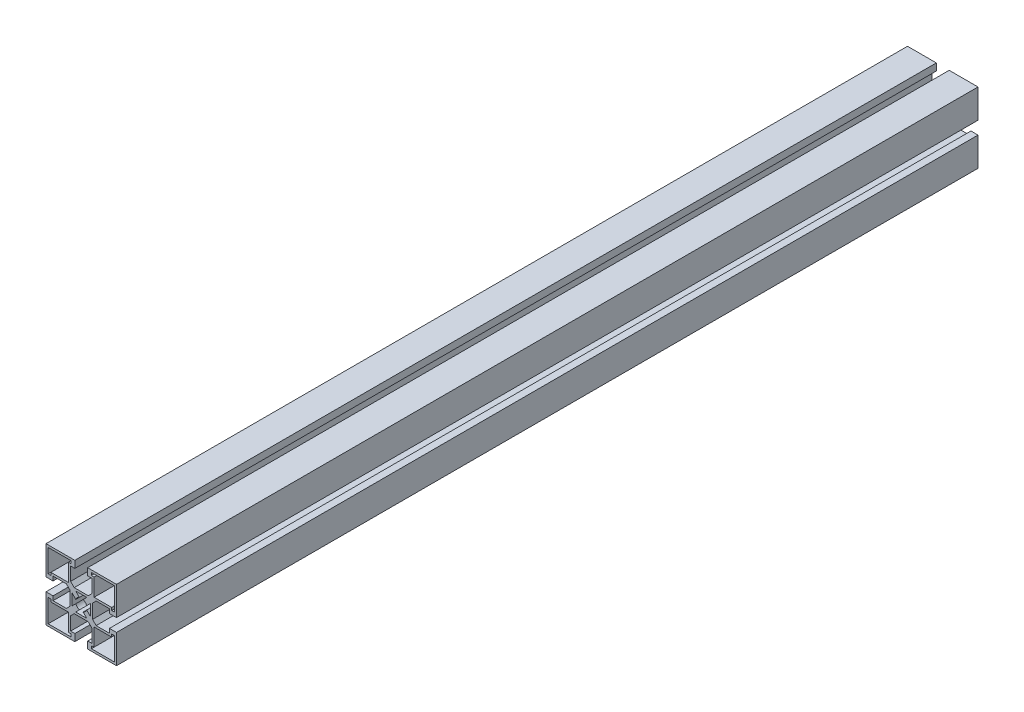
ISO-10303-21;
HEADER;
FILE_DESCRIPTION(('STEP AP214'),'2;1');
FILE_NAME('part.step','',(''),(''),'','','');
FILE_SCHEMA(('AUTOMOTIVE_DESIGN { 1 0 10303 214 1 1 1 1 }'));
ENDSEC;
DATA;
#1=APPLICATION_CONTEXT('core data for automotive mechanical design processes');
#2=APPLICATION_PROTOCOL_DEFINITION('international standard','automotive_design',2000,#1);
#3=PRODUCT_CONTEXT('',#1,'mechanical');
#4=PRODUCT('Part','Part','',(#3));
#5=PRODUCT_RELATED_PRODUCT_CATEGORY('part','',(#4));
#6=PRODUCT_DEFINITION_FORMATION('','',#4);
#7=PRODUCT_DEFINITION_CONTEXT('part definition',#1,'design');
#8=PRODUCT_DEFINITION('design','',#6,#7);
#9=PRODUCT_DEFINITION_SHAPE('','',#8);
#10=(LENGTH_UNIT() NAMED_UNIT(*) SI_UNIT(.MILLI.,.METRE.));
#11=(NAMED_UNIT(*) PLANE_ANGLE_UNIT() SI_UNIT($,.RADIAN.));
#12=(NAMED_UNIT(*) SI_UNIT($,.STERADIAN.) SOLID_ANGLE_UNIT());
#13=UNCERTAINTY_MEASURE_WITH_UNIT(LENGTH_MEASURE(1.E-05),#10,'distance_accuracy_value','');
#14=(GEOMETRIC_REPRESENTATION_CONTEXT(3) GLOBAL_UNCERTAINTY_ASSIGNED_CONTEXT((#13)) GLOBAL_UNIT_ASSIGNED_CONTEXT((#10,
#11,#12)) REPRESENTATION_CONTEXT('',''));
#15=CARTESIAN_POINT('',(0.,0.,0.));
#16=DIRECTION('',(0.,0.,1.));
#17=DIRECTION('',(1.,0.,0.));
#18=AXIS2_PLACEMENT_3D('',#15,#16,#17);
#19=CARTESIAN_POINT('',(-22.4999979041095,-22.5000076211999,550.));
#20=DIRECTION('',(0.,0.,1.));
#21=DIRECTION('',(1.,0.,0.));
#22=AXIS2_PLACEMENT_3D('',#19,#20,#21);
#23=PLANE('',#22);
#24=DIRECTION('',(1.,0.,0.));
#25=VECTOR('',#24,1.);
#26=CARTESIAN_POINT('',(21.0999944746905,-21.100009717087,550.));
#27=LINE('',#26,#25);
#28=CARTESIAN_POINT('',(6.49998990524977,-21.100009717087,550.));
#29=VERTEX_POINT('',#28);
#30=CARTESIAN_POINT('',(21.0999944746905,-21.100009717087,550.));
#31=VERTEX_POINT('',#30);
#32=EDGE_CURVE('E722',#29,#31,#27,.T.);
#33=ORIENTED_EDGE('',*,*,#32,.F.);
#34=DIRECTION('',(0.,-1.,0.));
#35=VECTOR('',#34,1.);
#36=CARTESIAN_POINT('',(6.49998990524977,-21.100009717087,550.));
#37=LINE('',#36,#35);
#38=CARTESIAN_POINT('',(6.49998990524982,-19.4000118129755,550.));
#39=VERTEX_POINT('',#38);
#40=EDGE_CURVE('E720',#39,#29,#37,.T.);
#41=ORIENTED_EDGE('',*,*,#40,.F.);
#42=DIRECTION('',(-1.,0.,0.));
#43=VECTOR('',#42,1.);
#44=CARTESIAN_POINT('',(6.49998990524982,-19.4000118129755,550.));
#45=LINE('',#44,#43);
#46=CARTESIAN_POINT('',(8.19998990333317,-19.4000118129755,550.));
#47=VERTEX_POINT('',#46);
#48=EDGE_CURVE('E736',#47,#39,#45,.T.);
#49=ORIENTED_EDGE('',*,*,#48,.F.);
#50=DIRECTION('',(0.,-1.,0.));
#51=VECTOR('',#50,1.);
#52=CARTESIAN_POINT('',(8.19998990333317,-19.4000118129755,550.));
#53=LINE('',#52,#51);
#54=CARTESIAN_POINT('',(8.19998990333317,-8.20000514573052,550.));
#55=VERTEX_POINT('',#54);
#56=EDGE_CURVE('E733',#55,#47,#53,.T.);
#57=ORIENTED_EDGE('',*,*,#56,.F.);
#58=DIRECTION('',(-1.,0.,0.));
#59=VECTOR('',#58,1.);
#60=CARTESIAN_POINT('',(8.19998990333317,-8.20000514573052,550.));
#61=LINE('',#60,#59);
#62=CARTESIAN_POINT('',(19.4000020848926,-8.20000514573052,550.));
#63=VERTEX_POINT('',#62);
#64=EDGE_CURVE('E731',#63,#55,#61,.T.);
#65=ORIENTED_EDGE('',*,*,#64,.F.);
#66=DIRECTION('',(-8.78865982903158E-07,-0.999999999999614,0.));
#67=VECTOR('',#66,1.);
#68=CARTESIAN_POINT('',(19.4000020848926,-8.20000514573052,550.));
#69=LINE('',#68,#67);
#70=CARTESIAN_POINT('',(19.400003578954,-6.50001745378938,550.));
#71=VERTEX_POINT('',#70);
#72=EDGE_CURVE('E729',#71,#63,#69,.T.);
#73=ORIENTED_EDGE('',*,*,#72,.F.);
#74=DIRECTION('',(-0.999999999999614,8.78865983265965E-07,0.));
#75=VECTOR('',#74,1.);
#76=CARTESIAN_POINT('',(19.400003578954,-6.50001745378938,550.));
#77=LINE('',#76,#75);
#78=CARTESIAN_POINT('',(21.0999944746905,-6.50001894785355,550.));
#79=VERTEX_POINT('',#78);
#80=EDGE_CURVE('E727',#79,#71,#77,.T.);
#81=ORIENTED_EDGE('',*,*,#80,.F.);
#82=DIRECTION('',(0.,1.,0.));
#83=VECTOR('',#82,1.);
#84=CARTESIAN_POINT('',(21.0999944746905,-6.50001894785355,550.));
#85=LINE('',#84,#83);
#86=EDGE_CURVE('E725',#31,#79,#85,.T.);
#87=ORIENTED_EDGE('',*,*,#86,.F.);
#88=EDGE_LOOP('',(#33,#41,#49,#57,#65,#73,#81,#87));
#89=FACE_BOUND('',#88,.T.);
#90=DIRECTION('',(1.,0.,0.));
#91=VECTOR('',#90,1.);
#92=CARTESIAN_POINT('',(-8.19998571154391,8.19998006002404,550.));
#93=LINE('',#92,#91);
#94=CARTESIAN_POINT('',(-19.3999978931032,8.19998006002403,550.));
#95=VERTEX_POINT('',#94);
#96=CARTESIAN_POINT('',(-8.19998571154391,8.19998006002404,550.));
#97=VERTEX_POINT('',#96);
#98=EDGE_CURVE('E840',#95,#97,#93,.T.);
#99=ORIENTED_EDGE('',*,*,#98,.F.);
#100=DIRECTION('',(0.,1.,0.));
#101=VECTOR('',#100,1.);
#102=CARTESIAN_POINT('',(-19.3999978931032,8.19998006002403,550.));
#103=LINE('',#102,#101);
#104=CARTESIAN_POINT('',(-19.3999978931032,6.49999236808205,550.));
#105=VERTEX_POINT('',#104);
#106=EDGE_CURVE('E838',#105,#95,#103,.T.);
#107=ORIENTED_EDGE('',*,*,#106,.F.);
#108=DIRECTION('',(1.,0.,0.));
#109=VECTOR('',#108,1.);
#110=CARTESIAN_POINT('',(-19.3999978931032,6.49999236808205,550.));
#111=LINE('',#110,#109);
#112=CARTESIAN_POINT('',(-21.0999902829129,6.49999236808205,550.));
#113=VERTEX_POINT('',#112);
#114=EDGE_CURVE('E854',#113,#105,#111,.T.);
#115=ORIENTED_EDGE('',*,*,#114,.F.);
#116=DIRECTION('',(0.,-1.,0.));
#117=VECTOR('',#116,1.);
#118=CARTESIAN_POINT('',(-21.0999902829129,6.49999236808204,550.));
#119=LINE('',#118,#117);
#120=CARTESIAN_POINT('',(-21.0999902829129,21.09999447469,550.));
#121=VERTEX_POINT('',#120);
#122=EDGE_CURVE('E851',#121,#113,#119,.T.);
#123=ORIENTED_EDGE('',*,*,#122,.F.);
#124=DIRECTION('',(-1.,0.,0.));
#125=VECTOR('',#124,1.);
#126=CARTESIAN_POINT('',(-21.0999902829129,21.09999447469,550.));
#127=LINE('',#126,#125);
#128=CARTESIAN_POINT('',(-6.49997437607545,21.09999447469,550.));
#129=VERTEX_POINT('',#128);
#130=EDGE_CURVE('E849',#129,#121,#127,.T.);
#131=ORIENTED_EDGE('',*,*,#130,.F.);
#132=DIRECTION('',(8.7886598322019E-07,0.999999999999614,0.));
#133=VECTOR('',#132,1.);
#134=CARTESIAN_POINT('',(-6.49997437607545,21.09999447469,550.));
#135=LINE('',#134,#133);
#136=CARTESIAN_POINT('',(-6.49997587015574,19.3999852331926,550.));
#137=VERTEX_POINT('',#136);
#138=EDGE_CURVE('E847',#137,#129,#135,.T.);
#139=ORIENTED_EDGE('',*,*,#138,.F.);
#140=DIRECTION('',(0.999999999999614,-8.78865982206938E-07,0.));
#141=VECTOR('',#140,1.);
#142=CARTESIAN_POINT('',(-6.49997587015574,19.3999852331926,550.));
#143=LINE('',#142,#141);
#144=CARTESIAN_POINT('',(-8.19997586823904,19.3999867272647,550.));
#145=VERTEX_POINT('',#144);
#146=EDGE_CURVE('E845',#145,#137,#143,.T.);
#147=ORIENTED_EDGE('',*,*,#146,.F.);
#148=DIRECTION('',(8.78865982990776E-07,0.999999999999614,0.));
#149=VECTOR('',#148,1.);
#150=CARTESIAN_POINT('',(-8.19997586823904,19.3999867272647,550.));
#151=LINE('',#150,#149);
#152=EDGE_CURVE('E843',#97,#145,#151,.T.);
#153=ORIENTED_EDGE('',*,*,#152,.F.);
#154=EDGE_LOOP('',(#99,#107,#115,#123,#131,#139,#147,#153));
#155=FACE_BOUND('',#154,.T.);
#156=DIRECTION('',(0.,-1.,0.));
#157=VECTOR('',#156,1.);
#158=CARTESIAN_POINT('',(-22.4999979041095,-4.10000762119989,550.));
#159=LINE('',#158,#157);
#160=CARTESIAN_POINT('',(-22.4999979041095,-4.10000762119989,550.));
#161=VERTEX_POINT('',#160);
#162=CARTESIAN_POINT('',(-22.4999979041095,-22.5000076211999,550.));
#163=VERTEX_POINT('',#162);
#164=EDGE_CURVE('E956',#161,#163,#159,.T.);
#165=ORIENTED_EDGE('',*,*,#164,.T.);
#166=DIRECTION('',(1.,0.,0.));
#167=VECTOR('',#166,1.);
#168=CARTESIAN_POINT('',(-22.4999979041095,-22.5000076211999,550.));
#169=LINE('',#168,#167);
#170=CARTESIAN_POINT('',(-4.0999979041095,-22.5000076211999,550.));
#171=VERTEX_POINT('',#170);
#172=EDGE_CURVE('E959',#163,#171,#169,.T.);
#173=ORIENTED_EDGE('',*,*,#172,.T.);
#174=DIRECTION('',(0.,1.,0.));
#175=VECTOR('',#174,1.);
#176=CARTESIAN_POINT('',(-4.0999979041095,-22.5000076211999,550.));
#177=LINE('',#176,#175);
#178=CARTESIAN_POINT('',(-4.09999790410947,-18.0000076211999,550.));
#179=VERTEX_POINT('',#178);
#180=EDGE_CURVE('E962',#171,#179,#177,.T.);
#181=ORIENTED_EDGE('',*,*,#180,.T.);
#182=DIRECTION('',(-1.,0.,0.));
#183=VECTOR('',#182,1.);
#184=CARTESIAN_POINT('',(-4.09999790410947,-18.0000076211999,550.));
#185=LINE('',#184,#183);
#186=CARTESIAN_POINT('',(-6.79999790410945,-18.0000076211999,550.));
#187=VERTEX_POINT('',#186);
#188=EDGE_CURVE('E964',#179,#187,#185,.T.);
#189=ORIENTED_EDGE('',*,*,#188,.T.);
#190=DIRECTION('',(0.,1.,0.));
#191=VECTOR('',#190,1.);
#192=CARTESIAN_POINT('',(-6.79999790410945,-18.0000076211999,550.));
#193=LINE('',#192,#191);
#194=CARTESIAN_POINT('',(-6.79999790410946,-9.50000762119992,550.));
#195=VERTEX_POINT('',#194);
#196=EDGE_CURVE('E966',#187,#195,#193,.T.);
#197=ORIENTED_EDGE('',*,*,#196,.T.);
#198=DIRECTION('',(0.707106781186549,0.707106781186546,0.));
#199=VECTOR('',#198,1.);
#200=CARTESIAN_POINT('',(-6.79999790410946,-9.50000762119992,550.));
#201=LINE('',#200,#199);
#202=CARTESIAN_POINT('',(-4.49999790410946,-7.20000762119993,550.));
#203=VERTEX_POINT('',#202);
#204=EDGE_CURVE('E968',#195,#203,#201,.T.);
#205=ORIENTED_EDGE('',*,*,#204,.T.);
#206=DIRECTION('',(1.,0.,0.));
#207=VECTOR('',#206,1.);
#208=CARTESIAN_POINT('',(-4.49999790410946,-7.20000762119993,550.));
#209=LINE('',#208,#207);
#210=CARTESIAN_POINT('',(4.50000209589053,-7.20000762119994,550.));
#211=VERTEX_POINT('',#210);
#212=EDGE_CURVE('E970',#203,#211,#209,.T.);
#213=ORIENTED_EDGE('',*,*,#212,.T.);
#214=DIRECTION('',(0.707106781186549,-0.707106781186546,0.));
#215=VECTOR('',#214,1.);
#216=CARTESIAN_POINT('',(4.50000209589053,-7.20000762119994,550.));
#217=LINE('',#216,#215);
#218=CARTESIAN_POINT('',(6.80000209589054,-9.50000762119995,550.));
#219=VERTEX_POINT('',#218);
#220=EDGE_CURVE('E972',#211,#219,#217,.T.);
#221=ORIENTED_EDGE('',*,*,#220,.T.);
#222=DIRECTION('',(0.,-1.,0.));
#223=VECTOR('',#222,1.);
#224=CARTESIAN_POINT('',(6.80000209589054,-9.50000762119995,550.));
#225=LINE('',#224,#223);
#226=CARTESIAN_POINT('',(6.80000209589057,-18.0000076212,550.));
#227=VERTEX_POINT('',#226);
#228=EDGE_CURVE('E974',#219,#227,#225,.T.);
#229=ORIENTED_EDGE('',*,*,#228,.T.);
#230=DIRECTION('',(-1.,0.,0.));
#231=VECTOR('',#230,1.);
#232=CARTESIAN_POINT('',(6.80000209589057,-18.0000076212,550.));
#233=LINE('',#232,#231);
#234=CARTESIAN_POINT('',(4.10000209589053,-18.0000076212,550.));
#235=VERTEX_POINT('',#234);
#236=EDGE_CURVE('E976',#227,#235,#233,.T.);
#237=ORIENTED_EDGE('',*,*,#236,.T.);
#238=DIRECTION('',(0.,-1.,0.));
#239=VECTOR('',#238,1.);
#240=CARTESIAN_POINT('',(4.10000209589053,-18.0000076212,550.));
#241=LINE('',#240,#239);
#242=CARTESIAN_POINT('',(4.10000209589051,-22.5000076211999,550.));
#243=VERTEX_POINT('',#242);
#244=EDGE_CURVE('E978',#235,#243,#241,.T.);
#245=ORIENTED_EDGE('',*,*,#244,.T.);
#246=DIRECTION('',(1.,0.,0.));
#247=VECTOR('',#246,1.);
#248=CARTESIAN_POINT('',(4.10000209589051,-22.5000076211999,550.));
#249=LINE('',#248,#247);
#250=CARTESIAN_POINT('',(22.5000020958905,-22.5000076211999,550.));
#251=VERTEX_POINT('',#250);
#252=EDGE_CURVE('E980',#243,#251,#249,.T.);
#253=ORIENTED_EDGE('',*,*,#252,.T.);
#254=DIRECTION('',(0.,1.,0.));
#255=VECTOR('',#254,1.);
#256=CARTESIAN_POINT('',(22.5000020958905,-22.5000076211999,550.));
#257=LINE('',#256,#255);
#258=CARTESIAN_POINT('',(22.5000020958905,-4.10000762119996,550.));
#259=VERTEX_POINT('',#258);
#260=EDGE_CURVE('E982',#251,#259,#257,.T.);
#261=ORIENTED_EDGE('',*,*,#260,.T.);
#262=DIRECTION('',(-1.,0.,0.));
#263=VECTOR('',#262,1.);
#264=CARTESIAN_POINT('',(22.5000020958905,-4.10000762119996,550.));
#265=LINE('',#264,#263);
#266=CARTESIAN_POINT('',(18.0000020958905,-4.10000762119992,550.));
#267=VERTEX_POINT('',#266);
#268=EDGE_CURVE('E984',#259,#267,#265,.T.);
#269=ORIENTED_EDGE('',*,*,#268,.T.);
#270=DIRECTION('',(0.,-1.,0.));
#271=VECTOR('',#270,1.);
#272=CARTESIAN_POINT('',(18.0000020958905,-4.10000762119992,550.));
#273=LINE('',#272,#271);
#274=CARTESIAN_POINT('',(18.0000020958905,-6.80000762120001,550.));
#275=VERTEX_POINT('',#274);
#276=EDGE_CURVE('E986',#267,#275,#273,.T.);
#277=ORIENTED_EDGE('',*,*,#276,.T.);
#278=DIRECTION('',(-1.,0.,0.));
#279=VECTOR('',#278,1.);
#280=CARTESIAN_POINT('',(18.0000020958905,-6.80000762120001,550.));
#281=LINE('',#280,#279);
#282=CARTESIAN_POINT('',(9.50000209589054,-6.80000762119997,550.));
#283=VERTEX_POINT('',#282);
#284=EDGE_CURVE('E988',#275,#283,#281,.T.);
#285=ORIENTED_EDGE('',*,*,#284,.T.);
#286=DIRECTION('',(-0.707106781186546,0.707106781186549,0.));
#287=VECTOR('',#286,1.);
#288=CARTESIAN_POINT('',(9.50000209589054,-6.80000762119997,550.));
#289=LINE('',#288,#287);
#290=CARTESIAN_POINT('',(7.20000209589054,-4.50000762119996,550.));
#291=VERTEX_POINT('',#290);
#292=EDGE_CURVE('E990',#283,#291,#289,.T.);
#293=ORIENTED_EDGE('',*,*,#292,.T.);
#294=DIRECTION('',(0.,1.,0.));
#295=VECTOR('',#294,1.);
#296=CARTESIAN_POINT('',(7.20000209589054,-4.50000762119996,550.));
#297=LINE('',#296,#295);
#298=CARTESIAN_POINT('',(7.20000209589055,4.49999237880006,550.));
#299=VERTEX_POINT('',#298);
#300=EDGE_CURVE('E992',#291,#299,#297,.T.);
#301=ORIENTED_EDGE('',*,*,#300,.T.);
#302=DIRECTION('',(0.70710678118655,0.707106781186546,0.));
#303=VECTOR('',#302,1.);
#304=CARTESIAN_POINT('',(7.20000209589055,4.49999237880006,550.));
#305=LINE('',#304,#303);
#306=CARTESIAN_POINT('',(9.50000209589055,6.79999237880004,550.));
#307=VERTEX_POINT('',#306);
#308=EDGE_CURVE('E994',#299,#307,#305,.T.);
#309=ORIENTED_EDGE('',*,*,#308,.T.);
#310=DIRECTION('',(1.,0.,0.));
#311=VECTOR('',#310,1.);
#312=CARTESIAN_POINT('',(9.50000209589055,6.79999237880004,550.));
#313=LINE('',#312,#311);
#314=CARTESIAN_POINT('',(18.0000020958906,6.79999237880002,550.));
#315=VERTEX_POINT('',#314);
#316=EDGE_CURVE('E996',#307,#315,#313,.T.);
#317=ORIENTED_EDGE('',*,*,#316,.T.);
#318=DIRECTION('',(0.,-1.,0.));
#319=VECTOR('',#318,1.);
#320=CARTESIAN_POINT('',(18.0000020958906,6.79999237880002,550.));
#321=LINE('',#320,#319);
#322=CARTESIAN_POINT('',(18.0000020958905,4.09999237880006,550.));
#323=VERTEX_POINT('',#322);
#324=EDGE_CURVE('E998',#315,#323,#321,.T.);
#325=ORIENTED_EDGE('',*,*,#324,.T.);
#326=DIRECTION('',(1.,0.,0.));
#327=VECTOR('',#326,1.);
#328=CARTESIAN_POINT('',(18.0000020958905,4.09999237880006,550.));
#329=LINE('',#328,#327);
#330=CARTESIAN_POINT('',(22.5000020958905,4.09999237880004,550.));
#331=VERTEX_POINT('',#330);
#332=EDGE_CURVE('E1000',#323,#331,#329,.T.);
#333=ORIENTED_EDGE('',*,*,#332,.T.);
#334=DIRECTION('',(0.,1.,0.));
#335=VECTOR('',#334,1.);
#336=CARTESIAN_POINT('',(22.5000020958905,4.09999237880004,550.));
#337=LINE('',#336,#335);
#338=CARTESIAN_POINT('',(22.5000020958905,22.4999923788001,550.));
#339=VERTEX_POINT('',#338);
#340=EDGE_CURVE('E1002',#331,#339,#337,.T.);
#341=ORIENTED_EDGE('',*,*,#340,.T.);
#342=DIRECTION('',(-1.,0.,0.));
#343=VECTOR('',#342,1.);
#344=CARTESIAN_POINT('',(22.5000020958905,22.4999923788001,550.));
#345=LINE('',#344,#343);
#346=CARTESIAN_POINT('',(4.10000209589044,22.4999923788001,550.));
#347=VERTEX_POINT('',#346);
#348=EDGE_CURVE('E1004',#339,#347,#345,.T.);
#349=ORIENTED_EDGE('',*,*,#348,.T.);
#350=DIRECTION('',(0.,-1.,0.));
#351=VECTOR('',#350,1.);
#352=CARTESIAN_POINT('',(4.10000209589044,22.4999923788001,550.));
#353=LINE('',#352,#351);
#354=CARTESIAN_POINT('',(4.10000209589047,17.9999923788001,550.));
#355=VERTEX_POINT('',#354);
#356=EDGE_CURVE('E1006',#347,#355,#353,.T.);
#357=ORIENTED_EDGE('',*,*,#356,.T.);
#358=DIRECTION('',(1.,0.,0.));
#359=VECTOR('',#358,1.);
#360=CARTESIAN_POINT('',(4.10000209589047,17.9999923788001,550.));
#361=LINE('',#360,#359);
#362=CARTESIAN_POINT('',(6.80000209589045,17.9999923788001,550.));
#363=VERTEX_POINT('',#362);
#364=EDGE_CURVE('E1008',#355,#363,#361,.T.);
#365=ORIENTED_EDGE('',*,*,#364,.T.);
#366=DIRECTION('',(0.,-1.,0.));
#367=VECTOR('',#366,1.);
#368=CARTESIAN_POINT('',(6.80000209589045,17.9999923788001,550.));
#369=LINE('',#368,#367);
#370=CARTESIAN_POINT('',(6.80000209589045,9.49999237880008,550.));
#371=VERTEX_POINT('',#370);
#372=EDGE_CURVE('E1010',#363,#371,#369,.T.);
#373=ORIENTED_EDGE('',*,*,#372,.T.);
#374=DIRECTION('',(-0.707106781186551,-0.707106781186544,0.));
#375=VECTOR('',#374,1.);
#376=CARTESIAN_POINT('',(6.80000209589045,9.49999237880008,550.));
#377=LINE('',#376,#375);
#378=CARTESIAN_POINT('',(4.50000209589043,7.19999237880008,550.));
#379=VERTEX_POINT('',#378);
#380=EDGE_CURVE('E1012',#371,#379,#377,.T.);
#381=ORIENTED_EDGE('',*,*,#380,.T.);
#382=DIRECTION('',(-1.,0.,0.));
#383=VECTOR('',#382,1.);
#384=CARTESIAN_POINT('',(4.50000209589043,7.19999237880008,550.));
#385=LINE('',#384,#383);
#386=CARTESIAN_POINT('',(-4.49999790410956,7.19999237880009,550.));
#387=VERTEX_POINT('',#386);
#388=EDGE_CURVE('E1014',#379,#387,#385,.T.);
#389=ORIENTED_EDGE('',*,*,#388,.T.);
#390=DIRECTION('',(-0.707106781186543,0.707106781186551,0.));
#391=VECTOR('',#390,1.);
#392=CARTESIAN_POINT('',(-4.49999790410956,7.19999237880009,550.));
#393=LINE('',#392,#391);
#394=CARTESIAN_POINT('',(-6.79999790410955,9.4999923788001,550.));
#395=VERTEX_POINT('',#394);
#396=EDGE_CURVE('E1016',#387,#395,#393,.T.);
#397=ORIENTED_EDGE('',*,*,#396,.T.);
#398=DIRECTION('',(0.,1.,0.));
#399=VECTOR('',#398,1.);
#400=CARTESIAN_POINT('',(-6.79999790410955,9.4999923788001,550.));
#401=LINE('',#400,#399);
#402=CARTESIAN_POINT('',(-6.79999790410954,17.9999923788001,550.));
#403=VERTEX_POINT('',#402);
#404=EDGE_CURVE('E1018',#395,#403,#401,.T.);
#405=ORIENTED_EDGE('',*,*,#404,.T.);
#406=DIRECTION('',(1.,0.,0.));
#407=VECTOR('',#406,1.);
#408=CARTESIAN_POINT('',(-6.79999790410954,17.9999923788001,550.));
#409=LINE('',#408,#407);
#410=CARTESIAN_POINT('',(-4.09999790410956,17.9999923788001,550.));
#411=VERTEX_POINT('',#410);
#412=EDGE_CURVE('E1020',#403,#411,#409,.T.);
#413=ORIENTED_EDGE('',*,*,#412,.T.);
#414=DIRECTION('',(0.,1.,0.));
#415=VECTOR('',#414,1.);
#416=CARTESIAN_POINT('',(-4.09999790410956,17.9999923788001,550.));
#417=LINE('',#416,#415);
#418=CARTESIAN_POINT('',(-4.09999790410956,22.4999923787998,550.));
#419=VERTEX_POINT('',#418);
#420=EDGE_CURVE('E1022',#411,#419,#417,.T.);
#421=ORIENTED_EDGE('',*,*,#420,.T.);
#422=DIRECTION('',(-1.,0.,0.));
#423=VECTOR('',#422,1.);
#424=CARTESIAN_POINT('',(-4.09999790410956,22.4999923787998,550.));
#425=LINE('',#424,#423);
#426=CARTESIAN_POINT('',(-22.4999979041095,22.4999923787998,550.));
#427=VERTEX_POINT('',#426);
#428=EDGE_CURVE('E1024',#419,#427,#425,.T.);
#429=ORIENTED_EDGE('',*,*,#428,.T.);
#430=DIRECTION('',(0.,-1.,0.));
#431=VECTOR('',#430,1.);
#432=CARTESIAN_POINT('',(-22.4999979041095,22.4999923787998,550.));
#433=LINE('',#432,#431);
#434=CARTESIAN_POINT('',(-22.4999979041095,4.09999237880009,550.));
#435=VERTEX_POINT('',#434);
#436=EDGE_CURVE('E1026',#427,#435,#433,.T.);
#437=ORIENTED_EDGE('',*,*,#436,.T.);
#438=DIRECTION('',(1.,0.,0.));
#439=VECTOR('',#438,1.);
#440=CARTESIAN_POINT('',(-22.4999979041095,4.09999237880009,550.));
#441=LINE('',#440,#439);
#442=CARTESIAN_POINT('',(-17.9999979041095,4.09999237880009,550.));
#443=VERTEX_POINT('',#442);
#444=EDGE_CURVE('E1028',#435,#443,#441,.T.);
#445=ORIENTED_EDGE('',*,*,#444,.T.);
#446=DIRECTION('',(0.,1.,0.));
#447=VECTOR('',#446,1.);
#448=CARTESIAN_POINT('',(-17.9999979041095,4.09999237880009,550.));
#449=LINE('',#448,#447);
#450=CARTESIAN_POINT('',(-17.9999979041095,6.79999237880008,550.));
#451=VERTEX_POINT('',#450);
#452=EDGE_CURVE('E1030',#443,#451,#449,.T.);
#453=ORIENTED_EDGE('',*,*,#452,.T.);
#454=DIRECTION('',(1.,0.,0.));
#455=VECTOR('',#454,1.);
#456=CARTESIAN_POINT('',(-17.9999979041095,6.79999237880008,550.));
#457=LINE('',#456,#455);
#458=CARTESIAN_POINT('',(-9.49999790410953,6.79999237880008,550.));
#459=VERTEX_POINT('',#458);
#460=EDGE_CURVE('E1032',#451,#459,#457,.T.);
#461=ORIENTED_EDGE('',*,*,#460,.T.);
#462=DIRECTION('',(0.707106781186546,-0.707106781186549,0.));
#463=VECTOR('',#462,1.);
#464=CARTESIAN_POINT('',(-9.49999790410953,6.79999237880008,550.));
#465=LINE('',#464,#463);
#466=CARTESIAN_POINT('',(-7.19999790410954,4.49999237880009,550.));
#467=VERTEX_POINT('',#466);
#468=EDGE_CURVE('E1034',#459,#467,#465,.T.);
#469=ORIENTED_EDGE('',*,*,#468,.T.);
#470=DIRECTION('',(0.,-1.,0.));
#471=VECTOR('',#470,1.);
#472=CARTESIAN_POINT('',(-7.19999790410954,4.49999237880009,550.));
#473=LINE('',#472,#471);
#474=CARTESIAN_POINT('',(-7.19999790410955,-4.5000076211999,550.));
#475=VERTEX_POINT('',#474);
#476=EDGE_CURVE('E1036',#467,#475,#473,.T.);
#477=ORIENTED_EDGE('',*,*,#476,.T.);
#478=DIRECTION('',(-0.70710678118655,-0.707106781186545,0.));
#479=VECTOR('',#478,1.);
#480=CARTESIAN_POINT('',(-7.19999790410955,-4.5000076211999,550.));
#481=LINE('',#480,#479);
#482=CARTESIAN_POINT('',(-9.49999790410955,-6.80000762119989,550.));
#483=VERTEX_POINT('',#482);
#484=EDGE_CURVE('E1038',#475,#483,#481,.T.);
#485=ORIENTED_EDGE('',*,*,#484,.T.);
#486=DIRECTION('',(-1.,0.,0.));
#487=VECTOR('',#486,1.);
#488=CARTESIAN_POINT('',(-9.49999790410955,-6.80000762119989,550.));
#489=LINE('',#488,#487);
#490=CARTESIAN_POINT('',(-17.9999979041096,-6.80000762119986,550.));
#491=VERTEX_POINT('',#490);
#492=EDGE_CURVE('E1040',#483,#491,#489,.T.);
#493=ORIENTED_EDGE('',*,*,#492,.T.);
#494=DIRECTION('',(0.,1.,0.));
#495=VECTOR('',#494,1.);
#496=CARTESIAN_POINT('',(-17.9999979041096,-6.80000762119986,550.));
#497=LINE('',#496,#495);
#498=CARTESIAN_POINT('',(-17.9999979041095,-4.10000762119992,550.));
#499=VERTEX_POINT('',#498);
#500=EDGE_CURVE('E1042',#491,#499,#497,.T.);
#501=ORIENTED_EDGE('',*,*,#500,.T.);
#502=DIRECTION('',(-1.,0.,0.));
#503=VECTOR('',#502,1.);
#504=CARTESIAN_POINT('',(-17.9999979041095,-4.10000762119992,550.));
#505=LINE('',#504,#503);
#506=EDGE_CURVE('E1044',#499,#161,#505,.T.);
#507=ORIENTED_EDGE('',*,*,#506,.T.);
#508=EDGE_LOOP('',(#165,#173,#181,#189,#197,#205,#213,#221,#229,#237,#245,#253,#261,#269,#277,
#285,#293,#301,#309,#317,#325,#333,#341,#349,#357,#365,#373,#381,#389,#397,#405,#413,#421,#429,
#437,#445,#453,#461,#469,#477,#485,#493,#501,#507));
#509=FACE_BOUND('',#508,.T.);
#510=DIRECTION('',(1.20056299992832E-06,-0.999999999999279,0.));
#511=VECTOR('',#510,1.);
#512=CARTESIAN_POINT('',(8.20000322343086,8.19998018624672,550.));
#513=LINE('',#512,#511);
#514=CARTESIAN_POINT('',(8.19998977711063,19.3999923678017,550.));
#515=VERTEX_POINT('',#514);
#516=CARTESIAN_POINT('',(8.20000322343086,8.19998018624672,550.));
#517=VERTEX_POINT('',#516);
#518=EDGE_CURVE('E899',#515,#517,#513,.T.);
#519=ORIENTED_EDGE('',*,*,#518,.F.);
#520=DIRECTION('',(1.,0.,0.));
#521=VECTOR('',#520,1.);
#522=CARTESIAN_POINT('',(8.19998977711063,19.3999923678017,550.));
#523=LINE('',#522,#521);
#524=CARTESIAN_POINT('',(6.50000208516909,19.3999923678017,550.));
#525=VERTEX_POINT('',#524);
#526=EDGE_CURVE('E897',#525,#515,#523,.T.);
#527=ORIENTED_EDGE('',*,*,#526,.F.);
#528=DIRECTION('',(0.,-1.,0.));
#529=VECTOR('',#528,1.);
#530=CARTESIAN_POINT('',(6.50000208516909,19.3999923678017,550.));
#531=LINE('',#530,#529);
#532=CARTESIAN_POINT('',(6.50000208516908,21.0999847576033,550.));
#533=VERTEX_POINT('',#532);
#534=EDGE_CURVE('E913',#533,#525,#531,.T.);
#535=ORIENTED_EDGE('',*,*,#534,.F.);
#536=DIRECTION('',(-1.,0.,0.));
#537=VECTOR('',#536,1.);
#538=CARTESIAN_POINT('',(6.50000208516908,21.0999847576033,550.));
#539=LINE('',#538,#537);
#540=CARTESIAN_POINT('',(21.1000041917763,21.0999847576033,550.));
#541=VERTEX_POINT('',#540);
#542=EDGE_CURVE('E910',#541,#533,#539,.T.);
#543=ORIENTED_EDGE('',*,*,#542,.F.);
#544=DIRECTION('',(0.,1.,0.));
#545=VECTOR('',#544,1.);
#546=CARTESIAN_POINT('',(21.1000041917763,21.0999847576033,550.));
#547=LINE('',#546,#545);
#548=CARTESIAN_POINT('',(21.1000041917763,6.49998018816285,550.));
#549=VERTEX_POINT('',#548);
#550=EDGE_CURVE('E908',#549,#541,#547,.T.);
#551=ORIENTED_EDGE('',*,*,#550,.F.);
#552=DIRECTION('',(1.,0.,0.));
#553=VECTOR('',#552,1.);
#554=CARTESIAN_POINT('',(21.1000041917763,6.49998018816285,550.));
#555=LINE('',#554,#553);
#556=CARTESIAN_POINT('',(19.4000098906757,6.49998018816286,550.));
#557=VERTEX_POINT('',#556);
#558=EDGE_CURVE('E906',#557,#549,#555,.T.);
#559=ORIENTED_EDGE('',*,*,#558,.F.);
#560=DIRECTION('',(0.,-1.,0.));
#561=VECTOR('',#560,1.);
#562=CARTESIAN_POINT('',(19.4000098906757,6.49998018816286,550.));
#563=LINE('',#562,#561);
#564=CARTESIAN_POINT('',(19.4000098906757,8.19998018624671,550.));
#565=VERTEX_POINT('',#564);
#566=EDGE_CURVE('E904',#565,#557,#563,.T.);
#567=ORIENTED_EDGE('',*,*,#566,.F.);
#568=DIRECTION('',(1.,0.,0.));
#569=VECTOR('',#568,1.);
#570=CARTESIAN_POINT('',(19.4000098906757,8.19998018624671,550.));
#571=LINE('',#570,#569);
#572=EDGE_CURVE('E902',#517,#565,#571,.T.);
#573=ORIENTED_EDGE('',*,*,#572,.F.);
#574=EDGE_LOOP('',(#519,#527,#535,#543,#551,#559,#567,#573));
#575=FACE_BOUND('',#574,.T.);
#576=DIRECTION('',(-0.999999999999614,8.78865981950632E-07,0.));
#577=VECTOR('',#576,1.);
#578=CARTESIAN_POINT('',(-8.19999542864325,-19.4000076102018,550.));
#579=LINE('',#578,#577);
#580=CARTESIAN_POINT('',(-6.49999789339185,-19.4000091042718,550.));
#581=VERTEX_POINT('',#580);
#582=CARTESIAN_POINT('',(-8.19999542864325,-19.4000076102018,550.));
#583=VERTEX_POINT('',#582);
#584=EDGE_CURVE('E781',#581,#583,#579,.T.);
#585=ORIENTED_EDGE('',*,*,#584,.F.);
#586=DIRECTION('',(0.,1.,0.));
#587=VECTOR('',#586,1.);
#588=CARTESIAN_POINT('',(-6.49999789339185,-19.4000091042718,550.));
#589=LINE('',#588,#587);
#590=CARTESIAN_POINT('',(-6.49999789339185,-21.1000000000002,550.));
#591=VERTEX_POINT('',#590);
#592=EDGE_CURVE('E779',#591,#581,#589,.T.);
#593=ORIENTED_EDGE('',*,*,#592,.F.);
#594=DIRECTION('',(1.,0.,0.));
#595=VECTOR('',#594,1.);
#596=CARTESIAN_POINT('',(-6.49999789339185,-21.1000000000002,550.));
#597=LINE('',#596,#595);
#598=CARTESIAN_POINT('',(-21.0999999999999,-21.1000000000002,550.));
#599=VERTEX_POINT('',#598);
#600=EDGE_CURVE('E795',#599,#591,#597,.T.);
#601=ORIENTED_EDGE('',*,*,#600,.F.);
#602=DIRECTION('',(0.,-1.,0.));
#603=VECTOR('',#602,1.);
#604=CARTESIAN_POINT('',(-21.0999999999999,-21.1000000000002,550.));
#605=LINE('',#604,#603);
#606=CARTESIAN_POINT('',(-21.0999999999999,-6.49999543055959,550.));
#607=VERTEX_POINT('',#606);
#608=EDGE_CURVE('E792',#607,#599,#605,.T.);
#609=ORIENTED_EDGE('',*,*,#608,.F.);
#610=DIRECTION('',(-1.,0.,0.));
#611=VECTOR('',#610,1.);
#612=CARTESIAN_POINT('',(-21.0999999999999,-6.49999543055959,550.));
#613=LINE('',#612,#611);
#614=CARTESIAN_POINT('',(-19.4000020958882,-6.49999543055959,550.));
#615=VERTEX_POINT('',#614);
#616=EDGE_CURVE('E790',#615,#607,#613,.T.);
#617=ORIENTED_EDGE('',*,*,#616,.F.);
#618=DIRECTION('',(0.,1.,0.));
#619=VECTOR('',#618,1.);
#620=CARTESIAN_POINT('',(-19.4000020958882,-6.49999543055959,550.));
#621=LINE('',#620,#619);
#622=CARTESIAN_POINT('',(-19.4000020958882,-8.19999542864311,550.));
#623=VERTEX_POINT('',#622);
#624=EDGE_CURVE('E788',#623,#615,#621,.T.);
#625=ORIENTED_EDGE('',*,*,#624,.F.);
#626=DIRECTION('',(-1.,0.,0.));
#627=VECTOR('',#626,1.);
#628=CARTESIAN_POINT('',(-19.4000020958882,-8.19999542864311,550.));
#629=LINE('',#628,#627);
#630=CARTESIAN_POINT('',(-8.19999542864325,-8.19999542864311,550.));
#631=VERTEX_POINT('',#630);
#632=EDGE_CURVE('E786',#631,#623,#629,.T.);
#633=ORIENTED_EDGE('',*,*,#632,.F.);
#634=DIRECTION('',(0.,1.,0.));
#635=VECTOR('',#634,1.);
#636=CARTESIAN_POINT('',(-8.19999542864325,-8.19999542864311,550.));
#637=LINE('',#636,#635);
#638=EDGE_CURVE('E784',#583,#631,#637,.T.);
#639=ORIENTED_EDGE('',*,*,#638,.F.);
#640=EDGE_LOOP('',(#585,#593,#601,#609,#617,#625,#633,#639));
#641=FACE_BOUND('',#640,.T.);
#642=DIRECTION('',(-0.707106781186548,0.707106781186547,0.));
#643=VECTOR('',#642,1.);
#644=CARTESIAN_POINT('',(-5.79999972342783,3.53726546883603,550.));
#645=LINE('',#644,#643);
#646=CARTESIAN_POINT('',(-3.45112108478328,1.18838683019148,550.));
#647=VERTEX_POINT('',#646);
#648=CARTESIAN_POINT('',(-5.79999972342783,3.53726546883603,550.));
#649=VERTEX_POINT('',#648);
#650=EDGE_CURVE('E607',#647,#649,#645,.T.);
#651=ORIENTED_EDGE('',*,*,#650,.F.);
#652=CARTESIAN_POINT('',(9.97812838E-13,6.9153024E-13,550.));
#653=DIRECTION('',(0.,0.,1.));
#654=DIRECTION('',(1.,0.,0.));
#655=AXIS2_PLACEMENT_3D('',#652,#653,#654);
#656=CIRCLE('',#655,3.65000000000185);
#657=CARTESIAN_POINT('',(-1.18839399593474,3.45111861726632,550.));
#658=VERTEX_POINT('',#657);
#659=EDGE_CURVE('E599',#658,#647,#656,.T.);
#660=ORIENTED_EDGE('',*,*,#659,.F.);
#661=DIRECTION('',(0.707108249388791,-0.707105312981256,0.));
#662=VECTOR('',#661,1.);
#663=CARTESIAN_POINT('',(-1.18839399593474,3.45111861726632,550.));
#664=LINE('',#663,#662);
#665=CARTESIAN_POINT('',(-3.53727751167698,5.79999237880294,550.));
#666=VERTEX_POINT('',#665);
#667=EDGE_CURVE('E648',#666,#658,#664,.T.);
#668=ORIENTED_EDGE('',*,*,#667,.F.);
#669=DIRECTION('',(-1.,0.,0.));
#670=VECTOR('',#669,1.);
#671=CARTESIAN_POINT('',(-3.53727751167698,5.79999237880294,550.));
#672=LINE('',#671,#670);
#673=CARTESIAN_POINT('',(3.53727751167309,5.79999237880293,550.));
#674=VERTEX_POINT('',#673);
#675=EDGE_CURVE('E646',#674,#666,#672,.T.);
#676=ORIENTED_EDGE('',*,*,#675,.F.);
#677=DIRECTION('',(0.707108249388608,0.707105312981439,0.));
#678=VECTOR('',#677,1.);
#679=CARTESIAN_POINT('',(3.53727751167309,5.79999237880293,550.));
#680=LINE('',#679,#678);
#681=CARTESIAN_POINT('',(1.18839399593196,3.4511186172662,550.));
#682=VERTEX_POINT('',#681);
#683=EDGE_CURVE('E644',#682,#674,#680,.T.);
#684=ORIENTED_EDGE('',*,*,#683,.F.);
#685=CARTESIAN_POINT('',(9.97812838E-13,6.9153024E-13,550.));
#686=DIRECTION('',(0.,0.,1.));
#687=DIRECTION('',(1.,0.,0.));
#688=AXIS2_PLACEMENT_3D('',#685,#686,#687);
#689=CIRCLE('',#688,3.65000000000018);
#690=CARTESIAN_POINT('',(3.45112108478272,1.18838683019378,550.));
#691=VERTEX_POINT('',#690);
#692=EDGE_CURVE('E642',#691,#682,#689,.T.);
#693=ORIENTED_EDGE('',*,*,#692,.F.);
#694=DIRECTION('',(-0.707106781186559,-0.707106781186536,0.));
#695=VECTOR('',#694,1.);
#696=CARTESIAN_POINT('',(3.45112108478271,1.18838683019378,550.));
#697=LINE('',#696,#695);
#698=CARTESIAN_POINT('',(5.79999972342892,3.5372654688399,550.));
#699=VERTEX_POINT('',#698);
#700=EDGE_CURVE('E640',#699,#691,#697,.T.);
#701=ORIENTED_EDGE('',*,*,#700,.F.);
#702=DIRECTION('',(2.07635335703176E-06,0.999999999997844,0.));
#703=VECTOR('',#702,1.);
#704=CARTESIAN_POINT('',(5.79999972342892,3.5372654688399,550.));
#705=LINE('',#704,#703);
#706=CARTESIAN_POINT('',(5.79998503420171,-3.537266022,550.));
#707=VERTEX_POINT('',#706);
#708=EDGE_CURVE('E638',#707,#699,#705,.T.);
#709=ORIENTED_EDGE('',*,*,#708,.F.);
#710=DIRECTION('',(0.707106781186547,-0.707106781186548,0.));
#711=VECTOR('',#710,1.);
#712=CARTESIAN_POINT('',(5.79998503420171,-3.537266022,550.));
#713=LINE('',#712,#711);
#714=CARTESIAN_POINT('',(3.45111718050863,-1.18839816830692,550.));
#715=VERTEX_POINT('',#714);
#716=EDGE_CURVE('E636',#715,#707,#713,.T.);
#717=ORIENTED_EDGE('',*,*,#716,.F.);
#718=CARTESIAN_POINT('',(9.97812838E-13,6.9153024E-13,550.));
#719=DIRECTION('',(0.,0.,1.));
#720=DIRECTION('',(1.,0.,0.));
#721=AXIS2_PLACEMENT_3D('',#718,#719,#720);
#722=CIRCLE('',#721,3.65000000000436);
#723=CARTESIAN_POINT('',(1.18839399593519,-3.45111861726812,550.));
#724=VERTEX_POINT('',#723);
#725=EDGE_CURVE('E634',#724,#715,#722,.T.);
#726=ORIENTED_EDGE('',*,*,#725,.F.);
#727=DIRECTION('',(-0.707108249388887,0.70710531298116,0.));
#728=VECTOR('',#727,1.);
#729=CARTESIAN_POINT('',(1.18839399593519,-3.45111861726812,550.));
#730=LINE('',#729,#728);
#731=CARTESIAN_POINT('',(3.53727751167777,-5.79999237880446,550.));
#732=VERTEX_POINT('',#731);
#733=EDGE_CURVE('E632',#732,#724,#730,.T.);
#734=ORIENTED_EDGE('',*,*,#733,.F.);
#735=DIRECTION('',(1.,0.,0.));
#736=VECTOR('',#735,1.);
#737=CARTESIAN_POINT('',(3.53727751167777,-5.79999237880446,550.));
#738=LINE('',#737,#736);
#739=CARTESIAN_POINT('',(-3.53727751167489,-5.79999237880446,550.));
#740=VERTEX_POINT('',#739);
#741=EDGE_CURVE('E630',#740,#732,#738,.T.);
#742=ORIENTED_EDGE('',*,*,#741,.F.);
#743=DIRECTION('',(-0.707108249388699,-0.707105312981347,0.));
#744=VECTOR('',#743,1.);
#745=CARTESIAN_POINT('',(-3.53727751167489,-5.79999237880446,550.));
#746=LINE('',#745,#744);
#747=CARTESIAN_POINT('',(-1.18839399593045,-3.45111861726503,550.));
#748=VERTEX_POINT('',#747);
#749=EDGE_CURVE('E628',#748,#740,#746,.T.);
#750=ORIENTED_EDGE('',*,*,#749,.F.);
#751=CARTESIAN_POINT('',(9.97812838E-13,6.9153024E-13,550.));
#752=DIRECTION('',(0.,0.,1.));
#753=DIRECTION('',(1.,0.,0.));
#754=AXIS2_PLACEMENT_3D('',#751,#752,#753);
#755=CIRCLE('',#754,3.65000000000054);
#756=CARTESIAN_POINT('',(-3.45111718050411,-1.18839816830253,550.));
#757=VERTEX_POINT('',#756);
#758=EDGE_CURVE('E626',#757,#748,#755,.T.);
#759=ORIENTED_EDGE('',*,*,#758,.F.);
#760=DIRECTION('',(0.707106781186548,0.707106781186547,0.));
#761=VECTOR('',#760,1.);
#762=CARTESIAN_POINT('',(-3.45111718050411,-1.18839816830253,550.));
#763=LINE('',#762,#761);
#764=CARTESIAN_POINT('',(-5.79998503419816,-3.53726602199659,550.));
#765=VERTEX_POINT('',#764);
#766=EDGE_CURVE('E622',#765,#757,#763,.T.);
#767=ORIENTED_EDGE('',*,*,#766,.F.);
#768=DIRECTION('',(2.0763537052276E-06,-0.999999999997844,0.));
#769=VECTOR('',#768,1.);
#770=CARTESIAN_POINT('',(-5.79998503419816,-3.53726602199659,550.));
#771=LINE('',#770,#769);
#772=EDGE_CURVE('E620',#649,#765,#771,.T.);
#773=ORIENTED_EDGE('',*,*,#772,.F.);
#774=EDGE_LOOP('',(#651,#660,#668,#676,#684,#693,#701,#709,#717,#726,#734,#742,#750,#759,#767,#773));
#775=FACE_BOUND('',#774,.T.);
#776=ADVANCED_FACE('F30',(#89,#155,#509,#575,#641,#775),#23,.T.);
#777=CARTESIAN_POINT('',(-22.4999979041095,-22.5000076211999,0.));
#778=DIRECTION('',(0.,0.,1.));
#779=DIRECTION('',(1.,0.,0.));
#780=AXIS2_PLACEMENT_3D('',#777,#778,#779);
#781=PLANE('',#780);
#782=DIRECTION('',(0.,-1.,0.));
#783=VECTOR('',#782,1.);
#784=CARTESIAN_POINT('',(6.49998990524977,-21.100009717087,0.));
#785=LINE('',#784,#783);
#786=CARTESIAN_POINT('',(6.49998990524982,-19.4000118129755,0.));
#787=VERTEX_POINT('',#786);
#788=CARTESIAN_POINT('',(6.49998990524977,-21.100009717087,0.));
#789=VERTEX_POINT('',#788);
#790=EDGE_CURVE('E615',#787,#789,#785,.T.);
#791=ORIENTED_EDGE('',*,*,#790,.T.);
#792=DIRECTION('',(1.,0.,0.));
#793=VECTOR('',#792,1.);
#794=CARTESIAN_POINT('',(21.0999944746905,-21.100009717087,0.));
#795=LINE('',#794,#793);
#796=CARTESIAN_POINT('',(21.0999944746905,-21.100009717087,0.));
#797=VERTEX_POINT('',#796);
#798=EDGE_CURVE('E741',#789,#797,#795,.T.);
#799=ORIENTED_EDGE('',*,*,#798,.T.);
#800=DIRECTION('',(0.,1.,0.));
#801=VECTOR('',#800,1.);
#802=CARTESIAN_POINT('',(21.0999944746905,-6.50001894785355,0.));
#803=LINE('',#802,#801);
#804=CARTESIAN_POINT('',(21.0999944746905,-6.50001894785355,0.));
#805=VERTEX_POINT('',#804);
#806=EDGE_CURVE('E744',#797,#805,#803,.T.);
#807=ORIENTED_EDGE('',*,*,#806,.T.);
#808=DIRECTION('',(-0.999999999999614,8.78865983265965E-07,0.));
#809=VECTOR('',#808,1.);
#810=CARTESIAN_POINT('',(19.400003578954,-6.50001745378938,0.));
#811=LINE('',#810,#809);
#812=CARTESIAN_POINT('',(19.400003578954,-6.50001745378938,0.));
#813=VERTEX_POINT('',#812);
#814=EDGE_CURVE('E747',#805,#813,#811,.T.);
#815=ORIENTED_EDGE('',*,*,#814,.T.);
#816=DIRECTION('',(-8.78865982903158E-07,-0.999999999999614,0.));
#817=VECTOR('',#816,1.);
#818=CARTESIAN_POINT('',(19.4000020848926,-8.20000514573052,0.));
#819=LINE('',#818,#817);
#820=CARTESIAN_POINT('',(19.4000020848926,-8.20000514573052,0.));
#821=VERTEX_POINT('',#820);
#822=EDGE_CURVE('E750',#813,#821,#819,.T.);
#823=ORIENTED_EDGE('',*,*,#822,.T.);
#824=DIRECTION('',(-1.,0.,0.));
#825=VECTOR('',#824,1.);
#826=CARTESIAN_POINT('',(8.19998990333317,-8.20000514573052,0.));
#827=LINE('',#826,#825);
#828=CARTESIAN_POINT('',(8.19998990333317,-8.20000514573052,0.));
#829=VERTEX_POINT('',#828);
#830=EDGE_CURVE('E753',#821,#829,#827,.T.);
#831=ORIENTED_EDGE('',*,*,#830,.T.);
#832=DIRECTION('',(0.,-1.,0.));
#833=VECTOR('',#832,1.);
#834=CARTESIAN_POINT('',(8.19998990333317,-19.4000118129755,0.));
#835=LINE('',#834,#833);
#836=CARTESIAN_POINT('',(8.19998990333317,-19.4000118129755,0.));
#837=VERTEX_POINT('',#836);
#838=EDGE_CURVE('E756',#829,#837,#835,.T.);
#839=ORIENTED_EDGE('',*,*,#838,.T.);
#840=DIRECTION('',(-1.,0.,0.));
#841=VECTOR('',#840,1.);
#842=CARTESIAN_POINT('',(6.49998990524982,-19.4000118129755,0.));
#843=LINE('',#842,#841);
#844=EDGE_CURVE('E723',#837,#787,#843,.T.);
#845=ORIENTED_EDGE('',*,*,#844,.T.);
#846=EDGE_LOOP('',(#791,#799,#807,#815,#823,#831,#839,#845));
#847=FACE_BOUND('',#846,.T.);
#848=DIRECTION('',(0.,1.,0.));
#849=VECTOR('',#848,1.);
#850=CARTESIAN_POINT('',(-19.3999978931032,8.19998006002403,0.));
#851=LINE('',#850,#849);
#852=CARTESIAN_POINT('',(-19.3999978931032,6.49999236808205,0.));
#853=VERTEX_POINT('',#852);
#854=CARTESIAN_POINT('',(-19.3999978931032,8.19998006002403,0.));
#855=VERTEX_POINT('',#854);
#856=EDGE_CURVE('E837',#853,#855,#851,.T.);
#857=ORIENTED_EDGE('',*,*,#856,.T.);
#858=DIRECTION('',(1.,0.,0.));
#859=VECTOR('',#858,1.);
#860=CARTESIAN_POINT('',(-8.19998571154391,8.19998006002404,0.));
#861=LINE('',#860,#859);
#862=CARTESIAN_POINT('',(-8.19998571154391,8.19998006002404,0.));
#863=VERTEX_POINT('',#862);
#864=EDGE_CURVE('E859',#855,#863,#861,.T.);
#865=ORIENTED_EDGE('',*,*,#864,.T.);
#866=DIRECTION('',(8.78865982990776E-07,0.999999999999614,0.));
#867=VECTOR('',#866,1.);
#868=CARTESIAN_POINT('',(-8.19997586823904,19.3999867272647,0.));
#869=LINE('',#868,#867);
#870=CARTESIAN_POINT('',(-8.19997586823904,19.3999867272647,0.));
#871=VERTEX_POINT('',#870);
#872=EDGE_CURVE('E862',#863,#871,#869,.T.);
#873=ORIENTED_EDGE('',*,*,#872,.T.);
#874=DIRECTION('',(0.999999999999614,-8.78865982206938E-07,0.));
#875=VECTOR('',#874,1.);
#876=CARTESIAN_POINT('',(-6.49997587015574,19.3999852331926,0.));
#877=LINE('',#876,#875);
#878=CARTESIAN_POINT('',(-6.49997587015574,19.3999852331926,0.));
#879=VERTEX_POINT('',#878);
#880=EDGE_CURVE('E865',#871,#879,#877,.T.);
#881=ORIENTED_EDGE('',*,*,#880,.T.);
#882=DIRECTION('',(8.7886598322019E-07,0.999999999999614,0.));
#883=VECTOR('',#882,1.);
#884=CARTESIAN_POINT('',(-6.49997437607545,21.09999447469,0.));
#885=LINE('',#884,#883);
#886=CARTESIAN_POINT('',(-6.49997437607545,21.09999447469,0.));
#887=VERTEX_POINT('',#886);
#888=EDGE_CURVE('E868',#879,#887,#885,.T.);
#889=ORIENTED_EDGE('',*,*,#888,.T.);
#890=DIRECTION('',(-1.,0.,0.));
#891=VECTOR('',#890,1.);
#892=CARTESIAN_POINT('',(-21.0999902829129,21.09999447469,0.));
#893=LINE('',#892,#891);
#894=CARTESIAN_POINT('',(-21.0999902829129,21.09999447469,0.));
#895=VERTEX_POINT('',#894);
#896=EDGE_CURVE('E871',#887,#895,#893,.T.);
#897=ORIENTED_EDGE('',*,*,#896,.T.);
#898=DIRECTION('',(0.,-1.,0.));
#899=VECTOR('',#898,1.);
#900=CARTESIAN_POINT('',(-21.0999902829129,6.49999236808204,0.));
#901=LINE('',#900,#899);
#902=CARTESIAN_POINT('',(-21.0999902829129,6.49999236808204,0.));
#903=VERTEX_POINT('',#902);
#904=EDGE_CURVE('E874',#895,#903,#901,.T.);
#905=ORIENTED_EDGE('',*,*,#904,.T.);
#906=DIRECTION('',(1.,0.,0.));
#907=VECTOR('',#906,1.);
#908=CARTESIAN_POINT('',(-19.3999978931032,6.49999236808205,0.));
#909=LINE('',#908,#907);
#910=EDGE_CURVE('E841',#903,#853,#909,.T.);
#911=ORIENTED_EDGE('',*,*,#910,.T.);
#912=EDGE_LOOP('',(#857,#865,#873,#881,#889,#897,#905,#911));
#913=FACE_BOUND('',#912,.T.);
#914=DIRECTION('',(0.,-1.,0.));
#915=VECTOR('',#914,1.);
#916=CARTESIAN_POINT('',(-22.4999979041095,-4.10000762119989,0.));
#917=LINE('',#916,#915);
#918=CARTESIAN_POINT('',(-22.4999979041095,-4.10000762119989,0.));
#919=VERTEX_POINT('',#918);
#920=CARTESIAN_POINT('',(-22.4999979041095,-22.5000076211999,0.));
#921=VERTEX_POINT('',#920);
#922=EDGE_CURVE('E955',#919,#921,#917,.T.);
#923=ORIENTED_EDGE('',*,*,#922,.F.);
#924=DIRECTION('',(-1.,0.,0.));
#925=VECTOR('',#924,1.);
#926=CARTESIAN_POINT('',(-17.9999979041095,-4.10000762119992,0.));
#927=LINE('',#926,#925);
#928=CARTESIAN_POINT('',(-17.9999979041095,-4.10000762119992,0.));
#929=VERTEX_POINT('',#928);
#930=EDGE_CURVE('E960',#929,#919,#927,.T.);
#931=ORIENTED_EDGE('',*,*,#930,.F.);
#932=DIRECTION('',(0.,1.,0.));
#933=VECTOR('',#932,1.);
#934=CARTESIAN_POINT('',(-17.9999979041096,-6.80000762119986,0.));
#935=LINE('',#934,#933);
#936=CARTESIAN_POINT('',(-17.9999979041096,-6.80000762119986,0.));
#937=VERTEX_POINT('',#936);
#938=EDGE_CURVE('E1131',#937,#929,#935,.T.);
#939=ORIENTED_EDGE('',*,*,#938,.F.);
#940=DIRECTION('',(-1.,0.,0.));
#941=VECTOR('',#940,1.);
#942=CARTESIAN_POINT('',(-9.49999790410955,-6.80000762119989,0.));
#943=LINE('',#942,#941);
#944=CARTESIAN_POINT('',(-9.49999790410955,-6.80000762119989,0.));
#945=VERTEX_POINT('',#944);
#946=EDGE_CURVE('E1129',#945,#937,#943,.T.);
#947=ORIENTED_EDGE('',*,*,#946,.F.);
#948=DIRECTION('',(-0.70710678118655,-0.707106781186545,0.));
#949=VECTOR('',#948,1.);
#950=CARTESIAN_POINT('',(-7.19999790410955,-4.5000076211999,0.));
#951=LINE('',#950,#949);
#952=CARTESIAN_POINT('',(-7.19999790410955,-4.5000076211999,0.));
#953=VERTEX_POINT('',#952);
#954=EDGE_CURVE('E1127',#953,#945,#951,.T.);
#955=ORIENTED_EDGE('',*,*,#954,.F.);
#956=DIRECTION('',(0.,-1.,0.));
#957=VECTOR('',#956,1.);
#958=CARTESIAN_POINT('',(-7.19999790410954,4.49999237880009,0.));
#959=LINE('',#958,#957);
#960=CARTESIAN_POINT('',(-7.19999790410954,4.49999237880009,0.));
#961=VERTEX_POINT('',#960);
#962=EDGE_CURVE('E1125',#961,#953,#959,.T.);
#963=ORIENTED_EDGE('',*,*,#962,.F.);
#964=DIRECTION('',(0.707106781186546,-0.707106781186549,0.));
#965=VECTOR('',#964,1.);
#966=CARTESIAN_POINT('',(-9.49999790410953,6.79999237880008,0.));
#967=LINE('',#966,#965);
#968=CARTESIAN_POINT('',(-9.49999790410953,6.79999237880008,0.));
#969=VERTEX_POINT('',#968);
#970=EDGE_CURVE('E1123',#969,#961,#967,.T.);
#971=ORIENTED_EDGE('',*,*,#970,.F.);
#972=DIRECTION('',(1.,0.,0.));
#973=VECTOR('',#972,1.);
#974=CARTESIAN_POINT('',(-17.9999979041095,6.79999237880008,0.));
#975=LINE('',#974,#973);
#976=CARTESIAN_POINT('',(-17.9999979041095,6.79999237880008,0.));
#977=VERTEX_POINT('',#976);
#978=EDGE_CURVE('E1121',#977,#969,#975,.T.);
#979=ORIENTED_EDGE('',*,*,#978,.F.);
#980=DIRECTION('',(0.,1.,0.));
#981=VECTOR('',#980,1.);
#982=CARTESIAN_POINT('',(-17.9999979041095,4.09999237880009,0.));
#983=LINE('',#982,#981);
#984=CARTESIAN_POINT('',(-17.9999979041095,4.09999237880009,0.));
#985=VERTEX_POINT('',#984);
#986=EDGE_CURVE('E1119',#985,#977,#983,.T.);
#987=ORIENTED_EDGE('',*,*,#986,.F.);
#988=DIRECTION('',(1.,0.,0.));
#989=VECTOR('',#988,1.);
#990=CARTESIAN_POINT('',(-22.4999979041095,4.09999237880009,0.));
#991=LINE('',#990,#989);
#992=CARTESIAN_POINT('',(-22.4999979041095,4.09999237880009,0.));
#993=VERTEX_POINT('',#992);
#994=EDGE_CURVE('E1117',#993,#985,#991,.T.);
#995=ORIENTED_EDGE('',*,*,#994,.F.);
#996=DIRECTION('',(0.,-1.,0.));
#997=VECTOR('',#996,1.);
#998=CARTESIAN_POINT('',(-22.4999979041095,22.4999923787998,0.));
#999=LINE('',#998,#997);
#1000=CARTESIAN_POINT('',(-22.4999979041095,22.4999923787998,0.));
#1001=VERTEX_POINT('',#1000);
#1002=EDGE_CURVE('E1115',#1001,#993,#999,.T.);
#1003=ORIENTED_EDGE('',*,*,#1002,.F.);
#1004=DIRECTION('',(-1.,0.,0.));
#1005=VECTOR('',#1004,1.);
#1006=CARTESIAN_POINT('',(-4.09999790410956,22.4999923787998,0.));
#1007=LINE('',#1006,#1005);
#1008=CARTESIAN_POINT('',(-4.09999790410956,22.4999923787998,0.));
#1009=VERTEX_POINT('',#1008);
#1010=EDGE_CURVE('E1113',#1009,#1001,#1007,.T.);
#1011=ORIENTED_EDGE('',*,*,#1010,.F.);
#1012=DIRECTION('',(0.,1.,0.));
#1013=VECTOR('',#1012,1.);
#1014=CARTESIAN_POINT('',(-4.09999790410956,17.9999923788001,0.));
#1015=LINE('',#1014,#1013);
#1016=CARTESIAN_POINT('',(-4.09999790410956,17.9999923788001,0.));
#1017=VERTEX_POINT('',#1016);
#1018=EDGE_CURVE('E1111',#1017,#1009,#1015,.T.);
#1019=ORIENTED_EDGE('',*,*,#1018,.F.);
#1020=DIRECTION('',(1.,0.,0.));
#1021=VECTOR('',#1020,1.);
#1022=CARTESIAN_POINT('',(-6.79999790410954,17.9999923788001,0.));
#1023=LINE('',#1022,#1021);
#1024=CARTESIAN_POINT('',(-6.79999790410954,17.9999923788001,0.));
#1025=VERTEX_POINT('',#1024);
#1026=EDGE_CURVE('E1109',#1025,#1017,#1023,.T.);
#1027=ORIENTED_EDGE('',*,*,#1026,.F.);
#1028=DIRECTION('',(0.,1.,0.));
#1029=VECTOR('',#1028,1.);
#1030=CARTESIAN_POINT('',(-6.79999790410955,9.4999923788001,0.));
#1031=LINE('',#1030,#1029);
#1032=CARTESIAN_POINT('',(-6.79999790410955,9.4999923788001,0.));
#1033=VERTEX_POINT('',#1032);
#1034=EDGE_CURVE('E1107',#1033,#1025,#1031,.T.);
#1035=ORIENTED_EDGE('',*,*,#1034,.F.);
#1036=DIRECTION('',(-0.707106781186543,0.707106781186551,0.));
#1037=VECTOR('',#1036,1.);
#1038=CARTESIAN_POINT('',(-4.49999790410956,7.19999237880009,0.));
#1039=LINE('',#1038,#1037);
#1040=CARTESIAN_POINT('',(-4.49999790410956,7.19999237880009,0.));
#1041=VERTEX_POINT('',#1040);
#1042=EDGE_CURVE('E1105',#1041,#1033,#1039,.T.);
#1043=ORIENTED_EDGE('',*,*,#1042,.F.);
#1044=DIRECTION('',(-1.,0.,0.));
#1045=VECTOR('',#1044,1.);
#1046=CARTESIAN_POINT('',(4.50000209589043,7.19999237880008,0.));
#1047=LINE('',#1046,#1045);
#1048=CARTESIAN_POINT('',(4.50000209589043,7.19999237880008,0.));
#1049=VERTEX_POINT('',#1048);
#1050=EDGE_CURVE('E1103',#1049,#1041,#1047,.T.);
#1051=ORIENTED_EDGE('',*,*,#1050,.F.);
#1052=DIRECTION('',(-0.707106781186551,-0.707106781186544,0.));
#1053=VECTOR('',#1052,1.);
#1054=CARTESIAN_POINT('',(6.80000209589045,9.49999237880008,0.));
#1055=LINE('',#1054,#1053);
#1056=CARTESIAN_POINT('',(6.80000209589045,9.49999237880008,0.));
#1057=VERTEX_POINT('',#1056);
#1058=EDGE_CURVE('E1101',#1057,#1049,#1055,.T.);
#1059=ORIENTED_EDGE('',*,*,#1058,.F.);
#1060=DIRECTION('',(0.,-1.,0.));
#1061=VECTOR('',#1060,1.);
#1062=CARTESIAN_POINT('',(6.80000209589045,17.9999923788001,0.));
#1063=LINE('',#1062,#1061);
#1064=CARTESIAN_POINT('',(6.80000209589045,17.9999923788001,0.));
#1065=VERTEX_POINT('',#1064);
#1066=EDGE_CURVE('E1099',#1065,#1057,#1063,.T.);
#1067=ORIENTED_EDGE('',*,*,#1066,.F.);
#1068=DIRECTION('',(1.,0.,0.));
#1069=VECTOR('',#1068,1.);
#1070=CARTESIAN_POINT('',(4.10000209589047,17.9999923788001,0.));
#1071=LINE('',#1070,#1069);
#1072=CARTESIAN_POINT('',(4.10000209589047,17.9999923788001,0.));
#1073=VERTEX_POINT('',#1072);
#1074=EDGE_CURVE('E1097',#1073,#1065,#1071,.T.);
#1075=ORIENTED_EDGE('',*,*,#1074,.F.);
#1076=DIRECTION('',(0.,-1.,0.));
#1077=VECTOR('',#1076,1.);
#1078=CARTESIAN_POINT('',(4.10000209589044,22.4999923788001,0.));
#1079=LINE('',#1078,#1077);
#1080=CARTESIAN_POINT('',(4.10000209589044,22.4999923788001,0.));
#1081=VERTEX_POINT('',#1080);
#1082=EDGE_CURVE('E1095',#1081,#1073,#1079,.T.);
#1083=ORIENTED_EDGE('',*,*,#1082,.F.);
#1084=DIRECTION('',(-1.,0.,0.));
#1085=VECTOR('',#1084,1.);
#1086=CARTESIAN_POINT('',(22.5000020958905,22.4999923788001,0.));
#1087=LINE('',#1086,#1085);
#1088=CARTESIAN_POINT('',(22.5000020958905,22.4999923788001,0.));
#1089=VERTEX_POINT('',#1088);
#1090=EDGE_CURVE('E1093',#1089,#1081,#1087,.T.);
#1091=ORIENTED_EDGE('',*,*,#1090,.F.);
#1092=DIRECTION('',(0.,1.,0.));
#1093=VECTOR('',#1092,1.);
#1094=CARTESIAN_POINT('',(22.5000020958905,4.09999237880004,0.));
#1095=LINE('',#1094,#1093);
#1096=CARTESIAN_POINT('',(22.5000020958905,4.09999237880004,0.));
#1097=VERTEX_POINT('',#1096);
#1098=EDGE_CURVE('E1091',#1097,#1089,#1095,.T.);
#1099=ORIENTED_EDGE('',*,*,#1098,.F.);
#1100=DIRECTION('',(1.,0.,0.));
#1101=VECTOR('',#1100,1.);
#1102=CARTESIAN_POINT('',(18.0000020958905,4.09999237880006,0.));
#1103=LINE('',#1102,#1101);
#1104=CARTESIAN_POINT('',(18.0000020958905,4.09999237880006,0.));
#1105=VERTEX_POINT('',#1104);
#1106=EDGE_CURVE('E1089',#1105,#1097,#1103,.T.);
#1107=ORIENTED_EDGE('',*,*,#1106,.F.);
#1108=DIRECTION('',(0.,-1.,0.));
#1109=VECTOR('',#1108,1.);
#1110=CARTESIAN_POINT('',(18.0000020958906,6.79999237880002,0.));
#1111=LINE('',#1110,#1109);
#1112=CARTESIAN_POINT('',(18.0000020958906,6.79999237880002,0.));
#1113=VERTEX_POINT('',#1112);
#1114=EDGE_CURVE('E1087',#1113,#1105,#1111,.T.);
#1115=ORIENTED_EDGE('',*,*,#1114,.F.);
#1116=DIRECTION('',(1.,0.,0.));
#1117=VECTOR('',#1116,1.);
#1118=CARTESIAN_POINT('',(9.50000209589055,6.79999237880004,0.));
#1119=LINE('',#1118,#1117);
#1120=CARTESIAN_POINT('',(9.50000209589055,6.79999237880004,0.));
#1121=VERTEX_POINT('',#1120);
#1122=EDGE_CURVE('E1085',#1121,#1113,#1119,.T.);
#1123=ORIENTED_EDGE('',*,*,#1122,.F.);
#1124=DIRECTION('',(0.70710678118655,0.707106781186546,0.));
#1125=VECTOR('',#1124,1.);
#1126=CARTESIAN_POINT('',(7.20000209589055,4.49999237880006,0.));
#1127=LINE('',#1126,#1125);
#1128=CARTESIAN_POINT('',(7.20000209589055,4.49999237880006,0.));
#1129=VERTEX_POINT('',#1128);
#1130=EDGE_CURVE('E1083',#1129,#1121,#1127,.T.);
#1131=ORIENTED_EDGE('',*,*,#1130,.F.);
#1132=DIRECTION('',(0.,1.,0.));
#1133=VECTOR('',#1132,1.);
#1134=CARTESIAN_POINT('',(7.20000209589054,-4.50000762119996,0.));
#1135=LINE('',#1134,#1133);
#1136=CARTESIAN_POINT('',(7.20000209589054,-4.50000762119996,0.));
#1137=VERTEX_POINT('',#1136);
#1138=EDGE_CURVE('E1081',#1137,#1129,#1135,.T.);
#1139=ORIENTED_EDGE('',*,*,#1138,.F.);
#1140=DIRECTION('',(-0.707106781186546,0.707106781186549,0.));
#1141=VECTOR('',#1140,1.);
#1142=CARTESIAN_POINT('',(9.50000209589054,-6.80000762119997,0.));
#1143=LINE('',#1142,#1141);
#1144=CARTESIAN_POINT('',(9.50000209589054,-6.80000762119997,0.));
#1145=VERTEX_POINT('',#1144);
#1146=EDGE_CURVE('E1079',#1145,#1137,#1143,.T.);
#1147=ORIENTED_EDGE('',*,*,#1146,.F.);
#1148=DIRECTION('',(-1.,0.,0.));
#1149=VECTOR('',#1148,1.);
#1150=CARTESIAN_POINT('',(18.0000020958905,-6.80000762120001,0.));
#1151=LINE('',#1150,#1149);
#1152=CARTESIAN_POINT('',(18.0000020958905,-6.80000762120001,0.));
#1153=VERTEX_POINT('',#1152);
#1154=EDGE_CURVE('E1077',#1153,#1145,#1151,.T.);
#1155=ORIENTED_EDGE('',*,*,#1154,.F.);
#1156=DIRECTION('',(0.,-1.,0.));
#1157=VECTOR('',#1156,1.);
#1158=CARTESIAN_POINT('',(18.0000020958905,-4.10000762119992,0.));
#1159=LINE('',#1158,#1157);
#1160=CARTESIAN_POINT('',(18.0000020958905,-4.10000762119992,0.));
#1161=VERTEX_POINT('',#1160);
#1162=EDGE_CURVE('E1075',#1161,#1153,#1159,.T.);
#1163=ORIENTED_EDGE('',*,*,#1162,.F.);
#1164=DIRECTION('',(-1.,0.,0.));
#1165=VECTOR('',#1164,1.);
#1166=CARTESIAN_POINT('',(22.5000020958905,-4.10000762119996,0.));
#1167=LINE('',#1166,#1165);
#1168=CARTESIAN_POINT('',(22.5000020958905,-4.10000762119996,0.));
#1169=VERTEX_POINT('',#1168);
#1170=EDGE_CURVE('E1073',#1169,#1161,#1167,.T.);
#1171=ORIENTED_EDGE('',*,*,#1170,.F.);
#1172=DIRECTION('',(0.,1.,0.));
#1173=VECTOR('',#1172,1.);
#1174=CARTESIAN_POINT('',(22.5000020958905,-22.5000076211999,0.));
#1175=LINE('',#1174,#1173);
#1176=CARTESIAN_POINT('',(22.5000020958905,-22.5000076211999,0.));
#1177=VERTEX_POINT('',#1176);
#1178=EDGE_CURVE('E1071',#1177,#1169,#1175,.T.);
#1179=ORIENTED_EDGE('',*,*,#1178,.F.);
#1180=DIRECTION('',(1.,0.,0.));
#1181=VECTOR('',#1180,1.);
#1182=CARTESIAN_POINT('',(4.10000209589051,-22.5000076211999,0.));
#1183=LINE('',#1182,#1181);
#1184=CARTESIAN_POINT('',(4.10000209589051,-22.5000076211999,0.));
#1185=VERTEX_POINT('',#1184);
#1186=EDGE_CURVE('E1069',#1185,#1177,#1183,.T.);
#1187=ORIENTED_EDGE('',*,*,#1186,.F.);
#1188=DIRECTION('',(0.,-1.,0.));
#1189=VECTOR('',#1188,1.);
#1190=CARTESIAN_POINT('',(4.10000209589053,-18.0000076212,0.));
#1191=LINE('',#1190,#1189);
#1192=CARTESIAN_POINT('',(4.10000209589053,-18.0000076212,0.));
#1193=VERTEX_POINT('',#1192);
#1194=EDGE_CURVE('E1067',#1193,#1185,#1191,.T.);
#1195=ORIENTED_EDGE('',*,*,#1194,.F.);
#1196=DIRECTION('',(-1.,0.,0.));
#1197=VECTOR('',#1196,1.);
#1198=CARTESIAN_POINT('',(6.80000209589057,-18.0000076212,0.));
#1199=LINE('',#1198,#1197);
#1200=CARTESIAN_POINT('',(6.80000209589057,-18.0000076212,0.));
#1201=VERTEX_POINT('',#1200);
#1202=EDGE_CURVE('E1065',#1201,#1193,#1199,.T.);
#1203=ORIENTED_EDGE('',*,*,#1202,.F.);
#1204=DIRECTION('',(0.,-1.,0.));
#1205=VECTOR('',#1204,1.);
#1206=CARTESIAN_POINT('',(6.80000209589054,-9.50000762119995,0.));
#1207=LINE('',#1206,#1205);
#1208=CARTESIAN_POINT('',(6.80000209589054,-9.50000762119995,0.));
#1209=VERTEX_POINT('',#1208);
#1210=EDGE_CURVE('E1063',#1209,#1201,#1207,.T.);
#1211=ORIENTED_EDGE('',*,*,#1210,.F.);
#1212=DIRECTION('',(0.707106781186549,-0.707106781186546,0.));
#1213=VECTOR('',#1212,1.);
#1214=CARTESIAN_POINT('',(4.50000209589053,-7.20000762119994,0.));
#1215=LINE('',#1214,#1213);
#1216=CARTESIAN_POINT('',(4.50000209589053,-7.20000762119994,0.));
#1217=VERTEX_POINT('',#1216);
#1218=EDGE_CURVE('E1061',#1217,#1209,#1215,.T.);
#1219=ORIENTED_EDGE('',*,*,#1218,.F.);
#1220=DIRECTION('',(1.,0.,0.));
#1221=VECTOR('',#1220,1.);
#1222=CARTESIAN_POINT('',(-4.49999790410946,-7.20000762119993,0.));
#1223=LINE('',#1222,#1221);
#1224=CARTESIAN_POINT('',(-4.49999790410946,-7.20000762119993,0.));
#1225=VERTEX_POINT('',#1224);
#1226=EDGE_CURVE('E1059',#1225,#1217,#1223,.T.);
#1227=ORIENTED_EDGE('',*,*,#1226,.F.);
#1228=DIRECTION('',(0.707106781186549,0.707106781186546,0.));
#1229=VECTOR('',#1228,1.);
#1230=CARTESIAN_POINT('',(-6.79999790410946,-9.50000762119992,0.));
#1231=LINE('',#1230,#1229);
#1232=CARTESIAN_POINT('',(-6.79999790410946,-9.50000762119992,0.));
#1233=VERTEX_POINT('',#1232);
#1234=EDGE_CURVE('E1057',#1233,#1225,#1231,.T.);
#1235=ORIENTED_EDGE('',*,*,#1234,.F.);
#1236=DIRECTION('',(0.,1.,0.));
#1237=VECTOR('',#1236,1.);
#1238=CARTESIAN_POINT('',(-6.79999790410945,-18.0000076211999,0.));
#1239=LINE('',#1238,#1237);
#1240=CARTESIAN_POINT('',(-6.79999790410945,-18.0000076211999,0.));
#1241=VERTEX_POINT('',#1240);
#1242=EDGE_CURVE('E1055',#1241,#1233,#1239,.T.);
#1243=ORIENTED_EDGE('',*,*,#1242,.F.);
#1244=DIRECTION('',(-1.,0.,0.));
#1245=VECTOR('',#1244,1.);
#1246=CARTESIAN_POINT('',(-4.09999790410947,-18.0000076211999,0.));
#1247=LINE('',#1246,#1245);
#1248=CARTESIAN_POINT('',(-4.09999790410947,-18.0000076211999,0.));
#1249=VERTEX_POINT('',#1248);
#1250=EDGE_CURVE('E1053',#1249,#1241,#1247,.T.);
#1251=ORIENTED_EDGE('',*,*,#1250,.F.);
#1252=DIRECTION('',(0.,1.,0.));
#1253=VECTOR('',#1252,1.);
#1254=CARTESIAN_POINT('',(-4.0999979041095,-22.5000076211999,0.));
#1255=LINE('',#1254,#1253);
#1256=CARTESIAN_POINT('',(-4.0999979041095,-22.5000076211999,0.));
#1257=VERTEX_POINT('',#1256);
#1258=EDGE_CURVE('E1051',#1257,#1249,#1255,.T.);
#1259=ORIENTED_EDGE('',*,*,#1258,.F.);
#1260=DIRECTION('',(1.,0.,0.));
#1261=VECTOR('',#1260,1.);
#1262=CARTESIAN_POINT('',(-22.4999979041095,-22.5000076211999,0.));
#1263=LINE('',#1262,#1261);
#1264=EDGE_CURVE('E1049',#921,#1257,#1263,.T.);
#1265=ORIENTED_EDGE('',*,*,#1264,.F.);
#1266=EDGE_LOOP('',(#923,#931,#939,#947,#955,#963,#971,#979,#987,#995,#1003,#1011,#1019,#1027,
#1035,#1043,#1051,#1059,#1067,#1075,#1083,#1091,#1099,#1107,#1115,#1123,#1131,#1139,#1147,#1155,
#1163,#1171,#1179,#1187,#1195,#1203,#1211,#1219,#1227,#1235,#1243,#1251,#1259,#1265));
#1267=FACE_BOUND('',#1266,.T.);
#1268=DIRECTION('',(1.,0.,0.));
#1269=VECTOR('',#1268,1.);
#1270=CARTESIAN_POINT('',(8.19998977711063,19.3999923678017,0.));
#1271=LINE('',#1270,#1269);
#1272=CARTESIAN_POINT('',(6.50000208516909,19.3999923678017,0.));
#1273=VERTEX_POINT('',#1272);
#1274=CARTESIAN_POINT('',(8.19998977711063,19.3999923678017,0.));
#1275=VERTEX_POINT('',#1274);
#1276=EDGE_CURVE('E896',#1273,#1275,#1271,.T.);
#1277=ORIENTED_EDGE('',*,*,#1276,.T.);
#1278=DIRECTION('',(1.20056299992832E-06,-0.999999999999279,0.));
#1279=VECTOR('',#1278,1.);
#1280=CARTESIAN_POINT('',(8.20000322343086,8.19998018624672,0.));
#1281=LINE('',#1280,#1279);
#1282=CARTESIAN_POINT('',(8.20000322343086,8.19998018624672,0.));
#1283=VERTEX_POINT('',#1282);
#1284=EDGE_CURVE('E918',#1275,#1283,#1281,.T.);
#1285=ORIENTED_EDGE('',*,*,#1284,.T.);
#1286=DIRECTION('',(1.,0.,0.));
#1287=VECTOR('',#1286,1.);
#1288=CARTESIAN_POINT('',(19.4000098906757,8.19998018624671,0.));
#1289=LINE('',#1288,#1287);
#1290=CARTESIAN_POINT('',(19.4000098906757,8.19998018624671,0.));
#1291=VERTEX_POINT('',#1290);
#1292=EDGE_CURVE('E921',#1283,#1291,#1289,.T.);
#1293=ORIENTED_EDGE('',*,*,#1292,.T.);
#1294=DIRECTION('',(0.,-1.,0.));
#1295=VECTOR('',#1294,1.);
#1296=CARTESIAN_POINT('',(19.4000098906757,6.49998018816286,0.));
#1297=LINE('',#1296,#1295);
#1298=CARTESIAN_POINT('',(19.4000098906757,6.49998018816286,0.));
#1299=VERTEX_POINT('',#1298);
#1300=EDGE_CURVE('E924',#1291,#1299,#1297,.T.);
#1301=ORIENTED_EDGE('',*,*,#1300,.T.);
#1302=DIRECTION('',(1.,0.,0.));
#1303=VECTOR('',#1302,1.);
#1304=CARTESIAN_POINT('',(21.1000041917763,6.49998018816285,0.));
#1305=LINE('',#1304,#1303);
#1306=CARTESIAN_POINT('',(21.1000041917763,6.49998018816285,0.));
#1307=VERTEX_POINT('',#1306);
#1308=EDGE_CURVE('E927',#1299,#1307,#1305,.T.);
#1309=ORIENTED_EDGE('',*,*,#1308,.T.);
#1310=DIRECTION('',(0.,1.,0.));
#1311=VECTOR('',#1310,1.);
#1312=CARTESIAN_POINT('',(21.1000041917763,21.0999847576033,0.));
#1313=LINE('',#1312,#1311);
#1314=CARTESIAN_POINT('',(21.1000041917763,21.0999847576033,0.));
#1315=VERTEX_POINT('',#1314);
#1316=EDGE_CURVE('E930',#1307,#1315,#1313,.T.);
#1317=ORIENTED_EDGE('',*,*,#1316,.T.);
#1318=DIRECTION('',(-1.,0.,0.));
#1319=VECTOR('',#1318,1.);
#1320=CARTESIAN_POINT('',(6.50000208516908,21.0999847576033,0.));
#1321=LINE('',#1320,#1319);
#1322=CARTESIAN_POINT('',(6.50000208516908,21.0999847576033,0.));
#1323=VERTEX_POINT('',#1322);
#1324=EDGE_CURVE('E933',#1315,#1323,#1321,.T.);
#1325=ORIENTED_EDGE('',*,*,#1324,.T.);
#1326=DIRECTION('',(0.,-1.,0.));
#1327=VECTOR('',#1326,1.);
#1328=CARTESIAN_POINT('',(6.50000208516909,19.3999923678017,0.));
#1329=LINE('',#1328,#1327);
#1330=EDGE_CURVE('E900',#1323,#1273,#1329,.T.);
#1331=ORIENTED_EDGE('',*,*,#1330,.T.);
#1332=EDGE_LOOP('',(#1277,#1285,#1293,#1301,#1309,#1317,#1325,#1331));
#1333=FACE_BOUND('',#1332,.T.);
#1334=DIRECTION('',(0.,1.,0.));
#1335=VECTOR('',#1334,1.);
#1336=CARTESIAN_POINT('',(-6.49999789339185,-19.4000091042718,0.));
#1337=LINE('',#1336,#1335);
#1338=CARTESIAN_POINT('',(-6.49999789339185,-21.1000000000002,0.));
#1339=VERTEX_POINT('',#1338);
#1340=CARTESIAN_POINT('',(-6.49999789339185,-19.4000091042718,0.));
#1341=VERTEX_POINT('',#1340);
#1342=EDGE_CURVE('E778',#1339,#1341,#1337,.T.);
#1343=ORIENTED_EDGE('',*,*,#1342,.T.);
#1344=DIRECTION('',(-0.999999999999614,8.78865981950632E-07,0.));
#1345=VECTOR('',#1344,1.);
#1346=CARTESIAN_POINT('',(-8.19999542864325,-19.4000076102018,0.));
#1347=LINE('',#1346,#1345);
#1348=CARTESIAN_POINT('',(-8.19999542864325,-19.4000076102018,0.));
#1349=VERTEX_POINT('',#1348);
#1350=EDGE_CURVE('E800',#1341,#1349,#1347,.T.);
#1351=ORIENTED_EDGE('',*,*,#1350,.T.);
#1352=DIRECTION('',(0.,1.,0.));
#1353=VECTOR('',#1352,1.);
#1354=CARTESIAN_POINT('',(-8.19999542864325,-8.19999542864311,0.));
#1355=LINE('',#1354,#1353);
#1356=CARTESIAN_POINT('',(-8.19999542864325,-8.19999542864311,0.));
#1357=VERTEX_POINT('',#1356);
#1358=EDGE_CURVE('E803',#1349,#1357,#1355,.T.);
#1359=ORIENTED_EDGE('',*,*,#1358,.T.);
#1360=DIRECTION('',(-1.,0.,0.));
#1361=VECTOR('',#1360,1.);
#1362=CARTESIAN_POINT('',(-19.4000020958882,-8.19999542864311,0.));
#1363=LINE('',#1362,#1361);
#1364=CARTESIAN_POINT('',(-19.4000020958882,-8.19999542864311,0.));
#1365=VERTEX_POINT('',#1364);
#1366=EDGE_CURVE('E806',#1357,#1365,#1363,.T.);
#1367=ORIENTED_EDGE('',*,*,#1366,.T.);
#1368=DIRECTION('',(0.,1.,0.));
#1369=VECTOR('',#1368,1.);
#1370=CARTESIAN_POINT('',(-19.4000020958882,-6.49999543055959,0.));
#1371=LINE('',#1370,#1369);
#1372=CARTESIAN_POINT('',(-19.4000020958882,-6.49999543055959,0.));
#1373=VERTEX_POINT('',#1372);
#1374=EDGE_CURVE('E809',#1365,#1373,#1371,.T.);
#1375=ORIENTED_EDGE('',*,*,#1374,.T.);
#1376=DIRECTION('',(-1.,0.,0.));
#1377=VECTOR('',#1376,1.);
#1378=CARTESIAN_POINT('',(-21.0999999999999,-6.49999543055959,0.));
#1379=LINE('',#1378,#1377);
#1380=CARTESIAN_POINT('',(-21.0999999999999,-6.49999543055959,0.));
#1381=VERTEX_POINT('',#1380);
#1382=EDGE_CURVE('E812',#1373,#1381,#1379,.T.);
#1383=ORIENTED_EDGE('',*,*,#1382,.T.);
#1384=DIRECTION('',(0.,-1.,0.));
#1385=VECTOR('',#1384,1.);
#1386=CARTESIAN_POINT('',(-21.0999999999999,-21.1000000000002,0.));
#1387=LINE('',#1386,#1385);
#1388=CARTESIAN_POINT('',(-21.0999999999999,-21.1000000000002,0.));
#1389=VERTEX_POINT('',#1388);
#1390=EDGE_CURVE('E815',#1381,#1389,#1387,.T.);
#1391=ORIENTED_EDGE('',*,*,#1390,.T.);
#1392=DIRECTION('',(1.,0.,0.));
#1393=VECTOR('',#1392,1.);
#1394=CARTESIAN_POINT('',(-6.49999789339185,-21.1000000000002,0.));
#1395=LINE('',#1394,#1393);
#1396=EDGE_CURVE('E782',#1389,#1339,#1395,.T.);
#1397=ORIENTED_EDGE('',*,*,#1396,.T.);
#1398=EDGE_LOOP('',(#1343,#1351,#1359,#1367,#1375,#1383,#1391,#1397));
#1399=FACE_BOUND('',#1398,.T.);
#1400=CARTESIAN_POINT('',(9.97812838E-13,6.9153024E-13,0.));
#1401=DIRECTION('',(0.,0.,1.));
#1402=DIRECTION('',(1.,0.,0.));
#1403=AXIS2_PLACEMENT_3D('',#1400,#1401,#1402);
#1404=CIRCLE('',#1403,3.65000000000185);
#1405=CARTESIAN_POINT('',(-1.18839399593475,3.45111861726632,0.));
#1406=VERTEX_POINT('',#1405);
#1407=CARTESIAN_POINT('',(-3.45112108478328,1.18838683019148,0.));
#1408=VERTEX_POINT('',#1407);
#1409=EDGE_CURVE('E53',#1406,#1408,#1404,.T.);
#1410=ORIENTED_EDGE('',*,*,#1409,.T.);
#1411=DIRECTION('',(-0.707106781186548,0.707106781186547,0.));
#1412=VECTOR('',#1411,1.);
#1413=CARTESIAN_POINT('',(-5.79999972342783,3.53726546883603,0.));
#1414=LINE('',#1413,#1412);
#1415=CARTESIAN_POINT('',(-5.79999972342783,3.53726546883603,0.));
#1416=VERTEX_POINT('',#1415);
#1417=EDGE_CURVE('E614',#1408,#1416,#1414,.T.);
#1418=ORIENTED_EDGE('',*,*,#1417,.T.);
#1419=DIRECTION('',(2.0763537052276E-06,-0.999999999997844,0.));
#1420=VECTOR('',#1419,1.);
#1421=CARTESIAN_POINT('',(-5.79998503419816,-3.53726602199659,0.));
#1422=LINE('',#1421,#1420);
#1423=CARTESIAN_POINT('',(-5.79998503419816,-3.53726602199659,0.));
#1424=VERTEX_POINT('',#1423);
#1425=EDGE_CURVE('E652',#1416,#1424,#1422,.T.);
#1426=ORIENTED_EDGE('',*,*,#1425,.T.);
#1427=DIRECTION('',(0.707106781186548,0.707106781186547,0.));
#1428=VECTOR('',#1427,1.);
#1429=CARTESIAN_POINT('',(-3.45111718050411,-1.18839816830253,0.));
#1430=LINE('',#1429,#1428);
#1431=CARTESIAN_POINT('',(-3.45111718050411,-1.18839816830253,0.));
#1432=VERTEX_POINT('',#1431);
#1433=EDGE_CURVE('E655',#1424,#1432,#1430,.T.);
#1434=ORIENTED_EDGE('',*,*,#1433,.T.);
#1435=CARTESIAN_POINT('',(9.97812838E-13,6.9153024E-13,0.));
#1436=DIRECTION('',(0.,0.,1.));
#1437=DIRECTION('',(1.,0.,0.));
#1438=AXIS2_PLACEMENT_3D('',#1435,#1436,#1437);
#1439=CIRCLE('',#1438,3.65000000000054);
#1440=CARTESIAN_POINT('',(-1.18839399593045,-3.45111861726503,0.));
#1441=VERTEX_POINT('',#1440);
#1442=EDGE_CURVE('E658',#1432,#1441,#1439,.T.);
#1443=ORIENTED_EDGE('',*,*,#1442,.T.);
#1444=DIRECTION('',(-0.707108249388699,-0.707105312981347,0.));
#1445=VECTOR('',#1444,1.);
#1446=CARTESIAN_POINT('',(-3.53727751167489,-5.79999237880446,0.));
#1447=LINE('',#1446,#1445);
#1448=CARTESIAN_POINT('',(-3.53727751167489,-5.79999237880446,0.));
#1449=VERTEX_POINT('',#1448);
#1450=EDGE_CURVE('E661',#1441,#1449,#1447,.T.);
#1451=ORIENTED_EDGE('',*,*,#1450,.T.);
#1452=DIRECTION('',(1.,0.,0.));
#1453=VECTOR('',#1452,1.);
#1454=CARTESIAN_POINT('',(3.53727751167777,-5.79999237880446,0.));
#1455=LINE('',#1454,#1453);
#1456=CARTESIAN_POINT('',(3.53727751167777,-5.79999237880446,0.));
#1457=VERTEX_POINT('',#1456);
#1458=EDGE_CURVE('E664',#1449,#1457,#1455,.T.);
#1459=ORIENTED_EDGE('',*,*,#1458,.T.);
#1460=DIRECTION('',(-0.707108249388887,0.70710531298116,0.));
#1461=VECTOR('',#1460,1.);
#1462=CARTESIAN_POINT('',(1.18839399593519,-3.45111861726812,0.));
#1463=LINE('',#1462,#1461);
#1464=CARTESIAN_POINT('',(1.18839399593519,-3.45111861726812,0.));
#1465=VERTEX_POINT('',#1464);
#1466=EDGE_CURVE('E667',#1457,#1465,#1463,.T.);
#1467=ORIENTED_EDGE('',*,*,#1466,.T.);
#1468=CARTESIAN_POINT('',(9.97812838E-13,6.9153024E-13,0.));
#1469=DIRECTION('',(0.,0.,1.));
#1470=DIRECTION('',(1.,0.,0.));
#1471=AXIS2_PLACEMENT_3D('',#1468,#1469,#1470);
#1472=CIRCLE('',#1471,3.65000000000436);
#1473=CARTESIAN_POINT('',(3.45111718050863,-1.18839816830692,0.));
#1474=VERTEX_POINT('',#1473);
#1475=EDGE_CURVE('E670',#1465,#1474,#1472,.T.);
#1476=ORIENTED_EDGE('',*,*,#1475,.T.);
#1477=DIRECTION('',(0.707106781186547,-0.707106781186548,0.));
#1478=VECTOR('',#1477,1.);
#1479=CARTESIAN_POINT('',(5.79998503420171,-3.537266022,0.));
#1480=LINE('',#1479,#1478);
#1481=CARTESIAN_POINT('',(5.79998503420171,-3.537266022,0.));
#1482=VERTEX_POINT('',#1481);
#1483=EDGE_CURVE('E673',#1474,#1482,#1480,.T.);
#1484=ORIENTED_EDGE('',*,*,#1483,.T.);
#1485=DIRECTION('',(2.07635335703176E-06,0.999999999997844,0.));
#1486=VECTOR('',#1485,1.);
#1487=CARTESIAN_POINT('',(5.79999972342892,3.5372654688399,0.));
#1488=LINE('',#1487,#1486);
#1489=CARTESIAN_POINT('',(5.79999972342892,3.5372654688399,0.));
#1490=VERTEX_POINT('',#1489);
#1491=EDGE_CURVE('E676',#1482,#1490,#1488,.T.);
#1492=ORIENTED_EDGE('',*,*,#1491,.T.);
#1493=DIRECTION('',(-0.707106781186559,-0.707106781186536,0.));
#1494=VECTOR('',#1493,1.);
#1495=CARTESIAN_POINT('',(3.45112108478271,1.18838683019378,0.));
#1496=LINE('',#1495,#1494);
#1497=CARTESIAN_POINT('',(3.45112108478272,1.18838683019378,0.));
#1498=VERTEX_POINT('',#1497);
#1499=EDGE_CURVE('E679',#1490,#1498,#1496,.T.);
#1500=ORIENTED_EDGE('',*,*,#1499,.T.);
#1501=CARTESIAN_POINT('',(9.97812838E-13,6.9153024E-13,0.));
#1502=DIRECTION('',(0.,0.,1.));
#1503=DIRECTION('',(1.,0.,0.));
#1504=AXIS2_PLACEMENT_3D('',#1501,#1502,#1503);
#1505=CIRCLE('',#1504,3.65000000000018);
#1506=CARTESIAN_POINT('',(1.18839399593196,3.4511186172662,0.));
#1507=VERTEX_POINT('',#1506);
#1508=EDGE_CURVE('E682',#1498,#1507,#1505,.T.);
#1509=ORIENTED_EDGE('',*,*,#1508,.T.);
#1510=DIRECTION('',(0.707108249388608,0.707105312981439,0.));
#1511=VECTOR('',#1510,1.);
#1512=CARTESIAN_POINT('',(3.53727751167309,5.79999237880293,0.));
#1513=LINE('',#1512,#1511);
#1514=CARTESIAN_POINT('',(3.53727751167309,5.79999237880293,0.));
#1515=VERTEX_POINT('',#1514);
#1516=EDGE_CURVE('E685',#1507,#1515,#1513,.T.);
#1517=ORIENTED_EDGE('',*,*,#1516,.T.);
#1518=DIRECTION('',(-1.,0.,0.));
#1519=VECTOR('',#1518,1.);
#1520=CARTESIAN_POINT('',(-3.53727751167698,5.79999237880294,0.));
#1521=LINE('',#1520,#1519);
#1522=CARTESIAN_POINT('',(-3.53727751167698,5.79999237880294,0.));
#1523=VERTEX_POINT('',#1522);
#1524=EDGE_CURVE('E688',#1515,#1523,#1521,.T.);
#1525=ORIENTED_EDGE('',*,*,#1524,.T.);
#1526=DIRECTION('',(0.707108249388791,-0.707105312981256,0.));
#1527=VECTOR('',#1526,1.);
#1528=CARTESIAN_POINT('',(-1.18839399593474,3.45111861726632,0.));
#1529=LINE('',#1528,#1527);
#1530=EDGE_CURVE('E608',#1523,#1406,#1529,.T.);
#1531=ORIENTED_EDGE('',*,*,#1530,.T.);
#1532=EDGE_LOOP('',(#1410,#1418,#1426,#1434,#1443,#1451,#1459,#1467,#1476,#1484,#1492,#1500,
#1509,#1517,#1525,#1531));
#1533=FACE_BOUND('',#1532,.T.);
#1534=ADVANCED_FACE('F1269',(#847,#913,#1267,#1333,#1399,#1533),#781,.F.);
#1535=CARTESIAN_POINT('',(-22.4999979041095,-4.10000762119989,550.));
#1536=DIRECTION('',(1.,0.,0.));
#1537=DIRECTION('',(0.,0.,-1.));
#1538=AXIS2_PLACEMENT_3D('',#1535,#1536,#1537);
#1539=PLANE('',#1538);
#1540=ORIENTED_EDGE('',*,*,#922,.T.);
#1541=DIRECTION('',(0.,0.,-1.));
#1542=VECTOR('',#1541,1.);
#1543=CARTESIAN_POINT('',(-22.4999979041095,-22.5000076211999,550.));
#1544=LINE('',#1543,#1542);
#1545=EDGE_CURVE('E11',#163,#921,#1544,.T.);
#1546=ORIENTED_EDGE('',*,*,#1545,.F.);
#1547=ORIENTED_EDGE('',*,*,#164,.F.);
#1548=DIRECTION('',(0.,0.,-1.));
#1549=VECTOR('',#1548,1.);
#1550=CARTESIAN_POINT('',(-22.4999979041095,-4.10000762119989,550.));
#1551=LINE('',#1550,#1549);
#1552=EDGE_CURVE('E1046',#161,#919,#1551,.T.);
#1553=ORIENTED_EDGE('',*,*,#1552,.T.);
#1554=EDGE_LOOP('',(#1540,#1546,#1547,#1553));
#1555=FACE_BOUND('',#1554,.T.);
#1556=ADVANCED_FACE('F32',(#1555),#1539,.F.);
#1557=CARTESIAN_POINT('',(-22.4999979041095,-22.5000076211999,550.));
#1558=DIRECTION('',(0.,1.,0.));
#1559=DIRECTION('',(-1.,0.,0.));
#1560=AXIS2_PLACEMENT_3D('',#1557,#1558,#1559);
#1561=PLANE('',#1560);
#1562=ORIENTED_EDGE('',*,*,#1264,.T.);
#1563=DIRECTION('',(0.,0.,-1.));
#1564=VECTOR('',#1563,1.);
#1565=CARTESIAN_POINT('',(-4.0999979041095,-22.5000076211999,550.));
#1566=LINE('',#1565,#1564);
#1567=EDGE_CURVE('E38',#171,#1257,#1566,.T.);
#1568=ORIENTED_EDGE('',*,*,#1567,.F.);
#1569=ORIENTED_EDGE('',*,*,#172,.F.);
#1570=ORIENTED_EDGE('',*,*,#1545,.T.);
#1571=EDGE_LOOP('',(#1562,#1568,#1569,#1570));
#1572=FACE_BOUND('',#1571,.T.);
#1573=ADVANCED_FACE('F1287',(#1572),#1561,.F.);
#1574=CARTESIAN_POINT('',(-4.0999979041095,-22.5000076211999,550.));
#1575=DIRECTION('',(-1.,0.,0.));
#1576=DIRECTION('',(0.,-1.,0.));
#1577=AXIS2_PLACEMENT_3D('',#1574,#1575,#1576);
#1578=PLANE('',#1577);
#1579=ORIENTED_EDGE('',*,*,#1258,.T.);
#1580=DIRECTION('',(0.,0.,-1.));
#1581=VECTOR('',#1580,1.);
#1582=CARTESIAN_POINT('',(-4.09999790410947,-18.0000076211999,550.));
#1583=LINE('',#1582,#1581);
#1584=EDGE_CURVE('E1256',#179,#1249,#1583,.T.);
#1585=ORIENTED_EDGE('',*,*,#1584,.F.);
#1586=ORIENTED_EDGE('',*,*,#180,.F.);
#1587=ORIENTED_EDGE('',*,*,#1567,.T.);
#1588=EDGE_LOOP('',(#1579,#1585,#1586,#1587));
#1589=FACE_BOUND('',#1588,.T.);
#1590=ADVANCED_FACE('F1263',(#1589),#1578,.F.);
#1591=CARTESIAN_POINT('',(-4.09999790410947,-18.0000076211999,550.));
#1592=DIRECTION('',(0.,-1.,0.));
#1593=DIRECTION('',(1.,0.,0.));
#1594=AXIS2_PLACEMENT_3D('',#1591,#1592,#1593);
#1595=PLANE('',#1594);
#1596=ORIENTED_EDGE('',*,*,#1250,.T.);
#1597=DIRECTION('',(0.,0.,-1.));
#1598=VECTOR('',#1597,1.);
#1599=CARTESIAN_POINT('',(-6.79999790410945,-18.0000076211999,550.));
#1600=LINE('',#1599,#1598);
#1601=EDGE_CURVE('E1253',#187,#1241,#1600,.T.);
#1602=ORIENTED_EDGE('',*,*,#1601,.F.);
#1603=ORIENTED_EDGE('',*,*,#188,.F.);
#1604=ORIENTED_EDGE('',*,*,#1584,.T.);
#1605=EDGE_LOOP('',(#1596,#1602,#1603,#1604));
#1606=FACE_BOUND('',#1605,.T.);
#1607=ADVANCED_FACE('F1275',(#1606),#1595,.F.);
#1608=CARTESIAN_POINT('',(-6.79999790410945,-18.0000076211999,550.));
#1609=DIRECTION('',(-1.,0.,0.));
#1610=DIRECTION('',(0.,-1.,0.));
#1611=AXIS2_PLACEMENT_3D('',#1608,#1609,#1610);
#1612=PLANE('',#1611);
#1613=ORIENTED_EDGE('',*,*,#1242,.T.);
#1614=DIRECTION('',(0.,0.,-1.));
#1615=VECTOR('',#1614,1.);
#1616=CARTESIAN_POINT('',(-6.79999790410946,-9.50000762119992,550.));
#1617=LINE('',#1616,#1615);
#1618=EDGE_CURVE('E1250',#195,#1233,#1617,.T.);
#1619=ORIENTED_EDGE('',*,*,#1618,.F.);
#1620=ORIENTED_EDGE('',*,*,#196,.F.);
#1621=ORIENTED_EDGE('',*,*,#1601,.T.);
#1622=EDGE_LOOP('',(#1613,#1619,#1620,#1621));
#1623=FACE_BOUND('',#1622,.T.);
#1624=ADVANCED_FACE('F1279',(#1623),#1612,.F.);
#1625=CARTESIAN_POINT('',(-6.79999790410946,-9.50000762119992,550.));
#1626=DIRECTION('',(-0.707106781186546,0.707106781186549,0.));
#1627=DIRECTION('',(-0.707106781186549,-0.707106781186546,0.));
#1628=AXIS2_PLACEMENT_3D('',#1625,#1626,#1627);
#1629=PLANE('',#1628);
#1630=ORIENTED_EDGE('',*,*,#1234,.T.);
#1631=DIRECTION('',(0.,0.,-1.));
#1632=VECTOR('',#1631,1.);
#1633=CARTESIAN_POINT('',(-4.49999790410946,-7.20000762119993,550.));
#1634=LINE('',#1633,#1632);
#1635=EDGE_CURVE('E1247',#203,#1225,#1634,.T.);
#1636=ORIENTED_EDGE('',*,*,#1635,.F.);
#1637=ORIENTED_EDGE('',*,*,#204,.F.);
#1638=ORIENTED_EDGE('',*,*,#1618,.T.);
#1639=EDGE_LOOP('',(#1630,#1636,#1637,#1638));
#1640=FACE_BOUND('',#1639,.T.);
#1641=ADVANCED_FACE('F1480',(#1640),#1629,.F.);
#1642=CARTESIAN_POINT('',(-4.49999790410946,-7.20000762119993,550.));
#1643=DIRECTION('',(0.,1.,0.));
#1644=DIRECTION('',(-1.,0.,0.));
#1645=AXIS2_PLACEMENT_3D('',#1642,#1643,#1644);
#1646=PLANE('',#1645);
#1647=ORIENTED_EDGE('',*,*,#1226,.T.);
#1648=DIRECTION('',(0.,0.,-1.));
#1649=VECTOR('',#1648,1.);
#1650=CARTESIAN_POINT('',(4.50000209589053,-7.20000762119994,550.));
#1651=LINE('',#1650,#1649);
#1652=EDGE_CURVE('E1244',#211,#1217,#1651,.T.);
#1653=ORIENTED_EDGE('',*,*,#1652,.F.);
#1654=ORIENTED_EDGE('',*,*,#212,.F.);
#1655=ORIENTED_EDGE('',*,*,#1635,.T.);
#1656=EDGE_LOOP('',(#1647,#1653,#1654,#1655));
#1657=FACE_BOUND('',#1656,.T.);
#1658=ADVANCED_FACE('F1478',(#1657),#1646,.F.);
#1659=CARTESIAN_POINT('',(4.50000209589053,-7.20000762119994,550.));
#1660=DIRECTION('',(0.707106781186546,0.707106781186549,0.));
#1661=DIRECTION('',(-0.707106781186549,0.707106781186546,0.));
#1662=AXIS2_PLACEMENT_3D('',#1659,#1660,#1661);
#1663=PLANE('',#1662);
#1664=ORIENTED_EDGE('',*,*,#1218,.T.);
#1665=DIRECTION('',(0.,0.,-1.));
#1666=VECTOR('',#1665,1.);
#1667=CARTESIAN_POINT('',(6.80000209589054,-9.50000762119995,550.));
#1668=LINE('',#1667,#1666);
#1669=EDGE_CURVE('E1241',#219,#1209,#1668,.T.);
#1670=ORIENTED_EDGE('',*,*,#1669,.F.);
#1671=ORIENTED_EDGE('',*,*,#220,.F.);
#1672=ORIENTED_EDGE('',*,*,#1652,.T.);
#1673=EDGE_LOOP('',(#1664,#1670,#1671,#1672));
#1674=FACE_BOUND('',#1673,.T.);
#1675=ADVANCED_FACE('F1473',(#1674),#1663,.F.);
#1676=CARTESIAN_POINT('',(6.80000209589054,-9.50000762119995,550.));
#1677=DIRECTION('',(1.,0.,0.));
#1678=DIRECTION('',(0.,1.,0.));
#1679=AXIS2_PLACEMENT_3D('',#1676,#1677,#1678);
#1680=PLANE('',#1679);
#1681=ORIENTED_EDGE('',*,*,#1210,.T.);
#1682=DIRECTION('',(0.,0.,-1.));
#1683=VECTOR('',#1682,1.);
#1684=CARTESIAN_POINT('',(6.80000209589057,-18.0000076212,550.));
#1685=LINE('',#1684,#1683);
#1686=EDGE_CURVE('E1238',#227,#1201,#1685,.T.);
#1687=ORIENTED_EDGE('',*,*,#1686,.F.);
#1688=ORIENTED_EDGE('',*,*,#228,.F.);
#1689=ORIENTED_EDGE('',*,*,#1669,.T.);
#1690=EDGE_LOOP('',(#1681,#1687,#1688,#1689));
#1691=FACE_BOUND('',#1690,.T.);
#1692=ADVANCED_FACE('F1468',(#1691),#1680,.F.);
#1693=CARTESIAN_POINT('',(6.80000209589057,-18.0000076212,550.));
#1694=DIRECTION('',(0.,-1.,0.));
#1695=DIRECTION('',(0.,0.,-1.));
#1696=AXIS2_PLACEMENT_3D('',#1693,#1694,#1695);
#1697=PLANE('',#1696);
#1698=ORIENTED_EDGE('',*,*,#1202,.T.);
#1699=DIRECTION('',(0.,0.,-1.));
#1700=VECTOR('',#1699,1.);
#1701=CARTESIAN_POINT('',(4.10000209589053,-18.0000076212,550.));
#1702=LINE('',#1701,#1700);
#1703=EDGE_CURVE('E1235',#235,#1193,#1702,.T.);
#1704=ORIENTED_EDGE('',*,*,#1703,.F.);
#1705=ORIENTED_EDGE('',*,*,#236,.F.);
#1706=ORIENTED_EDGE('',*,*,#1686,.T.);
#1707=EDGE_LOOP('',(#1698,#1704,#1705,#1706));
#1708=FACE_BOUND('',#1707,.T.);
#1709=ADVANCED_FACE('F1464',(#1708),#1697,.F.);
#1710=CARTESIAN_POINT('',(4.10000209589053,-18.0000076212,550.));
#1711=DIRECTION('',(1.,0.,0.));
#1712=DIRECTION('',(0.,1.,0.));
#1713=AXIS2_PLACEMENT_3D('',#1710,#1711,#1712);
#1714=PLANE('',#1713);
#1715=ORIENTED_EDGE('',*,*,#1194,.T.);
#1716=DIRECTION('',(0.,0.,-1.));
#1717=VECTOR('',#1716,1.);
#1718=CARTESIAN_POINT('',(4.10000209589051,-22.5000076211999,550.));
#1719=LINE('',#1718,#1717);
#1720=EDGE_CURVE('E1232',#243,#1185,#1719,.T.);
#1721=ORIENTED_EDGE('',*,*,#1720,.F.);
#1722=ORIENTED_EDGE('',*,*,#244,.F.);
#1723=ORIENTED_EDGE('',*,*,#1703,.T.);
#1724=EDGE_LOOP('',(#1715,#1721,#1722,#1723));
#1725=FACE_BOUND('',#1724,.T.);
#1726=ADVANCED_FACE('F1459',(#1725),#1714,.F.);
#1727=CARTESIAN_POINT('',(4.10000209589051,-22.5000076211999,550.));
#1728=DIRECTION('',(0.,1.,0.));
#1729=DIRECTION('',(-1.,0.,0.));
#1730=AXIS2_PLACEMENT_3D('',#1727,#1728,#1729);
#1731=PLANE('',#1730);
#1732=ORIENTED_EDGE('',*,*,#1186,.T.);
#1733=DIRECTION('',(0.,0.,-1.));
#1734=VECTOR('',#1733,1.);
#1735=CARTESIAN_POINT('',(22.5000020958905,-22.5000076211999,550.));
#1736=LINE('',#1735,#1734);
#1737=EDGE_CURVE('E1229',#251,#1177,#1736,.T.);
#1738=ORIENTED_EDGE('',*,*,#1737,.F.);
#1739=ORIENTED_EDGE('',*,*,#252,.F.);
#1740=ORIENTED_EDGE('',*,*,#1720,.T.);
#1741=EDGE_LOOP('',(#1732,#1738,#1739,#1740));
#1742=FACE_BOUND('',#1741,.T.);
#1743=ADVANCED_FACE('F1453',(#1742),#1731,.F.);
#1744=CARTESIAN_POINT('',(22.5000020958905,-22.5000076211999,550.));
#1745=DIRECTION('',(-1.,0.,0.));
#1746=DIRECTION('',(0.,-1.,0.));
#1747=AXIS2_PLACEMENT_3D('',#1744,#1745,#1746);
#1748=PLANE('',#1747);
#1749=ORIENTED_EDGE('',*,*,#1178,.T.);
#1750=DIRECTION('',(0.,0.,-1.));
#1751=VECTOR('',#1750,1.);
#1752=CARTESIAN_POINT('',(22.5000020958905,-4.10000762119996,550.));
#1753=LINE('',#1752,#1751);
#1754=EDGE_CURVE('E1226',#259,#1169,#1753,.T.);
#1755=ORIENTED_EDGE('',*,*,#1754,.F.);
#1756=ORIENTED_EDGE('',*,*,#260,.F.);
#1757=ORIENTED_EDGE('',*,*,#1737,.T.);
#1758=EDGE_LOOP('',(#1749,#1755,#1756,#1757));
#1759=FACE_BOUND('',#1758,.T.);
#1760=ADVANCED_FACE('F1449',(#1759),#1748,.F.);
#1761=CARTESIAN_POINT('',(22.5000020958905,-4.10000762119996,550.));
#1762=DIRECTION('',(0.,-1.,0.));
#1763=DIRECTION('',(1.,0.,0.));
#1764=AXIS2_PLACEMENT_3D('',#1761,#1762,#1763);
#1765=PLANE('',#1764);
#1766=ORIENTED_EDGE('',*,*,#1170,.T.);
#1767=DIRECTION('',(0.,0.,-1.));
#1768=VECTOR('',#1767,1.);
#1769=CARTESIAN_POINT('',(18.0000020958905,-4.10000762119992,550.));
#1770=LINE('',#1769,#1768);
#1771=EDGE_CURVE('E1223',#267,#1161,#1770,.T.);
#1772=ORIENTED_EDGE('',*,*,#1771,.F.);
#1773=ORIENTED_EDGE('',*,*,#268,.F.);
#1774=ORIENTED_EDGE('',*,*,#1754,.T.);
#1775=EDGE_LOOP('',(#1766,#1772,#1773,#1774));
#1776=FACE_BOUND('',#1775,.T.);
#1777=ADVANCED_FACE('F1444',(#1776),#1765,.F.);
#1778=CARTESIAN_POINT('',(18.0000020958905,-4.10000762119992,550.));
#1779=DIRECTION('',(1.,0.,0.));
#1780=DIRECTION('',(0.,0.,-1.));
#1781=AXIS2_PLACEMENT_3D('',#1778,#1779,#1780);
#1782=PLANE('',#1781);
#1783=ORIENTED_EDGE('',*,*,#1162,.T.);
#1784=DIRECTION('',(0.,0.,-1.));
#1785=VECTOR('',#1784,1.);
#1786=CARTESIAN_POINT('',(18.0000020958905,-6.80000762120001,550.));
#1787=LINE('',#1786,#1785);
#1788=EDGE_CURVE('E1220',#275,#1153,#1787,.T.);
#1789=ORIENTED_EDGE('',*,*,#1788,.F.);
#1790=ORIENTED_EDGE('',*,*,#276,.F.);
#1791=ORIENTED_EDGE('',*,*,#1771,.T.);
#1792=EDGE_LOOP('',(#1783,#1789,#1790,#1791));
#1793=FACE_BOUND('',#1792,.T.);
#1794=ADVANCED_FACE('F1438',(#1793),#1782,.F.);
#1795=CARTESIAN_POINT('',(18.0000020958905,-6.80000762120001,550.));
#1796=DIRECTION('',(0.,-1.,0.));
#1797=DIRECTION('',(1.,0.,0.));
#1798=AXIS2_PLACEMENT_3D('',#1795,#1796,#1797);
#1799=PLANE('',#1798);
#1800=ORIENTED_EDGE('',*,*,#1154,.T.);
#1801=DIRECTION('',(0.,0.,-1.));
#1802=VECTOR('',#1801,1.);
#1803=CARTESIAN_POINT('',(9.50000209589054,-6.80000762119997,550.));
#1804=LINE('',#1803,#1802);
#1805=EDGE_CURVE('E1217',#283,#1145,#1804,.T.);
#1806=ORIENTED_EDGE('',*,*,#1805,.F.);
#1807=ORIENTED_EDGE('',*,*,#284,.F.);
#1808=ORIENTED_EDGE('',*,*,#1788,.T.);
#1809=EDGE_LOOP('',(#1800,#1806,#1807,#1808));
#1810=FACE_BOUND('',#1809,.T.);
#1811=ADVANCED_FACE('F1434',(#1810),#1799,.F.);
#1812=CARTESIAN_POINT('',(9.50000209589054,-6.80000762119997,550.));
#1813=DIRECTION('',(-0.707106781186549,-0.707106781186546,0.));
#1814=DIRECTION('',(0.707106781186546,-0.707106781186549,0.));
#1815=AXIS2_PLACEMENT_3D('',#1812,#1813,#1814);
#1816=PLANE('',#1815);
#1817=ORIENTED_EDGE('',*,*,#1146,.T.);
#1818=DIRECTION('',(0.,0.,-1.));
#1819=VECTOR('',#1818,1.);
#1820=CARTESIAN_POINT('',(7.20000209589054,-4.50000762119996,550.));
#1821=LINE('',#1820,#1819);
#1822=EDGE_CURVE('E1214',#291,#1137,#1821,.T.);
#1823=ORIENTED_EDGE('',*,*,#1822,.F.);
#1824=ORIENTED_EDGE('',*,*,#292,.F.);
#1825=ORIENTED_EDGE('',*,*,#1805,.T.);
#1826=EDGE_LOOP('',(#1817,#1823,#1824,#1825));
#1827=FACE_BOUND('',#1826,.T.);
#1828=ADVANCED_FACE('F1429',(#1827),#1816,.F.);
#1829=CARTESIAN_POINT('',(7.20000209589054,-4.50000762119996,550.));
#1830=DIRECTION('',(-1.,0.,0.));
#1831=DIRECTION('',(0.,-1.,0.));
#1832=AXIS2_PLACEMENT_3D('',#1829,#1830,#1831);
#1833=PLANE('',#1832);
#1834=ORIENTED_EDGE('',*,*,#1138,.T.);
#1835=DIRECTION('',(0.,0.,-1.));
#1836=VECTOR('',#1835,1.);
#1837=CARTESIAN_POINT('',(7.20000209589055,4.49999237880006,550.));
#1838=LINE('',#1837,#1836);
#1839=EDGE_CURVE('E1211',#299,#1129,#1838,.T.);
#1840=ORIENTED_EDGE('',*,*,#1839,.F.);
#1841=ORIENTED_EDGE('',*,*,#300,.F.);
#1842=ORIENTED_EDGE('',*,*,#1822,.T.);
#1843=EDGE_LOOP('',(#1834,#1840,#1841,#1842));
#1844=FACE_BOUND('',#1843,.T.);
#1845=ADVANCED_FACE('F1423',(#1844),#1833,.F.);
#1846=CARTESIAN_POINT('',(7.20000209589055,4.49999237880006,550.));
#1847=DIRECTION('',(-0.707106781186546,0.70710678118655,0.));
#1848=DIRECTION('',(-0.70710678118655,-0.707106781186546,0.));
#1849=AXIS2_PLACEMENT_3D('',#1846,#1847,#1848);
#1850=PLANE('',#1849);
#1851=ORIENTED_EDGE('',*,*,#1130,.T.);
#1852=DIRECTION('',(0.,0.,-1.));
#1853=VECTOR('',#1852,1.);
#1854=CARTESIAN_POINT('',(9.50000209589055,6.79999237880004,550.));
#1855=LINE('',#1854,#1853);
#1856=EDGE_CURVE('E1208',#307,#1121,#1855,.T.);
#1857=ORIENTED_EDGE('',*,*,#1856,.F.);
#1858=ORIENTED_EDGE('',*,*,#308,.F.);
#1859=ORIENTED_EDGE('',*,*,#1839,.T.);
#1860=EDGE_LOOP('',(#1851,#1857,#1858,#1859));
#1861=FACE_BOUND('',#1860,.T.);
#1862=ADVANCED_FACE('F1419',(#1861),#1850,.F.);
#1863=CARTESIAN_POINT('',(9.50000209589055,6.79999237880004,550.));
#1864=DIRECTION('',(0.,1.,0.));
#1865=DIRECTION('',(-1.,0.,0.));
#1866=AXIS2_PLACEMENT_3D('',#1863,#1864,#1865);
#1867=PLANE('',#1866);
#1868=ORIENTED_EDGE('',*,*,#1122,.T.);
#1869=DIRECTION('',(0.,0.,-1.));
#1870=VECTOR('',#1869,1.);
#1871=CARTESIAN_POINT('',(18.0000020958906,6.79999237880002,550.));
#1872=LINE('',#1871,#1870);
#1873=EDGE_CURVE('E1205',#315,#1113,#1872,.T.);
#1874=ORIENTED_EDGE('',*,*,#1873,.F.);
#1875=ORIENTED_EDGE('',*,*,#316,.F.);
#1876=ORIENTED_EDGE('',*,*,#1856,.T.);
#1877=EDGE_LOOP('',(#1868,#1874,#1875,#1876));
#1878=FACE_BOUND('',#1877,.T.);
#1879=ADVANCED_FACE('F1414',(#1878),#1867,.F.);
#1880=CARTESIAN_POINT('',(18.0000020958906,6.79999237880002,550.));
#1881=DIRECTION('',(1.,0.,0.));
#1882=DIRECTION('',(0.,1.,0.));
#1883=AXIS2_PLACEMENT_3D('',#1880,#1881,#1882);
#1884=PLANE('',#1883);
#1885=ORIENTED_EDGE('',*,*,#1114,.T.);
#1886=DIRECTION('',(0.,0.,-1.));
#1887=VECTOR('',#1886,1.);
#1888=CARTESIAN_POINT('',(18.0000020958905,4.09999237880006,550.));
#1889=LINE('',#1888,#1887);
#1890=EDGE_CURVE('E1202',#323,#1105,#1889,.T.);
#1891=ORIENTED_EDGE('',*,*,#1890,.F.);
#1892=ORIENTED_EDGE('',*,*,#324,.F.);
#1893=ORIENTED_EDGE('',*,*,#1873,.T.);
#1894=EDGE_LOOP('',(#1885,#1891,#1892,#1893));
#1895=FACE_BOUND('',#1894,.T.);
#1896=ADVANCED_FACE('F1408',(#1895),#1884,.F.);
#1897=CARTESIAN_POINT('',(18.0000020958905,4.09999237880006,550.));
#1898=DIRECTION('',(0.,1.,0.));
#1899=DIRECTION('',(-1.,0.,0.));
#1900=AXIS2_PLACEMENT_3D('',#1897,#1898,#1899);
#1901=PLANE('',#1900);
#1902=ORIENTED_EDGE('',*,*,#1106,.T.);
#1903=DIRECTION('',(0.,0.,-1.));
#1904=VECTOR('',#1903,1.);
#1905=CARTESIAN_POINT('',(22.5000020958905,4.09999237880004,550.));
#1906=LINE('',#1905,#1904);
#1907=EDGE_CURVE('E1199',#331,#1097,#1906,.T.);
#1908=ORIENTED_EDGE('',*,*,#1907,.F.);
#1909=ORIENTED_EDGE('',*,*,#332,.F.);
#1910=ORIENTED_EDGE('',*,*,#1890,.T.);
#1911=EDGE_LOOP('',(#1902,#1908,#1909,#1910));
#1912=FACE_BOUND('',#1911,.T.);
#1913=ADVANCED_FACE('F1404',(#1912),#1901,.F.);
#1914=CARTESIAN_POINT('',(22.5000020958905,4.09999237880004,550.));
#1915=DIRECTION('',(-1.,0.,0.));
#1916=DIRECTION('',(0.,-1.,0.));
#1917=AXIS2_PLACEMENT_3D('',#1914,#1915,#1916);
#1918=PLANE('',#1917);
#1919=ORIENTED_EDGE('',*,*,#1098,.T.);
#1920=DIRECTION('',(0.,0.,-1.));
#1921=VECTOR('',#1920,1.);
#1922=CARTESIAN_POINT('',(22.5000020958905,22.4999923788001,550.));
#1923=LINE('',#1922,#1921);
#1924=EDGE_CURVE('E1196',#339,#1089,#1923,.T.);
#1925=ORIENTED_EDGE('',*,*,#1924,.F.);
#1926=ORIENTED_EDGE('',*,*,#340,.F.);
#1927=ORIENTED_EDGE('',*,*,#1907,.T.);
#1928=EDGE_LOOP('',(#1919,#1925,#1926,#1927));
#1929=FACE_BOUND('',#1928,.T.);
#1930=ADVANCED_FACE('F1399',(#1929),#1918,.F.);
#1931=CARTESIAN_POINT('',(22.5000020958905,22.4999923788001,550.));
#1932=DIRECTION('',(0.,-1.,0.));
#1933=DIRECTION('',(0.,0.,-1.));
#1934=AXIS2_PLACEMENT_3D('',#1931,#1932,#1933);
#1935=PLANE('',#1934);
#1936=ORIENTED_EDGE('',*,*,#1090,.T.);
#1937=DIRECTION('',(0.,0.,-1.));
#1938=VECTOR('',#1937,1.);
#1939=CARTESIAN_POINT('',(4.10000209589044,22.4999923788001,550.));
#1940=LINE('',#1939,#1938);
#1941=EDGE_CURVE('E1193',#347,#1081,#1940,.T.);
#1942=ORIENTED_EDGE('',*,*,#1941,.F.);
#1943=ORIENTED_EDGE('',*,*,#348,.F.);
#1944=ORIENTED_EDGE('',*,*,#1924,.T.);
#1945=EDGE_LOOP('',(#1936,#1942,#1943,#1944));
#1946=FACE_BOUND('',#1945,.T.);
#1947=ADVANCED_FACE('F1393',(#1946),#1935,.F.);
#1948=CARTESIAN_POINT('',(4.10000209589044,22.4999923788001,550.));
#1949=DIRECTION('',(1.,0.,0.));
#1950=DIRECTION('',(0.,1.,0.));
#1951=AXIS2_PLACEMENT_3D('',#1948,#1949,#1950);
#1952=PLANE('',#1951);
#1953=ORIENTED_EDGE('',*,*,#1082,.T.);
#1954=DIRECTION('',(0.,0.,-1.));
#1955=VECTOR('',#1954,1.);
#1956=CARTESIAN_POINT('',(4.10000209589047,17.9999923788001,550.));
#1957=LINE('',#1956,#1955);
#1958=EDGE_CURVE('E1190',#355,#1073,#1957,.T.);
#1959=ORIENTED_EDGE('',*,*,#1958,.F.);
#1960=ORIENTED_EDGE('',*,*,#356,.F.);
#1961=ORIENTED_EDGE('',*,*,#1941,.T.);
#1962=EDGE_LOOP('',(#1953,#1959,#1960,#1961));
#1963=FACE_BOUND('',#1962,.T.);
#1964=ADVANCED_FACE('F1389',(#1963),#1952,.F.);
#1965=CARTESIAN_POINT('',(4.10000209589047,17.9999923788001,550.));
#1966=DIRECTION('',(0.,1.,0.));
#1967=DIRECTION('',(-1.,0.,0.));
#1968=AXIS2_PLACEMENT_3D('',#1965,#1966,#1967);
#1969=PLANE('',#1968);
#1970=ORIENTED_EDGE('',*,*,#1074,.T.);
#1971=DIRECTION('',(0.,0.,-1.));
#1972=VECTOR('',#1971,1.);
#1973=CARTESIAN_POINT('',(6.80000209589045,17.9999923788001,550.));
#1974=LINE('',#1973,#1972);
#1975=EDGE_CURVE('E1187',#363,#1065,#1974,.T.);
#1976=ORIENTED_EDGE('',*,*,#1975,.F.);
#1977=ORIENTED_EDGE('',*,*,#364,.F.);
#1978=ORIENTED_EDGE('',*,*,#1958,.T.);
#1979=EDGE_LOOP('',(#1970,#1976,#1977,#1978));
#1980=FACE_BOUND('',#1979,.T.);
#1981=ADVANCED_FACE('F1384',(#1980),#1969,.F.);
#1982=CARTESIAN_POINT('',(6.80000209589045,17.9999923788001,550.));
#1983=DIRECTION('',(1.,0.,0.));
#1984=DIRECTION('',(0.,1.,0.));
#1985=AXIS2_PLACEMENT_3D('',#1982,#1983,#1984);
#1986=PLANE('',#1985);
#1987=ORIENTED_EDGE('',*,*,#1066,.T.);
#1988=DIRECTION('',(0.,0.,-1.));
#1989=VECTOR('',#1988,1.);
#1990=CARTESIAN_POINT('',(6.80000209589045,9.49999237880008,550.));
#1991=LINE('',#1990,#1989);
#1992=EDGE_CURVE('E1184',#371,#1057,#1991,.T.);
#1993=ORIENTED_EDGE('',*,*,#1992,.F.);
#1994=ORIENTED_EDGE('',*,*,#372,.F.);
#1995=ORIENTED_EDGE('',*,*,#1975,.T.);
#1996=EDGE_LOOP('',(#1987,#1993,#1994,#1995));
#1997=FACE_BOUND('',#1996,.T.);
#1998=ADVANCED_FACE('F1378',(#1997),#1986,.F.);
#1999=CARTESIAN_POINT('',(6.80000209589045,9.49999237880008,550.));
#2000=DIRECTION('',(0.707106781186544,-0.707106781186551,0.));
#2001=DIRECTION('',(0.707106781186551,0.707106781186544,0.));
#2002=AXIS2_PLACEMENT_3D('',#1999,#2000,#2001);
#2003=PLANE('',#2002);
#2004=ORIENTED_EDGE('',*,*,#1058,.T.);
#2005=DIRECTION('',(0.,0.,-1.));
#2006=VECTOR('',#2005,1.);
#2007=CARTESIAN_POINT('',(4.50000209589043,7.19999237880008,550.));
#2008=LINE('',#2007,#2006);
#2009=EDGE_CURVE('E1181',#379,#1049,#2008,.T.);
#2010=ORIENTED_EDGE('',*,*,#2009,.F.);
#2011=ORIENTED_EDGE('',*,*,#380,.F.);
#2012=ORIENTED_EDGE('',*,*,#1992,.T.);
#2013=EDGE_LOOP('',(#2004,#2010,#2011,#2012));
#2014=FACE_BOUND('',#2013,.T.);
#2015=ADVANCED_FACE('F1374',(#2014),#2003,.F.);
#2016=CARTESIAN_POINT('',(4.50000209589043,7.19999237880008,550.));
#2017=DIRECTION('',(0.,-1.,0.));
#2018=DIRECTION('',(1.,0.,0.));
#2019=AXIS2_PLACEMENT_3D('',#2016,#2017,#2018);
#2020=PLANE('',#2019);
#2021=ORIENTED_EDGE('',*,*,#1050,.T.);
#2022=DIRECTION('',(0.,0.,-1.));
#2023=VECTOR('',#2022,1.);
#2024=CARTESIAN_POINT('',(-4.49999790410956,7.19999237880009,550.));
#2025=LINE('',#2024,#2023);
#2026=EDGE_CURVE('E1178',#387,#1041,#2025,.T.);
#2027=ORIENTED_EDGE('',*,*,#2026,.F.);
#2028=ORIENTED_EDGE('',*,*,#388,.F.);
#2029=ORIENTED_EDGE('',*,*,#2009,.T.);
#2030=EDGE_LOOP('',(#2021,#2027,#2028,#2029));
#2031=FACE_BOUND('',#2030,.T.);
#2032=ADVANCED_FACE('F1369',(#2031),#2020,.F.);
#2033=CARTESIAN_POINT('',(-4.49999790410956,7.19999237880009,550.));
#2034=DIRECTION('',(-0.707106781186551,-0.707106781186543,0.));
#2035=DIRECTION('',(0.707106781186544,-0.707106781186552,0.));
#2036=AXIS2_PLACEMENT_3D('',#2033,#2034,#2035);
#2037=PLANE('',#2036);
#2038=ORIENTED_EDGE('',*,*,#1042,.T.);
#2039=DIRECTION('',(0.,0.,-1.));
#2040=VECTOR('',#2039,1.);
#2041=CARTESIAN_POINT('',(-6.79999790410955,9.4999923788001,550.));
#2042=LINE('',#2041,#2040);
#2043=EDGE_CURVE('E1175',#395,#1033,#2042,.T.);
#2044=ORIENTED_EDGE('',*,*,#2043,.F.);
#2045=ORIENTED_EDGE('',*,*,#396,.F.);
#2046=ORIENTED_EDGE('',*,*,#2026,.T.);
#2047=EDGE_LOOP('',(#2038,#2044,#2045,#2046));
#2048=FACE_BOUND('',#2047,.T.);
#2049=ADVANCED_FACE('F1363',(#2048),#2037,.F.);
#2050=CARTESIAN_POINT('',(-6.79999790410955,9.4999923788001,550.));
#2051=DIRECTION('',(-1.,0.,0.));
#2052=DIRECTION('',(0.,-1.,0.));
#2053=AXIS2_PLACEMENT_3D('',#2050,#2051,#2052);
#2054=PLANE('',#2053);
#2055=ORIENTED_EDGE('',*,*,#1034,.T.);
#2056=DIRECTION('',(0.,0.,-1.));
#2057=VECTOR('',#2056,1.);
#2058=CARTESIAN_POINT('',(-6.79999790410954,17.9999923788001,550.));
#2059=LINE('',#2058,#2057);
#2060=EDGE_CURVE('E1172',#403,#1025,#2059,.T.);
#2061=ORIENTED_EDGE('',*,*,#2060,.F.);
#2062=ORIENTED_EDGE('',*,*,#404,.F.);
#2063=ORIENTED_EDGE('',*,*,#2043,.T.);
#2064=EDGE_LOOP('',(#2055,#2061,#2062,#2063));
#2065=FACE_BOUND('',#2064,.T.);
#2066=ADVANCED_FACE('F1359',(#2065),#2054,.F.);
#2067=CARTESIAN_POINT('',(-6.79999790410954,17.9999923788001,550.));
#2068=DIRECTION('',(0.,1.,0.));
#2069=DIRECTION('',(0.,0.,1.));
#2070=AXIS2_PLACEMENT_3D('',#2067,#2068,#2069);
#2071=PLANE('',#2070);
#2072=ORIENTED_EDGE('',*,*,#1026,.T.);
#2073=DIRECTION('',(0.,0.,-1.));
#2074=VECTOR('',#2073,1.);
#2075=CARTESIAN_POINT('',(-4.09999790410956,17.9999923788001,550.));
#2076=LINE('',#2075,#2074);
#2077=EDGE_CURVE('E1169',#411,#1017,#2076,.T.);
#2078=ORIENTED_EDGE('',*,*,#2077,.F.);
#2079=ORIENTED_EDGE('',*,*,#412,.F.);
#2080=ORIENTED_EDGE('',*,*,#2060,.T.);
#2081=EDGE_LOOP('',(#2072,#2078,#2079,#2080));
#2082=FACE_BOUND('',#2081,.T.);
#2083=ADVANCED_FACE('F1354',(#2082),#2071,.F.);
#2084=CARTESIAN_POINT('',(-4.09999790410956,17.9999923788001,550.));
#2085=DIRECTION('',(-1.,0.,0.));
#2086=DIRECTION('',(0.,-1.,0.));
#2087=AXIS2_PLACEMENT_3D('',#2084,#2085,#2086);
#2088=PLANE('',#2087);
#2089=ORIENTED_EDGE('',*,*,#1018,.T.);
#2090=DIRECTION('',(0.,0.,-1.));
#2091=VECTOR('',#2090,1.);
#2092=CARTESIAN_POINT('',(-4.09999790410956,22.4999923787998,550.));
#2093=LINE('',#2092,#2091);
#2094=EDGE_CURVE('E1166',#419,#1009,#2093,.T.);
#2095=ORIENTED_EDGE('',*,*,#2094,.F.);
#2096=ORIENTED_EDGE('',*,*,#420,.F.);
#2097=ORIENTED_EDGE('',*,*,#2077,.T.);
#2098=EDGE_LOOP('',(#2089,#2095,#2096,#2097));
#2099=FACE_BOUND('',#2098,.T.);
#2100=ADVANCED_FACE('F1348',(#2099),#2088,.F.);
#2101=CARTESIAN_POINT('',(-4.09999790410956,22.4999923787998,550.));
#2102=DIRECTION('',(0.,-1.,0.));
#2103=DIRECTION('',(1.,0.,0.));
#2104=AXIS2_PLACEMENT_3D('',#2101,#2102,#2103);
#2105=PLANE('',#2104);
#2106=ORIENTED_EDGE('',*,*,#1010,.T.);
#2107=DIRECTION('',(0.,0.,-1.));
#2108=VECTOR('',#2107,1.);
#2109=CARTESIAN_POINT('',(-22.4999979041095,22.4999923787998,550.));
#2110=LINE('',#2109,#2108);
#2111=EDGE_CURVE('E1163',#427,#1001,#2110,.T.);
#2112=ORIENTED_EDGE('',*,*,#2111,.F.);
#2113=ORIENTED_EDGE('',*,*,#428,.F.);
#2114=ORIENTED_EDGE('',*,*,#2094,.T.);
#2115=EDGE_LOOP('',(#2106,#2112,#2113,#2114));
#2116=FACE_BOUND('',#2115,.T.);
#2117=ADVANCED_FACE('F1344',(#2116),#2105,.F.);
#2118=CARTESIAN_POINT('',(-22.4999979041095,22.4999923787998,550.));
#2119=DIRECTION('',(1.,0.,0.));
#2120=DIRECTION('',(0.,1.,0.));
#2121=AXIS2_PLACEMENT_3D('',#2118,#2119,#2120);
#2122=PLANE('',#2121);
#2123=ORIENTED_EDGE('',*,*,#1002,.T.);
#2124=DIRECTION('',(0.,0.,-1.));
#2125=VECTOR('',#2124,1.);
#2126=CARTESIAN_POINT('',(-22.4999979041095,4.09999237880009,550.));
#2127=LINE('',#2126,#2125);
#2128=EDGE_CURVE('E1160',#435,#993,#2127,.T.);
#2129=ORIENTED_EDGE('',*,*,#2128,.F.);
#2130=ORIENTED_EDGE('',*,*,#436,.F.);
#2131=ORIENTED_EDGE('',*,*,#2111,.T.);
#2132=EDGE_LOOP('',(#2123,#2129,#2130,#2131));
#2133=FACE_BOUND('',#2132,.T.);
#2134=ADVANCED_FACE('F1339',(#2133),#2122,.F.);
#2135=CARTESIAN_POINT('',(-22.4999979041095,4.09999237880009,550.));
#2136=DIRECTION('',(0.,1.,0.));
#2137=DIRECTION('',(0.,0.,1.));
#2138=AXIS2_PLACEMENT_3D('',#2135,#2136,#2137);
#2139=PLANE('',#2138);
#2140=ORIENTED_EDGE('',*,*,#994,.T.);
#2141=DIRECTION('',(0.,0.,-1.));
#2142=VECTOR('',#2141,1.);
#2143=CARTESIAN_POINT('',(-17.9999979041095,4.09999237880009,550.));
#2144=LINE('',#2143,#2142);
#2145=EDGE_CURVE('E1157',#443,#985,#2144,.T.);
#2146=ORIENTED_EDGE('',*,*,#2145,.F.);
#2147=ORIENTED_EDGE('',*,*,#444,.F.);
#2148=ORIENTED_EDGE('',*,*,#2128,.T.);
#2149=EDGE_LOOP('',(#2140,#2146,#2147,#2148));
#2150=FACE_BOUND('',#2149,.T.);
#2151=ADVANCED_FACE('F1333',(#2150),#2139,.F.);
#2152=CARTESIAN_POINT('',(-17.9999979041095,4.09999237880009,550.));
#2153=DIRECTION('',(-1.,0.,0.));
#2154=DIRECTION('',(0.,0.,1.));
#2155=AXIS2_PLACEMENT_3D('',#2152,#2153,#2154);
#2156=PLANE('',#2155);
#2157=ORIENTED_EDGE('',*,*,#986,.T.);
#2158=DIRECTION('',(0.,0.,-1.));
#2159=VECTOR('',#2158,1.);
#2160=CARTESIAN_POINT('',(-17.9999979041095,6.79999237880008,550.));
#2161=LINE('',#2160,#2159);
#2162=EDGE_CURVE('E1154',#451,#977,#2161,.T.);
#2163=ORIENTED_EDGE('',*,*,#2162,.F.);
#2164=ORIENTED_EDGE('',*,*,#452,.F.);
#2165=ORIENTED_EDGE('',*,*,#2145,.T.);
#2166=EDGE_LOOP('',(#2157,#2163,#2164,#2165));
#2167=FACE_BOUND('',#2166,.T.);
#2168=ADVANCED_FACE('F1329',(#2167),#2156,.F.);
#2169=CARTESIAN_POINT('',(-17.9999979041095,6.79999237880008,550.));
#2170=DIRECTION('',(0.,1.,0.));
#2171=DIRECTION('',(0.,0.,1.));
#2172=AXIS2_PLACEMENT_3D('',#2169,#2170,#2171);
#2173=PLANE('',#2172);
#2174=ORIENTED_EDGE('',*,*,#978,.T.);
#2175=DIRECTION('',(0.,0.,-1.));
#2176=VECTOR('',#2175,1.);
#2177=CARTESIAN_POINT('',(-9.49999790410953,6.79999237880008,550.));
#2178=LINE('',#2177,#2176);
#2179=EDGE_CURVE('E1151',#459,#969,#2178,.T.);
#2180=ORIENTED_EDGE('',*,*,#2179,.F.);
#2181=ORIENTED_EDGE('',*,*,#460,.F.);
#2182=ORIENTED_EDGE('',*,*,#2162,.T.);
#2183=EDGE_LOOP('',(#2174,#2180,#2181,#2182));
#2184=FACE_BOUND('',#2183,.T.);
#2185=ADVANCED_FACE('F1324',(#2184),#2173,.F.);
#2186=CARTESIAN_POINT('',(-9.49999790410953,6.79999237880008,550.));
#2187=DIRECTION('',(0.707106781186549,0.707106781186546,0.));
#2188=DIRECTION('',(-0.707106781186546,0.707106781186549,0.));
#2189=AXIS2_PLACEMENT_3D('',#2186,#2187,#2188);
#2190=PLANE('',#2189);
#2191=ORIENTED_EDGE('',*,*,#970,.T.);
#2192=DIRECTION('',(0.,0.,-1.));
#2193=VECTOR('',#2192,1.);
#2194=CARTESIAN_POINT('',(-7.19999790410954,4.49999237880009,550.));
#2195=LINE('',#2194,#2193);
#2196=EDGE_CURVE('E1148',#467,#961,#2195,.T.);
#2197=ORIENTED_EDGE('',*,*,#2196,.F.);
#2198=ORIENTED_EDGE('',*,*,#468,.F.);
#2199=ORIENTED_EDGE('',*,*,#2179,.T.);
#2200=EDGE_LOOP('',(#2191,#2197,#2198,#2199));
#2201=FACE_BOUND('',#2200,.T.);
#2202=ADVANCED_FACE('F1318',(#2201),#2190,.F.);
#2203=CARTESIAN_POINT('',(-7.19999790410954,4.49999237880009,550.));
#2204=DIRECTION('',(1.,0.,0.));
#2205=DIRECTION('',(0.,1.,0.));
#2206=AXIS2_PLACEMENT_3D('',#2203,#2204,#2205);
#2207=PLANE('',#2206);
#2208=ORIENTED_EDGE('',*,*,#962,.T.);
#2209=DIRECTION('',(0.,0.,-1.));
#2210=VECTOR('',#2209,1.);
#2211=CARTESIAN_POINT('',(-7.19999790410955,-4.5000076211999,550.));
#2212=LINE('',#2211,#2210);
#2213=EDGE_CURVE('E1145',#475,#953,#2212,.T.);
#2214=ORIENTED_EDGE('',*,*,#2213,.F.);
#2215=ORIENTED_EDGE('',*,*,#476,.F.);
#2216=ORIENTED_EDGE('',*,*,#2196,.T.);
#2217=EDGE_LOOP('',(#2208,#2214,#2215,#2216));
#2218=FACE_BOUND('',#2217,.T.);
#2219=ADVANCED_FACE('F1314',(#2218),#2207,.F.);
#2220=CARTESIAN_POINT('',(-7.19999790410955,-4.5000076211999,550.));
#2221=DIRECTION('',(0.707106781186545,-0.70710678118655,0.));
#2222=DIRECTION('',(0.70710678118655,0.707106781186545,0.));
#2223=AXIS2_PLACEMENT_3D('',#2220,#2221,#2222);
#2224=PLANE('',#2223);
#2225=ORIENTED_EDGE('',*,*,#954,.T.);
#2226=DIRECTION('',(0.,0.,-1.));
#2227=VECTOR('',#2226,1.);
#2228=CARTESIAN_POINT('',(-9.49999790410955,-6.80000762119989,550.));
#2229=LINE('',#2228,#2227);
#2230=EDGE_CURVE('E1142',#483,#945,#2229,.T.);
#2231=ORIENTED_EDGE('',*,*,#2230,.F.);
#2232=ORIENTED_EDGE('',*,*,#484,.F.);
#2233=ORIENTED_EDGE('',*,*,#2213,.T.);
#2234=EDGE_LOOP('',(#2225,#2231,#2232,#2233));
#2235=FACE_BOUND('',#2234,.T.);
#2236=ADVANCED_FACE('F1309',(#2235),#2224,.F.);
#2237=CARTESIAN_POINT('',(-9.49999790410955,-6.80000762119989,550.));
#2238=DIRECTION('',(0.,-1.,0.));
#2239=DIRECTION('',(1.,0.,0.));
#2240=AXIS2_PLACEMENT_3D('',#2237,#2238,#2239);
#2241=PLANE('',#2240);
#2242=ORIENTED_EDGE('',*,*,#946,.T.);
#2243=DIRECTION('',(0.,0.,-1.));
#2244=VECTOR('',#2243,1.);
#2245=CARTESIAN_POINT('',(-17.9999979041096,-6.80000762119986,550.));
#2246=LINE('',#2245,#2244);
#2247=EDGE_CURVE('E1139',#491,#937,#2246,.T.);
#2248=ORIENTED_EDGE('',*,*,#2247,.F.);
#2249=ORIENTED_EDGE('',*,*,#492,.F.);
#2250=ORIENTED_EDGE('',*,*,#2230,.T.);
#2251=EDGE_LOOP('',(#2242,#2248,#2249,#2250));
#2252=FACE_BOUND('',#2251,.T.);
#2253=ADVANCED_FACE('F1303',(#2252),#2241,.F.);
#2254=CARTESIAN_POINT('',(-17.9999979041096,-6.80000762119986,550.));
#2255=DIRECTION('',(-1.,0.,0.));
#2256=DIRECTION('',(0.,-1.,0.));
#2257=AXIS2_PLACEMENT_3D('',#2254,#2255,#2256);
#2258=PLANE('',#2257);
#2259=ORIENTED_EDGE('',*,*,#938,.T.);
#2260=DIRECTION('',(0.,0.,-1.));
#2261=VECTOR('',#2260,1.);
#2262=CARTESIAN_POINT('',(-17.9999979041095,-4.10000762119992,550.));
#2263=LINE('',#2262,#2261);
#2264=EDGE_CURVE('E1136',#499,#929,#2263,.T.);
#2265=ORIENTED_EDGE('',*,*,#2264,.F.);
#2266=ORIENTED_EDGE('',*,*,#500,.F.);
#2267=ORIENTED_EDGE('',*,*,#2247,.T.);
#2268=EDGE_LOOP('',(#2259,#2265,#2266,#2267));
#2269=FACE_BOUND('',#2268,.T.);
#2270=ADVANCED_FACE('F1299',(#2269),#2258,.F.);
#2271=CARTESIAN_POINT('',(-17.9999979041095,-4.10000762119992,550.));
#2272=DIRECTION('',(0.,-1.,0.));
#2273=DIRECTION('',(1.,0.,0.));
#2274=AXIS2_PLACEMENT_3D('',#2271,#2272,#2273);
#2275=PLANE('',#2274);
#2276=ORIENTED_EDGE('',*,*,#930,.T.);
#2277=ORIENTED_EDGE('',*,*,#1552,.F.);
#2278=ORIENTED_EDGE('',*,*,#506,.F.);
#2279=ORIENTED_EDGE('',*,*,#2264,.T.);
#2280=EDGE_LOOP('',(#2276,#2277,#2278,#2279));
#2281=FACE_BOUND('',#2280,.T.);
#2282=ADVANCED_FACE('F1294',(#2281),#2275,.F.);
#2283=CARTESIAN_POINT('',(8.19998977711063,19.3999923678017,550.));
#2284=DIRECTION('',(0.,1.,0.));
#2285=DIRECTION('',(0.,0.,1.));
#2286=AXIS2_PLACEMENT_3D('',#2283,#2284,#2285);
#2287=PLANE('',#2286);
#2288=ORIENTED_EDGE('',*,*,#1276,.F.);
#2289=DIRECTION('',(0.,0.,-1.));
#2290=VECTOR('',#2289,1.);
#2291=CARTESIAN_POINT('',(6.50000208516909,19.3999923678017,550.));
#2292=LINE('',#2291,#2290);
#2293=EDGE_CURVE('E915',#525,#1273,#2292,.T.);
#2294=ORIENTED_EDGE('',*,*,#2293,.F.);
#2295=ORIENTED_EDGE('',*,*,#526,.T.);
#2296=DIRECTION('',(0.,0.,-1.));
#2297=VECTOR('',#2296,1.);
#2298=CARTESIAN_POINT('',(8.19998977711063,19.3999923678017,550.));
#2299=LINE('',#2298,#2297);
#2300=EDGE_CURVE('E952',#515,#1275,#2299,.T.);
#2301=ORIENTED_EDGE('',*,*,#2300,.T.);
#2302=EDGE_LOOP('',(#2288,#2294,#2295,#2301));
#2303=FACE_BOUND('',#2302,.T.);
#2304=ADVANCED_FACE('F1500',(#2303),#2287,.T.);
#2305=CARTESIAN_POINT('',(8.20000322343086,8.19998018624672,550.));
#2306=DIRECTION('',(0.999999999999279,1.20056299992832E-06,0.));
#2307=DIRECTION('',(-1.20056299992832E-06,0.999999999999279,0.));
#2308=AXIS2_PLACEMENT_3D('',#2305,#2306,#2307);
#2309=PLANE('',#2308);
#2310=ORIENTED_EDGE('',*,*,#1284,.F.);
#2311=ORIENTED_EDGE('',*,*,#2300,.F.);
#2312=ORIENTED_EDGE('',*,*,#518,.T.);
#2313=DIRECTION('',(0.,0.,-1.));
#2314=VECTOR('',#2313,1.);
#2315=CARTESIAN_POINT('',(8.20000322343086,8.19998018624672,550.));
#2316=LINE('',#2315,#2314);
#2317=EDGE_CURVE('E950',#517,#1283,#2316,.T.);
#2318=ORIENTED_EDGE('',*,*,#2317,.T.);
#2319=EDGE_LOOP('',(#2310,#2311,#2312,#2318));
#2320=FACE_BOUND('',#2319,.T.);
#2321=ADVANCED_FACE('F1730',(#2320),#2309,.T.);
#2322=CARTESIAN_POINT('',(19.4000098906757,8.19998018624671,550.));
#2323=DIRECTION('',(0.,1.,0.));
#2324=DIRECTION('',(-1.,0.,0.));
#2325=AXIS2_PLACEMENT_3D('',#2322,#2323,#2324);
#2326=PLANE('',#2325);
#2327=ORIENTED_EDGE('',*,*,#1292,.F.);
#2328=ORIENTED_EDGE('',*,*,#2317,.F.);
#2329=ORIENTED_EDGE('',*,*,#572,.T.);
#2330=DIRECTION('',(0.,0.,-1.));
#2331=VECTOR('',#2330,1.);
#2332=CARTESIAN_POINT('',(19.4000098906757,8.19998018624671,550.));
#2333=LINE('',#2332,#2331);
#2334=EDGE_CURVE('E948',#565,#1291,#2333,.T.);
#2335=ORIENTED_EDGE('',*,*,#2334,.T.);
#2336=EDGE_LOOP('',(#2327,#2328,#2329,#2335));
#2337=FACE_BOUND('',#2336,.T.);
#2338=ADVANCED_FACE('F1737',(#2337),#2326,.T.);
#2339=CARTESIAN_POINT('',(19.4000098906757,6.49998018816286,550.));
#2340=DIRECTION('',(1.,0.,0.));
#2341=DIRECTION('',(0.,0.,-1.));
#2342=AXIS2_PLACEMENT_3D('',#2339,#2340,#2341);
#2343=PLANE('',#2342);
#2344=ORIENTED_EDGE('',*,*,#1300,.F.);
#2345=ORIENTED_EDGE('',*,*,#2334,.F.);
#2346=ORIENTED_EDGE('',*,*,#566,.T.);
#2347=DIRECTION('',(0.,0.,-1.));
#2348=VECTOR('',#2347,1.);
#2349=CARTESIAN_POINT('',(19.4000098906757,6.49998018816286,550.));
#2350=LINE('',#2349,#2348);
#2351=EDGE_CURVE('E946',#557,#1299,#2350,.T.);
#2352=ORIENTED_EDGE('',*,*,#2351,.T.);
#2353=EDGE_LOOP('',(#2344,#2345,#2346,#2352));
#2354=FACE_BOUND('',#2353,.T.);
#2355=ADVANCED_FACE('F1744',(#2354),#2343,.T.);
#2356=CARTESIAN_POINT('',(21.1000041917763,6.49998018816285,550.));
#2357=DIRECTION('',(0.,1.,0.));
#2358=DIRECTION('',(-1.,0.,0.));
#2359=AXIS2_PLACEMENT_3D('',#2356,#2357,#2358);
#2360=PLANE('',#2359);
#2361=ORIENTED_EDGE('',*,*,#1308,.F.);
#2362=ORIENTED_EDGE('',*,*,#2351,.F.);
#2363=ORIENTED_EDGE('',*,*,#558,.T.);
#2364=DIRECTION('',(0.,0.,-1.));
#2365=VECTOR('',#2364,1.);
#2366=CARTESIAN_POINT('',(21.1000041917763,6.49998018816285,550.));
#2367=LINE('',#2366,#2365);
#2368=EDGE_CURVE('E944',#549,#1307,#2367,.T.);
#2369=ORIENTED_EDGE('',*,*,#2368,.T.);
#2370=EDGE_LOOP('',(#2361,#2362,#2363,#2369));
#2371=FACE_BOUND('',#2370,.T.);
#2372=ADVANCED_FACE('F1752',(#2371),#2360,.T.);
#2373=CARTESIAN_POINT('',(21.1000041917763,21.0999847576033,550.));
#2374=DIRECTION('',(-1.,0.,0.));
#2375=DIRECTION('',(0.,-1.,0.));
#2376=AXIS2_PLACEMENT_3D('',#2373,#2374,#2375);
#2377=PLANE('',#2376);
#2378=ORIENTED_EDGE('',*,*,#1316,.F.);
#2379=ORIENTED_EDGE('',*,*,#2368,.F.);
#2380=ORIENTED_EDGE('',*,*,#550,.T.);
#2381=DIRECTION('',(0.,0.,-1.));
#2382=VECTOR('',#2381,1.);
#2383=CARTESIAN_POINT('',(21.1000041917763,21.0999847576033,550.));
#2384=LINE('',#2383,#2382);
#2385=EDGE_CURVE('E942',#541,#1315,#2384,.T.);
#2386=ORIENTED_EDGE('',*,*,#2385,.T.);
#2387=EDGE_LOOP('',(#2378,#2379,#2380,#2386));
#2388=FACE_BOUND('',#2387,.T.);
#2389=ADVANCED_FACE('F1760',(#2388),#2377,.T.);
#2390=CARTESIAN_POINT('',(6.50000208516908,21.0999847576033,550.));
#2391=DIRECTION('',(0.,-1.,0.));
#2392=DIRECTION('',(1.,0.,0.));
#2393=AXIS2_PLACEMENT_3D('',#2390,#2391,#2392);
#2394=PLANE('',#2393);
#2395=ORIENTED_EDGE('',*,*,#1324,.F.);
#2396=ORIENTED_EDGE('',*,*,#2385,.F.);
#2397=ORIENTED_EDGE('',*,*,#542,.T.);
#2398=DIRECTION('',(0.,0.,-1.));
#2399=VECTOR('',#2398,1.);
#2400=CARTESIAN_POINT('',(6.50000208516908,21.0999847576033,550.));
#2401=LINE('',#2400,#2399);
#2402=EDGE_CURVE('E940',#533,#1323,#2401,.T.);
#2403=ORIENTED_EDGE('',*,*,#2402,.T.);
#2404=EDGE_LOOP('',(#2395,#2396,#2397,#2403));
#2405=FACE_BOUND('',#2404,.T.);
#2406=ADVANCED_FACE('F1768',(#2405),#2394,.T.);
#2407=CARTESIAN_POINT('',(6.50000208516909,19.3999923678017,550.));
#2408=DIRECTION('',(1.,0.,0.));
#2409=DIRECTION('',(0.,1.,0.));
#2410=AXIS2_PLACEMENT_3D('',#2407,#2408,#2409);
#2411=PLANE('',#2410);
#2412=ORIENTED_EDGE('',*,*,#1330,.F.);
#2413=ORIENTED_EDGE('',*,*,#2402,.F.);
#2414=ORIENTED_EDGE('',*,*,#534,.T.);
#2415=ORIENTED_EDGE('',*,*,#2293,.T.);
#2416=EDGE_LOOP('',(#2412,#2413,#2414,#2415));
#2417=FACE_BOUND('',#2416,.T.);
#2418=ADVANCED_FACE('F1776',(#2417),#2411,.T.);
#2419=CARTESIAN_POINT('',(-19.3999978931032,8.19998006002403,550.));
#2420=DIRECTION('',(-1.,0.,0.));
#2421=DIRECTION('',(0.,0.,1.));
#2422=AXIS2_PLACEMENT_3D('',#2419,#2420,#2421);
#2423=PLANE('',#2422);
#2424=ORIENTED_EDGE('',*,*,#856,.F.);
#2425=DIRECTION('',(0.,0.,-1.));
#2426=VECTOR('',#2425,1.);
#2427=CARTESIAN_POINT('',(-19.3999978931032,6.49999236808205,550.));
#2428=LINE('',#2427,#2426);
#2429=EDGE_CURVE('E856',#105,#853,#2428,.T.);
#2430=ORIENTED_EDGE('',*,*,#2429,.F.);
#2431=ORIENTED_EDGE('',*,*,#106,.T.);
#2432=DIRECTION('',(0.,0.,-1.));
#2433=VECTOR('',#2432,1.);
#2434=CARTESIAN_POINT('',(-19.3999978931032,8.19998006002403,550.));
#2435=LINE('',#2434,#2433);
#2436=EDGE_CURVE('E893',#95,#855,#2435,.T.);
#2437=ORIENTED_EDGE('',*,*,#2436,.T.);
#2438=EDGE_LOOP('',(#2424,#2430,#2431,#2437));
#2439=FACE_BOUND('',#2438,.T.);
#2440=ADVANCED_FACE('F1784',(#2439),#2423,.T.);
#2441=CARTESIAN_POINT('',(-8.19998571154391,8.19998006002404,550.));
#2442=DIRECTION('',(0.,1.,0.));
#2443=DIRECTION('',(-1.,0.,0.));
#2444=AXIS2_PLACEMENT_3D('',#2441,#2442,#2443);
#2445=PLANE('',#2444);
#2446=ORIENTED_EDGE('',*,*,#864,.F.);
#2447=ORIENTED_EDGE('',*,*,#2436,.F.);
#2448=ORIENTED_EDGE('',*,*,#98,.T.);
#2449=DIRECTION('',(0.,0.,-1.));
#2450=VECTOR('',#2449,1.);
#2451=CARTESIAN_POINT('',(-8.19998571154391,8.19998006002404,550.));
#2452=LINE('',#2451,#2450);
#2453=EDGE_CURVE('E891',#97,#863,#2452,.T.);
#2454=ORIENTED_EDGE('',*,*,#2453,.T.);
#2455=EDGE_LOOP('',(#2446,#2447,#2448,#2454));
#2456=FACE_BOUND('',#2455,.T.);
#2457=ADVANCED_FACE('F1792',(#2456),#2445,.T.);
#2458=CARTESIAN_POINT('',(-8.19997586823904,19.3999867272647,550.));
#2459=DIRECTION('',(-0.999999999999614,8.78865982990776E-07,0.));
#2460=DIRECTION('',(-8.78865982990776E-07,-0.999999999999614,0.));
#2461=AXIS2_PLACEMENT_3D('',#2458,#2459,#2460);
#2462=PLANE('',#2461);
#2463=ORIENTED_EDGE('',*,*,#872,.F.);
#2464=ORIENTED_EDGE('',*,*,#2453,.F.);
#2465=ORIENTED_EDGE('',*,*,#152,.T.);
#2466=DIRECTION('',(0.,0.,-1.));
#2467=VECTOR('',#2466,1.);
#2468=CARTESIAN_POINT('',(-8.19997586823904,19.3999867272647,550.));
#2469=LINE('',#2468,#2467);
#2470=EDGE_CURVE('E889',#145,#871,#2469,.T.);
#2471=ORIENTED_EDGE('',*,*,#2470,.T.);
#2472=EDGE_LOOP('',(#2463,#2464,#2465,#2471));
#2473=FACE_BOUND('',#2472,.T.);
#2474=ADVANCED_FACE('F1800',(#2473),#2462,.T.);
#2475=CARTESIAN_POINT('',(-6.49997587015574,19.3999852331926,550.));
#2476=DIRECTION('',(8.78865982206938E-07,0.999999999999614,0.));
#2477=DIRECTION('',(-0.999999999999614,8.78865982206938E-07,0.));
#2478=AXIS2_PLACEMENT_3D('',#2475,#2476,#2477);
#2479=PLANE('',#2478);
#2480=ORIENTED_EDGE('',*,*,#880,.F.);
#2481=ORIENTED_EDGE('',*,*,#2470,.F.);
#2482=ORIENTED_EDGE('',*,*,#146,.T.);
#2483=DIRECTION('',(0.,0.,-1.));
#2484=VECTOR('',#2483,1.);
#2485=CARTESIAN_POINT('',(-6.49997587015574,19.3999852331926,550.));
#2486=LINE('',#2485,#2484);
#2487=EDGE_CURVE('E887',#137,#879,#2486,.T.);
#2488=ORIENTED_EDGE('',*,*,#2487,.T.);
#2489=EDGE_LOOP('',(#2480,#2481,#2482,#2488));
#2490=FACE_BOUND('',#2489,.T.);
#2491=ADVANCED_FACE('F1808',(#2490),#2479,.T.);
#2492=CARTESIAN_POINT('',(-6.49997437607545,21.09999447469,550.));
#2493=DIRECTION('',(-0.999999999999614,8.7886598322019E-07,0.));
#2494=DIRECTION('',(-8.7886598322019E-07,-0.999999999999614,0.));
#2495=AXIS2_PLACEMENT_3D('',#2492,#2493,#2494);
#2496=PLANE('',#2495);
#2497=ORIENTED_EDGE('',*,*,#888,.F.);
#2498=ORIENTED_EDGE('',*,*,#2487,.F.);
#2499=ORIENTED_EDGE('',*,*,#138,.T.);
#2500=DIRECTION('',(0.,0.,-1.));
#2501=VECTOR('',#2500,1.);
#2502=CARTESIAN_POINT('',(-6.49997437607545,21.09999447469,550.));
#2503=LINE('',#2502,#2501);
#2504=EDGE_CURVE('E885',#129,#887,#2503,.T.);
#2505=ORIENTED_EDGE('',*,*,#2504,.T.);
#2506=EDGE_LOOP('',(#2497,#2498,#2499,#2505));
#2507=FACE_BOUND('',#2506,.T.);
#2508=ADVANCED_FACE('F1816',(#2507),#2496,.T.);
#2509=CARTESIAN_POINT('',(-21.0999902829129,21.09999447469,550.));
#2510=DIRECTION('',(0.,-1.,0.));
#2511=DIRECTION('',(0.,0.,-1.));
#2512=AXIS2_PLACEMENT_3D('',#2509,#2510,#2511);
#2513=PLANE('',#2512);
#2514=ORIENTED_EDGE('',*,*,#896,.F.);
#2515=ORIENTED_EDGE('',*,*,#2504,.F.);
#2516=ORIENTED_EDGE('',*,*,#130,.T.);
#2517=DIRECTION('',(0.,0.,-1.));
#2518=VECTOR('',#2517,1.);
#2519=CARTESIAN_POINT('',(-21.0999902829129,21.09999447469,550.));
#2520=LINE('',#2519,#2518);
#2521=EDGE_CURVE('E883',#121,#895,#2520,.T.);
#2522=ORIENTED_EDGE('',*,*,#2521,.T.);
#2523=EDGE_LOOP('',(#2514,#2515,#2516,#2522));
#2524=FACE_BOUND('',#2523,.T.);
#2525=ADVANCED_FACE('F1824',(#2524),#2513,.T.);
#2526=CARTESIAN_POINT('',(-21.0999902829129,6.49999236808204,550.));
#2527=DIRECTION('',(1.,0.,0.));
#2528=DIRECTION('',(0.,1.,0.));
#2529=AXIS2_PLACEMENT_3D('',#2526,#2527,#2528);
#2530=PLANE('',#2529);
#2531=ORIENTED_EDGE('',*,*,#904,.F.);
#2532=ORIENTED_EDGE('',*,*,#2521,.F.);
#2533=ORIENTED_EDGE('',*,*,#122,.T.);
#2534=DIRECTION('',(0.,0.,-1.));
#2535=VECTOR('',#2534,1.);
#2536=CARTESIAN_POINT('',(-21.0999902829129,6.49999236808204,550.));
#2537=LINE('',#2536,#2535);
#2538=EDGE_CURVE('E881',#113,#903,#2537,.T.);
#2539=ORIENTED_EDGE('',*,*,#2538,.T.);
#2540=EDGE_LOOP('',(#2531,#2532,#2533,#2539));
#2541=FACE_BOUND('',#2540,.T.);
#2542=ADVANCED_FACE('F1832',(#2541),#2530,.T.);
#2543=CARTESIAN_POINT('',(-19.3999978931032,6.49999236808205,550.));
#2544=DIRECTION('',(0.,1.,0.));
#2545=DIRECTION('',(-1.,0.,0.));
#2546=AXIS2_PLACEMENT_3D('',#2543,#2544,#2545);
#2547=PLANE('',#2546);
#2548=ORIENTED_EDGE('',*,*,#910,.F.);
#2549=ORIENTED_EDGE('',*,*,#2538,.F.);
#2550=ORIENTED_EDGE('',*,*,#114,.T.);
#2551=ORIENTED_EDGE('',*,*,#2429,.T.);
#2552=EDGE_LOOP('',(#2548,#2549,#2550,#2551));
#2553=FACE_BOUND('',#2552,.T.);
#2554=ADVANCED_FACE('F1840',(#2553),#2547,.T.);
#2555=CARTESIAN_POINT('',(-6.49999789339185,-19.4000091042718,550.));
#2556=DIRECTION('',(-1.,0.,0.));
#2557=DIRECTION('',(0.,0.,1.));
#2558=AXIS2_PLACEMENT_3D('',#2555,#2556,#2557);
#2559=PLANE('',#2558);
#2560=ORIENTED_EDGE('',*,*,#1342,.F.);
#2561=DIRECTION('',(0.,0.,-1.));
#2562=VECTOR('',#2561,1.);
#2563=CARTESIAN_POINT('',(-6.49999789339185,-21.1000000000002,550.));
#2564=LINE('',#2563,#2562);
#2565=EDGE_CURVE('E797',#591,#1339,#2564,.T.);
#2566=ORIENTED_EDGE('',*,*,#2565,.F.);
#2567=ORIENTED_EDGE('',*,*,#592,.T.);
#2568=DIRECTION('',(0.,0.,-1.));
#2569=VECTOR('',#2568,1.);
#2570=CARTESIAN_POINT('',(-6.49999789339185,-19.4000091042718,550.));
#2571=LINE('',#2570,#2569);
#2572=EDGE_CURVE('E834',#581,#1341,#2571,.T.);
#2573=ORIENTED_EDGE('',*,*,#2572,.T.);
#2574=EDGE_LOOP('',(#2560,#2566,#2567,#2573));
#2575=FACE_BOUND('',#2574,.T.);
#2576=ADVANCED_FACE('F1848',(#2575),#2559,.T.);
#2577=CARTESIAN_POINT('',(-8.19999542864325,-19.4000076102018,550.));
#2578=DIRECTION('',(-8.78865981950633E-07,-0.999999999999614,0.));
#2579=DIRECTION('',(0.999999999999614,-8.78865981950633E-07,0.));
#2580=AXIS2_PLACEMENT_3D('',#2577,#2578,#2579);
#2581=PLANE('',#2580);
#2582=ORIENTED_EDGE('',*,*,#1350,.F.);
#2583=ORIENTED_EDGE('',*,*,#2572,.F.);
#2584=ORIENTED_EDGE('',*,*,#584,.T.);
#2585=DIRECTION('',(0.,0.,-1.));
#2586=VECTOR('',#2585,1.);
#2587=CARTESIAN_POINT('',(-8.19999542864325,-19.4000076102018,550.));
#2588=LINE('',#2587,#2586);
#2589=EDGE_CURVE('E832',#583,#1349,#2588,.T.);
#2590=ORIENTED_EDGE('',*,*,#2589,.T.);
#2591=EDGE_LOOP('',(#2582,#2583,#2584,#2590));
#2592=FACE_BOUND('',#2591,.T.);
#2593=ADVANCED_FACE('F1856',(#2592),#2581,.T.);
#2594=CARTESIAN_POINT('',(-8.19999542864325,-8.19999542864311,550.));
#2595=DIRECTION('',(-1.,0.,0.));
#2596=DIRECTION('',(0.,-1.,0.));
#2597=AXIS2_PLACEMENT_3D('',#2594,#2595,#2596);
#2598=PLANE('',#2597);
#2599=ORIENTED_EDGE('',*,*,#1358,.F.);
#2600=ORIENTED_EDGE('',*,*,#2589,.F.);
#2601=ORIENTED_EDGE('',*,*,#638,.T.);
#2602=DIRECTION('',(0.,0.,-1.));
#2603=VECTOR('',#2602,1.);
#2604=CARTESIAN_POINT('',(-8.19999542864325,-8.19999542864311,550.));
#2605=LINE('',#2604,#2603);
#2606=EDGE_CURVE('E830',#631,#1357,#2605,.T.);
#2607=ORIENTED_EDGE('',*,*,#2606,.T.);
#2608=EDGE_LOOP('',(#2599,#2600,#2601,#2607));
#2609=FACE_BOUND('',#2608,.T.);
#2610=ADVANCED_FACE('F1864',(#2609),#2598,.T.);
#2611=CARTESIAN_POINT('',(-19.4000020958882,-8.19999542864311,550.));
#2612=DIRECTION('',(0.,-1.,0.));
#2613=DIRECTION('',(0.,0.,-1.));
#2614=AXIS2_PLACEMENT_3D('',#2611,#2612,#2613);
#2615=PLANE('',#2614);
#2616=ORIENTED_EDGE('',*,*,#1366,.F.);
#2617=ORIENTED_EDGE('',*,*,#2606,.F.);
#2618=ORIENTED_EDGE('',*,*,#632,.T.);
#2619=DIRECTION('',(0.,0.,-1.));
#2620=VECTOR('',#2619,1.);
#2621=CARTESIAN_POINT('',(-19.4000020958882,-8.19999542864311,550.));
#2622=LINE('',#2621,#2620);
#2623=EDGE_CURVE('E828',#623,#1365,#2622,.T.);
#2624=ORIENTED_EDGE('',*,*,#2623,.T.);
#2625=EDGE_LOOP('',(#2616,#2617,#2618,#2624));
#2626=FACE_BOUND('',#2625,.T.);
#2627=ADVANCED_FACE('F1872',(#2626),#2615,.T.);
#2628=CARTESIAN_POINT('',(-19.4000020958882,-6.49999543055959,550.));
#2629=DIRECTION('',(-1.,0.,0.));
#2630=DIRECTION('',(0.,0.,1.));
#2631=AXIS2_PLACEMENT_3D('',#2628,#2629,#2630);
#2632=PLANE('',#2631);
#2633=ORIENTED_EDGE('',*,*,#1374,.F.);
#2634=ORIENTED_EDGE('',*,*,#2623,.F.);
#2635=ORIENTED_EDGE('',*,*,#624,.T.);
#2636=DIRECTION('',(0.,0.,-1.));
#2637=VECTOR('',#2636,1.);
#2638=CARTESIAN_POINT('',(-19.4000020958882,-6.49999543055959,550.));
#2639=LINE('',#2638,#2637);
#2640=EDGE_CURVE('E826',#615,#1373,#2639,.T.);
#2641=ORIENTED_EDGE('',*,*,#2640,.T.);
#2642=EDGE_LOOP('',(#2633,#2634,#2635,#2641));
#2643=FACE_BOUND('',#2642,.T.);
#2644=ADVANCED_FACE('F1880',(#2643),#2632,.T.);
#2645=CARTESIAN_POINT('',(-21.0999999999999,-6.49999543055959,550.));
#2646=DIRECTION('',(0.,-1.,0.));
#2647=DIRECTION('',(0.,0.,-1.));
#2648=AXIS2_PLACEMENT_3D('',#2645,#2646,#2647);
#2649=PLANE('',#2648);
#2650=ORIENTED_EDGE('',*,*,#1382,.F.);
#2651=ORIENTED_EDGE('',*,*,#2640,.F.);
#2652=ORIENTED_EDGE('',*,*,#616,.T.);
#2653=DIRECTION('',(0.,0.,-1.));
#2654=VECTOR('',#2653,1.);
#2655=CARTESIAN_POINT('',(-21.0999999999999,-6.49999543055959,550.));
#2656=LINE('',#2655,#2654);
#2657=EDGE_CURVE('E824',#607,#1381,#2656,.T.);
#2658=ORIENTED_EDGE('',*,*,#2657,.T.);
#2659=EDGE_LOOP('',(#2650,#2651,#2652,#2658));
#2660=FACE_BOUND('',#2659,.T.);
#2661=ADVANCED_FACE('F1888',(#2660),#2649,.T.);
#2662=CARTESIAN_POINT('',(-21.0999999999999,-21.1000000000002,550.));
#2663=DIRECTION('',(1.,0.,0.));
#2664=DIRECTION('',(0.,0.,-1.));
#2665=AXIS2_PLACEMENT_3D('',#2662,#2663,#2664);
#2666=PLANE('',#2665);
#2667=ORIENTED_EDGE('',*,*,#1390,.F.);
#2668=ORIENTED_EDGE('',*,*,#2657,.F.);
#2669=ORIENTED_EDGE('',*,*,#608,.T.);
#2670=DIRECTION('',(0.,0.,-1.));
#2671=VECTOR('',#2670,1.);
#2672=CARTESIAN_POINT('',(-21.0999999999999,-21.1000000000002,550.));
#2673=LINE('',#2672,#2671);
#2674=EDGE_CURVE('E822',#599,#1389,#2673,.T.);
#2675=ORIENTED_EDGE('',*,*,#2674,.T.);
#2676=EDGE_LOOP('',(#2667,#2668,#2669,#2675));
#2677=FACE_BOUND('',#2676,.T.);
#2678=ADVANCED_FACE('F1896',(#2677),#2666,.T.);
#2679=CARTESIAN_POINT('',(-6.49999789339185,-21.1000000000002,550.));
#2680=DIRECTION('',(0.,1.,0.));
#2681=DIRECTION('',(0.,0.,1.));
#2682=AXIS2_PLACEMENT_3D('',#2679,#2680,#2681);
#2683=PLANE('',#2682);
#2684=ORIENTED_EDGE('',*,*,#1396,.F.);
#2685=ORIENTED_EDGE('',*,*,#2674,.F.);
#2686=ORIENTED_EDGE('',*,*,#600,.T.);
#2687=ORIENTED_EDGE('',*,*,#2565,.T.);
#2688=EDGE_LOOP('',(#2684,#2685,#2686,#2687));
#2689=FACE_BOUND('',#2688,.T.);
#2690=ADVANCED_FACE('F1904',(#2689),#2683,.T.);
#2691=CARTESIAN_POINT('',(6.49998990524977,-21.100009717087,550.));
#2692=DIRECTION('',(1.,0.,0.));
#2693=DIRECTION('',(0.,1.,0.));
#2694=AXIS2_PLACEMENT_3D('',#2691,#2692,#2693);
#2695=PLANE('',#2694);
#2696=ORIENTED_EDGE('',*,*,#790,.F.);
#2697=DIRECTION('',(0.,0.,-1.));
#2698=VECTOR('',#2697,1.);
#2699=CARTESIAN_POINT('',(6.49998990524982,-19.4000118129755,550.));
#2700=LINE('',#2699,#2698);
#2701=EDGE_CURVE('E738',#39,#787,#2700,.T.);
#2702=ORIENTED_EDGE('',*,*,#2701,.F.);
#2703=ORIENTED_EDGE('',*,*,#40,.T.);
#2704=DIRECTION('',(0.,0.,-1.));
#2705=VECTOR('',#2704,1.);
#2706=CARTESIAN_POINT('',(6.49998990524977,-21.100009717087,550.));
#2707=LINE('',#2706,#2705);
#2708=EDGE_CURVE('E775',#29,#789,#2707,.T.);
#2709=ORIENTED_EDGE('',*,*,#2708,.T.);
#2710=EDGE_LOOP('',(#2696,#2702,#2703,#2709));
#2711=FACE_BOUND('',#2710,.T.);
#2712=ADVANCED_FACE('F1912',(#2711),#2695,.T.);
#2713=CARTESIAN_POINT('',(21.0999944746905,-21.100009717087,550.));
#2714=DIRECTION('',(0.,1.,0.));
#2715=DIRECTION('',(-1.,0.,0.));
#2716=AXIS2_PLACEMENT_3D('',#2713,#2714,#2715);
#2717=PLANE('',#2716);
#2718=ORIENTED_EDGE('',*,*,#798,.F.);
#2719=ORIENTED_EDGE('',*,*,#2708,.F.);
#2720=ORIENTED_EDGE('',*,*,#32,.T.);
#2721=DIRECTION('',(0.,0.,-1.));
#2722=VECTOR('',#2721,1.);
#2723=CARTESIAN_POINT('',(21.0999944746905,-21.100009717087,550.));
#2724=LINE('',#2723,#2722);
#2725=EDGE_CURVE('E773',#31,#797,#2724,.T.);
#2726=ORIENTED_EDGE('',*,*,#2725,.T.);
#2727=EDGE_LOOP('',(#2718,#2719,#2720,#2726));
#2728=FACE_BOUND('',#2727,.T.);
#2729=ADVANCED_FACE('F1920',(#2728),#2717,.T.);
#2730=CARTESIAN_POINT('',(21.0999944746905,-6.50001894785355,550.));
#2731=DIRECTION('',(-1.,0.,0.));
#2732=DIRECTION('',(0.,0.,1.));
#2733=AXIS2_PLACEMENT_3D('',#2730,#2731,#2732);
#2734=PLANE('',#2733);
#2735=ORIENTED_EDGE('',*,*,#806,.F.);
#2736=ORIENTED_EDGE('',*,*,#2725,.F.);
#2737=ORIENTED_EDGE('',*,*,#86,.T.);
#2738=DIRECTION('',(0.,0.,-1.));
#2739=VECTOR('',#2738,1.);
#2740=CARTESIAN_POINT('',(21.0999944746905,-6.50001894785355,550.));
#2741=LINE('',#2740,#2739);
#2742=EDGE_CURVE('E771',#79,#805,#2741,.T.);
#2743=ORIENTED_EDGE('',*,*,#2742,.T.);
#2744=EDGE_LOOP('',(#2735,#2736,#2737,#2743));
#2745=FACE_BOUND('',#2744,.T.);
#2746=ADVANCED_FACE('F1928',(#2745),#2734,.T.);
#2747=CARTESIAN_POINT('',(19.400003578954,-6.50001745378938,550.));
#2748=DIRECTION('',(-8.78865983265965E-07,-0.999999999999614,0.));
#2749=DIRECTION('',(0.999999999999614,-8.78865983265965E-07,0.));
#2750=AXIS2_PLACEMENT_3D('',#2747,#2748,#2749);
#2751=PLANE('',#2750);
#2752=ORIENTED_EDGE('',*,*,#814,.F.);
#2753=ORIENTED_EDGE('',*,*,#2742,.F.);
#2754=ORIENTED_EDGE('',*,*,#80,.T.);
#2755=DIRECTION('',(0.,0.,-1.));
#2756=VECTOR('',#2755,1.);
#2757=CARTESIAN_POINT('',(19.400003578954,-6.50001745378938,550.));
#2758=LINE('',#2757,#2756);
#2759=EDGE_CURVE('E769',#71,#813,#2758,.T.);
#2760=ORIENTED_EDGE('',*,*,#2759,.T.);
#2761=EDGE_LOOP('',(#2752,#2753,#2754,#2760));
#2762=FACE_BOUND('',#2761,.T.);
#2763=ADVANCED_FACE('F1936',(#2762),#2751,.T.);
#2764=CARTESIAN_POINT('',(19.4000020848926,-8.20000514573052,550.));
#2765=DIRECTION('',(0.999999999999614,-8.78865982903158E-07,0.));
#2766=DIRECTION('',(8.78865982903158E-07,0.999999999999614,0.));
#2767=AXIS2_PLACEMENT_3D('',#2764,#2765,#2766);
#2768=PLANE('',#2767);
#2769=ORIENTED_EDGE('',*,*,#822,.F.);
#2770=ORIENTED_EDGE('',*,*,#2759,.F.);
#2771=ORIENTED_EDGE('',*,*,#72,.T.);
#2772=DIRECTION('',(0.,0.,-1.));
#2773=VECTOR('',#2772,1.);
#2774=CARTESIAN_POINT('',(19.4000020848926,-8.20000514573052,550.));
#2775=LINE('',#2774,#2773);
#2776=EDGE_CURVE('E767',#63,#821,#2775,.T.);
#2777=ORIENTED_EDGE('',*,*,#2776,.T.);
#2778=EDGE_LOOP('',(#2769,#2770,#2771,#2777));
#2779=FACE_BOUND('',#2778,.T.);
#2780=ADVANCED_FACE('F1944',(#2779),#2768,.T.);
#2781=CARTESIAN_POINT('',(8.19998990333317,-8.20000514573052,550.));
#2782=DIRECTION('',(0.,-1.,0.));
#2783=DIRECTION('',(0.,0.,-1.));
#2784=AXIS2_PLACEMENT_3D('',#2781,#2782,#2783);
#2785=PLANE('',#2784);
#2786=ORIENTED_EDGE('',*,*,#830,.F.);
#2787=ORIENTED_EDGE('',*,*,#2776,.F.);
#2788=ORIENTED_EDGE('',*,*,#64,.T.);
#2789=DIRECTION('',(0.,0.,-1.));
#2790=VECTOR('',#2789,1.);
#2791=CARTESIAN_POINT('',(8.19998990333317,-8.20000514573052,550.));
#2792=LINE('',#2791,#2790);
#2793=EDGE_CURVE('E765',#55,#829,#2792,.T.);
#2794=ORIENTED_EDGE('',*,*,#2793,.T.);
#2795=EDGE_LOOP('',(#2786,#2787,#2788,#2794));
#2796=FACE_BOUND('',#2795,.T.);
#2797=ADVANCED_FACE('F1952',(#2796),#2785,.T.);
#2798=CARTESIAN_POINT('',(8.19998990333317,-19.4000118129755,550.));
#2799=DIRECTION('',(1.,0.,0.));
#2800=DIRECTION('',(0.,0.,-1.));
#2801=AXIS2_PLACEMENT_3D('',#2798,#2799,#2800);
#2802=PLANE('',#2801);
#2803=ORIENTED_EDGE('',*,*,#838,.F.);
#2804=ORIENTED_EDGE('',*,*,#2793,.F.);
#2805=ORIENTED_EDGE('',*,*,#56,.T.);
#2806=DIRECTION('',(0.,0.,-1.));
#2807=VECTOR('',#2806,1.);
#2808=CARTESIAN_POINT('',(8.19998990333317,-19.4000118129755,550.));
#2809=LINE('',#2808,#2807);
#2810=EDGE_CURVE('E763',#47,#837,#2809,.T.);
#2811=ORIENTED_EDGE('',*,*,#2810,.T.);
#2812=EDGE_LOOP('',(#2803,#2804,#2805,#2811));
#2813=FACE_BOUND('',#2812,.T.);
#2814=ADVANCED_FACE('F1960',(#2813),#2802,.T.);
#2815=CARTESIAN_POINT('',(6.49998990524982,-19.4000118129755,550.));
#2816=DIRECTION('',(0.,-1.,0.));
#2817=DIRECTION('',(0.,0.,-1.));
#2818=AXIS2_PLACEMENT_3D('',#2815,#2816,#2817);
#2819=PLANE('',#2818);
#2820=ORIENTED_EDGE('',*,*,#844,.F.);
#2821=ORIENTED_EDGE('',*,*,#2810,.F.);
#2822=ORIENTED_EDGE('',*,*,#48,.T.);
#2823=ORIENTED_EDGE('',*,*,#2701,.T.);
#2824=EDGE_LOOP('',(#2820,#2821,#2822,#2823));
#2825=FACE_BOUND('',#2824,.T.);
#2826=ADVANCED_FACE('F1968',(#2825),#2819,.T.);
#2827=CARTESIAN_POINT('',(9.97812838E-13,6.9153024E-13,550.));
#2828=DIRECTION('',(0.,0.,-1.));
#2829=DIRECTION('',(-1.,0.,0.));
#2830=AXIS2_PLACEMENT_3D('',#2827,#2828,#2829);
#2831=CYLINDRICAL_SURFACE('',#2830,3.65000000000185);
#2832=ORIENTED_EDGE('',*,*,#1409,.F.);
#2833=DIRECTION('',(0.,0.,-1.));
#2834=VECTOR('',#2833,1.);
#2835=CARTESIAN_POINT('',(-1.18839399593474,3.45111861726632,550.));
#2836=LINE('',#2835,#2834);
#2837=EDGE_CURVE('E603',#658,#1406,#2836,.T.);
#2838=ORIENTED_EDGE('',*,*,#2837,.F.);
#2839=ORIENTED_EDGE('',*,*,#659,.T.);
#2840=DIRECTION('',(0.,0.,-1.));
#2841=VECTOR('',#2840,1.);
#2842=CARTESIAN_POINT('',(-3.45112108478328,1.18838683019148,550.));
#2843=LINE('',#2842,#2841);
#2844=EDGE_CURVE('E602',#647,#1408,#2843,.T.);
#2845=ORIENTED_EDGE('',*,*,#2844,.T.);
#2846=EDGE_LOOP('',(#2832,#2838,#2839,#2845));
#2847=FACE_BOUND('',#2846,.T.);
#2848=ADVANCED_FACE('F601',(#2847),#2831,.F.);
#2849=CARTESIAN_POINT('',(-5.79999972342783,3.53726546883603,550.));
#2850=DIRECTION('',(-0.707106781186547,-0.707106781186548,0.));
#2851=DIRECTION('',(0.707106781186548,-0.707106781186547,0.));
#2852=AXIS2_PLACEMENT_3D('',#2849,#2850,#2851);
#2853=PLANE('',#2852);
#2854=ORIENTED_EDGE('',*,*,#1417,.F.);
#2855=ORIENTED_EDGE('',*,*,#2844,.F.);
#2856=ORIENTED_EDGE('',*,*,#650,.T.);
#2857=DIRECTION('',(0.,0.,-1.));
#2858=VECTOR('',#2857,1.);
#2859=CARTESIAN_POINT('',(-5.79999972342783,3.53726546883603,550.));
#2860=LINE('',#2859,#2858);
#2861=EDGE_CURVE('E616',#649,#1416,#2860,.T.);
#2862=ORIENTED_EDGE('',*,*,#2861,.T.);
#2863=EDGE_LOOP('',(#2854,#2855,#2856,#2862));
#2864=FACE_BOUND('',#2863,.T.);
#2865=ADVANCED_FACE('F611',(#2864),#2853,.T.);
#2866=CARTESIAN_POINT('',(-5.79998503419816,-3.53726602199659,550.));
#2867=DIRECTION('',(0.999999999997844,2.0763537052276E-06,0.));
#2868=DIRECTION('',(-2.0763537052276E-06,0.999999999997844,0.));
#2869=AXIS2_PLACEMENT_3D('',#2866,#2867,#2868);
#2870=PLANE('',#2869);
#2871=ORIENTED_EDGE('',*,*,#1425,.F.);
#2872=ORIENTED_EDGE('',*,*,#2861,.F.);
#2873=ORIENTED_EDGE('',*,*,#772,.T.);
#2874=DIRECTION('',(0.,0.,-1.));
#2875=VECTOR('',#2874,1.);
#2876=CARTESIAN_POINT('',(-5.79998503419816,-3.53726602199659,550.));
#2877=LINE('',#2876,#2875);
#2878=EDGE_CURVE('E717',#765,#1424,#2877,.T.);
#2879=ORIENTED_EDGE('',*,*,#2878,.T.);
#2880=EDGE_LOOP('',(#2871,#2872,#2873,#2879));
#2881=FACE_BOUND('',#2880,.T.);
#2882=ADVANCED_FACE('F1989',(#2881),#2870,.T.);
#2883=CARTESIAN_POINT('',(-3.45111718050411,-1.18839816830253,550.));
#2884=DIRECTION('',(-0.707106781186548,0.707106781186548,0.));
#2885=DIRECTION('',(-0.707106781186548,-0.707106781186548,0.));
#2886=AXIS2_PLACEMENT_3D('',#2883,#2884,#2885);
#2887=PLANE('',#2886);
#2888=ORIENTED_EDGE('',*,*,#1433,.F.);
#2889=ORIENTED_EDGE('',*,*,#2878,.F.);
#2890=ORIENTED_EDGE('',*,*,#766,.T.);
#2891=DIRECTION('',(0.,0.,-1.));
#2892=VECTOR('',#2891,1.);
#2893=CARTESIAN_POINT('',(-3.45111718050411,-1.18839816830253,550.));
#2894=LINE('',#2893,#2892);
#2895=EDGE_CURVE('E715',#757,#1432,#2894,.T.);
#2896=ORIENTED_EDGE('',*,*,#2895,.T.);
#2897=EDGE_LOOP('',(#2888,#2889,#2890,#2896));
#2898=FACE_BOUND('',#2897,.T.);
#2899=ADVANCED_FACE('F1996',(#2898),#2887,.T.);
#2900=CARTESIAN_POINT('',(9.97812838E-13,6.9153024E-13,550.));
#2901=DIRECTION('',(0.,0.,-1.));
#2902=DIRECTION('',(-1.,0.,0.));
#2903=AXIS2_PLACEMENT_3D('',#2900,#2901,#2902);
#2904=CYLINDRICAL_SURFACE('',#2903,3.65000000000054);
#2905=ORIENTED_EDGE('',*,*,#1442,.F.);
#2906=ORIENTED_EDGE('',*,*,#2895,.F.);
#2907=ORIENTED_EDGE('',*,*,#758,.T.);
#2908=DIRECTION('',(0.,0.,-1.));
#2909=VECTOR('',#2908,1.);
#2910=CARTESIAN_POINT('',(-1.18839399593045,-3.45111861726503,550.));
#2911=LINE('',#2910,#2909);
#2912=EDGE_CURVE('E713',#748,#1441,#2911,.T.);
#2913=ORIENTED_EDGE('',*,*,#2912,.T.);
#2914=EDGE_LOOP('',(#2905,#2906,#2907,#2913));
#2915=FACE_BOUND('',#2914,.T.);
#2916=ADVANCED_FACE('F2004',(#2915),#2904,.F.);
#2917=CARTESIAN_POINT('',(-3.53727751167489,-5.79999237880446,550.));
#2918=DIRECTION('',(0.707105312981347,-0.707108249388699,0.));
#2919=DIRECTION('',(0.707108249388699,0.707105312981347,0.));
#2920=AXIS2_PLACEMENT_3D('',#2917,#2918,#2919);
#2921=PLANE('',#2920);
#2922=ORIENTED_EDGE('',*,*,#1450,.F.);
#2923=ORIENTED_EDGE('',*,*,#2912,.F.);
#2924=ORIENTED_EDGE('',*,*,#749,.T.);
#2925=DIRECTION('',(0.,0.,-1.));
#2926=VECTOR('',#2925,1.);
#2927=CARTESIAN_POINT('',(-3.53727751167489,-5.79999237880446,550.));
#2928=LINE('',#2927,#2926);
#2929=EDGE_CURVE('E711',#740,#1449,#2928,.T.);
#2930=ORIENTED_EDGE('',*,*,#2929,.T.);
#2931=EDGE_LOOP('',(#2922,#2923,#2924,#2930));
#2932=FACE_BOUND('',#2931,.T.);
#2933=ADVANCED_FACE('F2012',(#2932),#2921,.T.);
#2934=CARTESIAN_POINT('',(3.53727751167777,-5.79999237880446,550.));
#2935=DIRECTION('',(0.,1.,0.));
#2936=DIRECTION('',(0.,0.,1.));
#2937=AXIS2_PLACEMENT_3D('',#2934,#2935,#2936);
#2938=PLANE('',#2937);
#2939=ORIENTED_EDGE('',*,*,#1458,.F.);
#2940=ORIENTED_EDGE('',*,*,#2929,.F.);
#2941=ORIENTED_EDGE('',*,*,#741,.T.);
#2942=DIRECTION('',(0.,0.,-1.));
#2943=VECTOR('',#2942,1.);
#2944=CARTESIAN_POINT('',(3.53727751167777,-5.79999237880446,550.));
#2945=LINE('',#2944,#2943);
#2946=EDGE_CURVE('E709',#732,#1457,#2945,.T.);
#2947=ORIENTED_EDGE('',*,*,#2946,.T.);
#2948=EDGE_LOOP('',(#2939,#2940,#2941,#2947));
#2949=FACE_BOUND('',#2948,.T.);
#2950=ADVANCED_FACE('F2020',(#2949),#2938,.T.);
#2951=CARTESIAN_POINT('',(1.18839399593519,-3.45111861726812,550.));
#2952=DIRECTION('',(-0.70710531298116,-0.707108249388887,0.));
#2953=DIRECTION('',(0.707108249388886,-0.70710531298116,0.));
#2954=AXIS2_PLACEMENT_3D('',#2951,#2952,#2953);
#2955=PLANE('',#2954);
#2956=ORIENTED_EDGE('',*,*,#1466,.F.);
#2957=ORIENTED_EDGE('',*,*,#2946,.F.);
#2958=ORIENTED_EDGE('',*,*,#733,.T.);
#2959=DIRECTION('',(0.,0.,-1.));
#2960=VECTOR('',#2959,1.);
#2961=CARTESIAN_POINT('',(1.18839399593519,-3.45111861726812,550.));
#2962=LINE('',#2961,#2960);
#2963=EDGE_CURVE('E707',#724,#1465,#2962,.T.);
#2964=ORIENTED_EDGE('',*,*,#2963,.T.);
#2965=EDGE_LOOP('',(#2956,#2957,#2958,#2964));
#2966=FACE_BOUND('',#2965,.T.);
#2967=ADVANCED_FACE('F2028',(#2966),#2955,.T.);
#2968=CARTESIAN_POINT('',(9.97812838E-13,6.9153024E-13,550.));
#2969=DIRECTION('',(0.,0.,-1.));
#2970=DIRECTION('',(-1.,0.,0.));
#2971=AXIS2_PLACEMENT_3D('',#2968,#2969,#2970);
#2972=CYLINDRICAL_SURFACE('',#2971,3.65000000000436);
#2973=ORIENTED_EDGE('',*,*,#1475,.F.);
#2974=ORIENTED_EDGE('',*,*,#2963,.F.);
#2975=ORIENTED_EDGE('',*,*,#725,.T.);
#2976=DIRECTION('',(0.,0.,-1.));
#2977=VECTOR('',#2976,1.);
#2978=CARTESIAN_POINT('',(3.45111718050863,-1.18839816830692,550.));
#2979=LINE('',#2978,#2977);
#2980=EDGE_CURVE('E705',#715,#1474,#2979,.T.);
#2981=ORIENTED_EDGE('',*,*,#2980,.T.);
#2982=EDGE_LOOP('',(#2973,#2974,#2975,#2981));
#2983=FACE_BOUND('',#2982,.T.);
#2984=ADVANCED_FACE('F2036',(#2983),#2972,.F.);
#2985=CARTESIAN_POINT('',(5.79998503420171,-3.537266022,550.));
#2986=DIRECTION('',(0.707106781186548,0.707106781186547,0.));
#2987=DIRECTION('',(-0.707106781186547,0.707106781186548,0.));
#2988=AXIS2_PLACEMENT_3D('',#2985,#2986,#2987);
#2989=PLANE('',#2988);
#2990=ORIENTED_EDGE('',*,*,#1483,.F.);
#2991=ORIENTED_EDGE('',*,*,#2980,.F.);
#2992=ORIENTED_EDGE('',*,*,#716,.T.);
#2993=DIRECTION('',(0.,0.,-1.));
#2994=VECTOR('',#2993,1.);
#2995=CARTESIAN_POINT('',(5.79998503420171,-3.537266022,550.));
#2996=LINE('',#2995,#2994);
#2997=EDGE_CURVE('E703',#707,#1482,#2996,.T.);
#2998=ORIENTED_EDGE('',*,*,#2997,.T.);
#2999=EDGE_LOOP('',(#2990,#2991,#2992,#2998));
#3000=FACE_BOUND('',#2999,.T.);
#3001=ADVANCED_FACE('F2044',(#3000),#2989,.T.);
#3002=CARTESIAN_POINT('',(5.79999972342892,3.5372654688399,550.));
#3003=DIRECTION('',(-0.999999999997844,2.07635335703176E-06,0.));
#3004=DIRECTION('',(-2.07635335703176E-06,-0.999999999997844,0.));
#3005=AXIS2_PLACEMENT_3D('',#3002,#3003,#3004);
#3006=PLANE('',#3005);
#3007=ORIENTED_EDGE('',*,*,#1491,.F.);
#3008=ORIENTED_EDGE('',*,*,#2997,.F.);
#3009=ORIENTED_EDGE('',*,*,#708,.T.);
#3010=DIRECTION('',(0.,0.,-1.));
#3011=VECTOR('',#3010,1.);
#3012=CARTESIAN_POINT('',(5.79999972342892,3.5372654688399,550.));
#3013=LINE('',#3012,#3011);
#3014=EDGE_CURVE('E701',#699,#1490,#3013,.T.);
#3015=ORIENTED_EDGE('',*,*,#3014,.T.);
#3016=EDGE_LOOP('',(#3007,#3008,#3009,#3015));
#3017=FACE_BOUND('',#3016,.T.);
#3018=ADVANCED_FACE('F2052',(#3017),#3006,.T.);
#3019=CARTESIAN_POINT('',(3.45112108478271,1.18838683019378,550.));
#3020=DIRECTION('',(0.707106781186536,-0.707106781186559,0.));
#3021=DIRECTION('',(0.707106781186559,0.707106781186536,0.));
#3022=AXIS2_PLACEMENT_3D('',#3019,#3020,#3021);
#3023=PLANE('',#3022);
#3024=ORIENTED_EDGE('',*,*,#1499,.F.);
#3025=ORIENTED_EDGE('',*,*,#3014,.F.);
#3026=ORIENTED_EDGE('',*,*,#700,.T.);
#3027=DIRECTION('',(0.,0.,-1.));
#3028=VECTOR('',#3027,1.);
#3029=CARTESIAN_POINT('',(3.45112108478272,1.18838683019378,550.));
#3030=LINE('',#3029,#3028);
#3031=EDGE_CURVE('E699',#691,#1498,#3030,.T.);
#3032=ORIENTED_EDGE('',*,*,#3031,.T.);
#3033=EDGE_LOOP('',(#3024,#3025,#3026,#3032));
#3034=FACE_BOUND('',#3033,.T.);
#3035=ADVANCED_FACE('F2060',(#3034),#3023,.T.);
#3036=CARTESIAN_POINT('',(9.97812838E-13,6.9153024E-13,550.));
#3037=DIRECTION('',(0.,0.,-1.));
#3038=DIRECTION('',(-1.,0.,0.));
#3039=AXIS2_PLACEMENT_3D('',#3036,#3037,#3038);
#3040=CYLINDRICAL_SURFACE('',#3039,3.65000000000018);
#3041=ORIENTED_EDGE('',*,*,#1508,.F.);
#3042=ORIENTED_EDGE('',*,*,#3031,.F.);
#3043=ORIENTED_EDGE('',*,*,#692,.T.);
#3044=DIRECTION('',(0.,0.,-1.));
#3045=VECTOR('',#3044,1.);
#3046=CARTESIAN_POINT('',(1.18839399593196,3.4511186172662,550.));
#3047=LINE('',#3046,#3045);
#3048=EDGE_CURVE('E697',#682,#1507,#3047,.T.);
#3049=ORIENTED_EDGE('',*,*,#3048,.T.);
#3050=EDGE_LOOP('',(#3041,#3042,#3043,#3049));
#3051=FACE_BOUND('',#3050,.T.);
#3052=ADVANCED_FACE('F2068',(#3051),#3040,.F.);
#3053=CARTESIAN_POINT('',(3.53727751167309,5.79999237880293,550.));
#3054=DIRECTION('',(-0.707105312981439,0.707108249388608,0.));
#3055=DIRECTION('',(-0.707108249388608,-0.707105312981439,0.));
#3056=AXIS2_PLACEMENT_3D('',#3053,#3054,#3055);
#3057=PLANE('',#3056);
#3058=ORIENTED_EDGE('',*,*,#1516,.F.);
#3059=ORIENTED_EDGE('',*,*,#3048,.F.);
#3060=ORIENTED_EDGE('',*,*,#683,.T.);
#3061=DIRECTION('',(0.,0.,-1.));
#3062=VECTOR('',#3061,1.);
#3063=CARTESIAN_POINT('',(3.53727751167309,5.79999237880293,550.));
#3064=LINE('',#3063,#3062);
#3065=EDGE_CURVE('E695',#674,#1515,#3064,.T.);
#3066=ORIENTED_EDGE('',*,*,#3065,.T.);
#3067=EDGE_LOOP('',(#3058,#3059,#3060,#3066));
#3068=FACE_BOUND('',#3067,.T.);
#3069=ADVANCED_FACE('F2076',(#3068),#3057,.T.);
#3070=CARTESIAN_POINT('',(-3.53727751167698,5.79999237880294,550.));
#3071=DIRECTION('',(0.,-1.,0.));
#3072=DIRECTION('',(1.,0.,0.));
#3073=AXIS2_PLACEMENT_3D('',#3070,#3071,#3072);
#3074=PLANE('',#3073);
#3075=ORIENTED_EDGE('',*,*,#1524,.F.);
#3076=ORIENTED_EDGE('',*,*,#3065,.F.);
#3077=ORIENTED_EDGE('',*,*,#675,.T.);
#3078=DIRECTION('',(0.,0.,-1.));
#3079=VECTOR('',#3078,1.);
#3080=CARTESIAN_POINT('',(-3.53727751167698,5.79999237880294,550.));
#3081=LINE('',#3080,#3079);
#3082=EDGE_CURVE('E45',#666,#1523,#3081,.T.);
#3083=ORIENTED_EDGE('',*,*,#3082,.T.);
#3084=EDGE_LOOP('',(#3075,#3076,#3077,#3083));
#3085=FACE_BOUND('',#3084,.T.);
#3086=ADVANCED_FACE('F2084',(#3085),#3074,.T.);
#3087=CARTESIAN_POINT('',(-1.18839399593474,3.45111861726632,550.));
#3088=DIRECTION('',(0.707105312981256,0.707108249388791,0.));
#3089=DIRECTION('',(-0.707108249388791,0.707105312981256,0.));
#3090=AXIS2_PLACEMENT_3D('',#3087,#3088,#3089);
#3091=PLANE('',#3090);
#3092=ORIENTED_EDGE('',*,*,#1530,.F.);
#3093=ORIENTED_EDGE('',*,*,#3082,.F.);
#3094=ORIENTED_EDGE('',*,*,#667,.T.);
#3095=ORIENTED_EDGE('',*,*,#2837,.T.);
#3096=EDGE_LOOP('',(#3092,#3093,#3094,#3095));
#3097=FACE_BOUND('',#3096,.T.);
#3098=ADVANCED_FACE('F2092',(#3097),#3091,.T.);
#3099=CLOSED_SHELL('',(#776,#1534,#1556,#1573,#1590,#1607,#1624,#1641,#1658,#1675,#1692,#1709,
#1726,#1743,#1760,#1777,#1794,#1811,#1828,#1845,#1862,#1879,#1896,#1913,#1930,#1947,#1964,#1981,
#1998,#2015,#2032,#2049,#2066,#2083,#2100,#2117,#2134,#2151,#2168,#2185,#2202,#2219,#2236,#2253,
#2270,#2282,#2304,#2321,#2338,#2355,#2372,#2389,#2406,#2418,#2440,#2457,#2474,#2491,#2508,#2525,
#2542,#2554,#2576,#2593,#2610,#2627,#2644,#2661,#2678,#2690,#2712,#2729,#2746,#2763,#2780,#2797,
#2814,#2826,#2848,#2865,#2882,#2899,#2916,#2933,#2950,#2967,#2984,#3001,#3018,#3035,#3052,#3069,
#3086,#3098));
#3100=MANIFOLD_SOLID_BREP('B2',#3099);
#3101=ADVANCED_BREP_SHAPE_REPRESENTATION('',(#18,#3100),#14);
#3102=SHAPE_DEFINITION_REPRESENTATION(#9,#3101);
ENDSEC;
END-ISO-10303-21;
